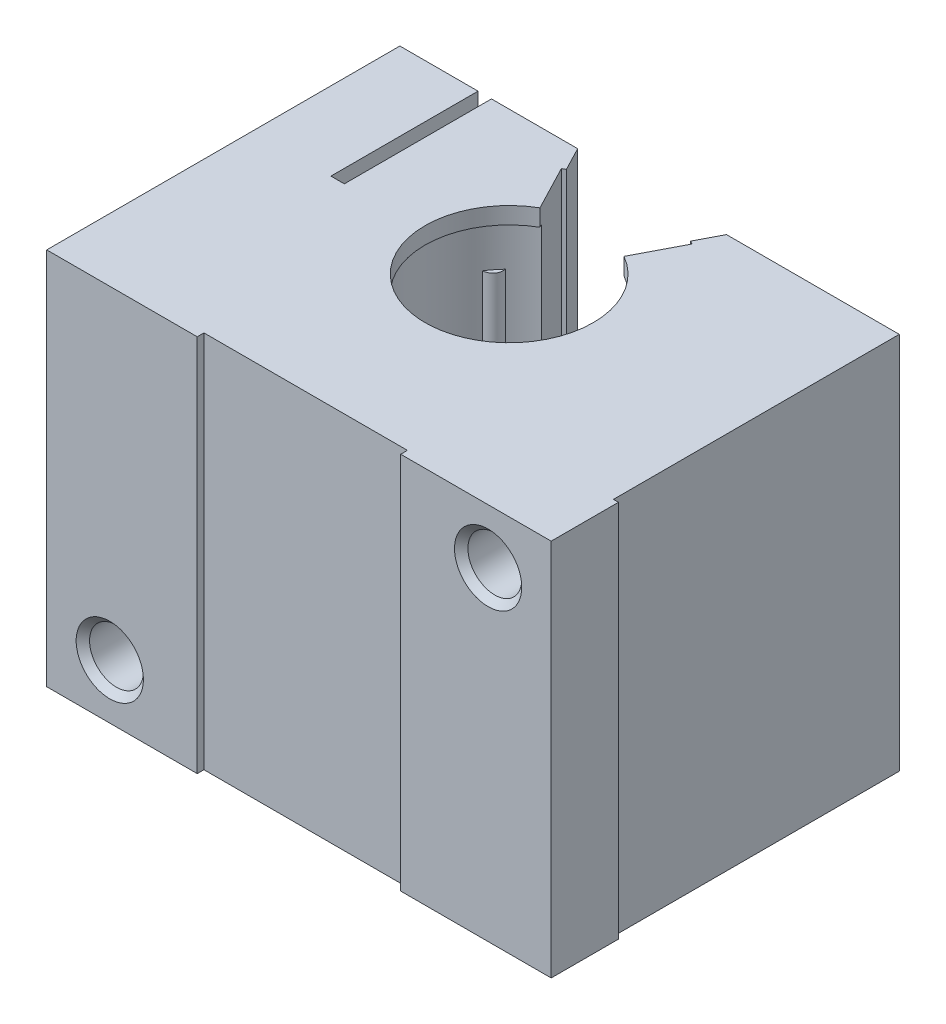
ISO-10303-21;
HEADER;
FILE_DESCRIPTION(('STEP AP214'),'2;1');
FILE_NAME('part.step','',(''),(''),'','','');
FILE_SCHEMA(('AUTOMOTIVE_DESIGN { 1 0 10303 214 1 1 1 1 }'));
ENDSEC;
DATA;
#1=APPLICATION_CONTEXT('core data for automotive mechanical design processes');
#2=APPLICATION_PROTOCOL_DEFINITION('international standard','automotive_design',2000,#1);
#3=PRODUCT_CONTEXT('',#1,'mechanical');
#4=PRODUCT('Part','Part','',(#3));
#5=PRODUCT_RELATED_PRODUCT_CATEGORY('part','',(#4));
#6=PRODUCT_DEFINITION_FORMATION('','',#4);
#7=PRODUCT_DEFINITION_CONTEXT('part definition',#1,'design');
#8=PRODUCT_DEFINITION('design','',#6,#7);
#9=PRODUCT_DEFINITION_SHAPE('','',#8);
#10=(LENGTH_UNIT() NAMED_UNIT(*) SI_UNIT(.MILLI.,.METRE.));
#11=(NAMED_UNIT(*) PLANE_ANGLE_UNIT() SI_UNIT($,.RADIAN.));
#12=(NAMED_UNIT(*) SI_UNIT($,.STERADIAN.) SOLID_ANGLE_UNIT());
#13=UNCERTAINTY_MEASURE_WITH_UNIT(LENGTH_MEASURE(1.E-05),#10,'distance_accuracy_value','');
#14=(GEOMETRIC_REPRESENTATION_CONTEXT(3) GLOBAL_UNCERTAINTY_ASSIGNED_CONTEXT((#13)) GLOBAL_UNIT_ASSIGNED_CONTEXT((#10,
#11,#12)) REPRESENTATION_CONTEXT('',''));
#15=CARTESIAN_POINT('',(0.,0.,0.));
#16=DIRECTION('',(0.,0.,1.));
#17=DIRECTION('',(1.,0.,0.));
#18=AXIS2_PLACEMENT_3D('',#15,#16,#17);
#19=CARTESIAN_POINT('',(-20.7741016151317,0.,-1.70530256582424E-10));
#20=DIRECTION('',(-1.,0.,0.));
#21=DIRECTION('',(0.,0.,1.));
#22=AXIS2_PLACEMENT_3D('',#19,#20,#21);
#23=CONICAL_SURFACE('',#22,0.,1.30899693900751);
#24=CARTESIAN_POINT('',(-21.3099999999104,0.,-1.70530256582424E-10));
#25=DIRECTION('',(-1.,0.,0.));
#26=DIRECTION('',(0.,0.,1.));
#27=AXIS2_PLACEMENT_3D('',#24,#25,#26);
#28=CIRCLE('',#27,1.99999999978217);
#29=CARTESIAN_POINT('',(-21.3099999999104,0.,1.99999999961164));
#30=VERTEX_POINT('',#29);
#31=EDGE_CURVE('E536',#30,#30,#28,.F.);
#32=ORIENTED_EDGE('',*,*,#31,.F.);
#33=EDGE_LOOP('',(#32));
#34=FACE_BOUND('',#33,.T.);
#35=CARTESIAN_POINT('',(-20.7741016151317,0.,-7.105427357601E-10));
#36=VERTEX_POINT('',#35);
#37=VERTEX_LOOP('',#36);
#38=FACE_BOUND('',#37,.T.);
#39=ADVANCED_FACE('F19',(#34,#38),#23,.F.);
#40=CARTESIAN_POINT('',(-27.4333333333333,0.,-11.));
#41=DIRECTION('',(-1.,0.,0.));
#42=DIRECTION('',(0.,-1.,0.));
#43=AXIS2_PLACEMENT_3D('',#40,#41,#42);
#44=PLANE('',#43);
#45=DIRECTION('',(0.,0.5,0.866025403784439));
#46=VECTOR('',#45,1.);
#47=CARTESIAN_POINT('',(-27.4333333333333,1.44337567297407,-11.));
#48=LINE('',#47,#46);
#49=CARTESIAN_POINT('',(-27.4333333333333,1.44337567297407,-11.));
#50=VERTEX_POINT('',#49);
#51=CARTESIAN_POINT('',(-27.4333333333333,0.721687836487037,-12.25));
#52=VERTEX_POINT('',#51);
#53=EDGE_CURVE('E524',#50,#52,#48,.F.);
#54=ORIENTED_EDGE('',*,*,#53,.T.);
#55=DIRECTION('',(0.,1.,0.));
#56=VECTOR('',#55,1.);
#57=CARTESIAN_POINT('',(-27.4333333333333,0.721687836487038,-12.25));
#58=LINE('',#57,#56);
#59=CARTESIAN_POINT('',(-27.4333333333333,-0.721687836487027,-12.25));
#60=VERTEX_POINT('',#59);
#61=EDGE_CURVE('E529',#52,#60,#58,.F.);
#62=ORIENTED_EDGE('',*,*,#61,.T.);
#63=DIRECTION('',(0.,0.5,-0.866025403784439));
#64=VECTOR('',#63,1.);
#65=CARTESIAN_POINT('',(-27.4333333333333,-0.721687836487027,-12.25));
#66=LINE('',#65,#64);
#67=CARTESIAN_POINT('',(-27.4333333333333,-1.44337567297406,-11.));
#68=VERTEX_POINT('',#67);
#69=EDGE_CURVE('E534',#60,#68,#66,.F.);
#70=ORIENTED_EDGE('',*,*,#69,.T.);
#71=DIRECTION('',(0.,-0.5,-0.866025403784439));
#72=VECTOR('',#71,1.);
#73=CARTESIAN_POINT('',(-27.4333333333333,-1.44337567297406,-11.));
#74=LINE('',#73,#72);
#75=CARTESIAN_POINT('',(-27.4333333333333,-0.721687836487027,-9.75));
#76=VERTEX_POINT('',#75);
#77=EDGE_CURVE('E506',#68,#76,#74,.F.);
#78=ORIENTED_EDGE('',*,*,#77,.T.);
#79=DIRECTION('',(0.,-1.,0.));
#80=VECTOR('',#79,1.);
#81=CARTESIAN_POINT('',(-27.4333333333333,-0.721687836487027,-9.75));
#82=LINE('',#81,#80);
#83=CARTESIAN_POINT('',(-27.4333333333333,0.721687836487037,-9.75));
#84=VERTEX_POINT('',#83);
#85=EDGE_CURVE('E514',#76,#84,#82,.F.);
#86=ORIENTED_EDGE('',*,*,#85,.T.);
#87=DIRECTION('',(0.,-0.5,0.866025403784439));
#88=VECTOR('',#87,1.);
#89=CARTESIAN_POINT('',(-27.4333333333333,0.721687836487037,-9.75));
#90=LINE('',#89,#88);
#91=EDGE_CURVE('E519',#84,#50,#90,.F.);
#92=ORIENTED_EDGE('',*,*,#91,.T.);
#93=EDGE_LOOP('',(#54,#62,#70,#78,#86,#92));
#94=FACE_BOUND('',#93,.T.);
#95=ADVANCED_FACE('F1283',(#94),#44,.T.);
#96=CARTESIAN_POINT('',(-21.31,0.,2.44375));
#97=DIRECTION('',(-1.,0.,0.));
#98=DIRECTION('',(0.,-1.,0.));
#99=AXIS2_PLACEMENT_3D('',#96,#97,#98);
#100=PLANE('',#99);
#101=ORIENTED_EDGE('',*,*,#31,.T.);
#102=EDGE_LOOP('',(#101));
#103=FACE_BOUND('',#102,.T.);
#104=DIRECTION('',(0.,0.5,0.866025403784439));
#105=VECTOR('',#104,1.);
#106=CARTESIAN_POINT('',(-21.31,-1.44337567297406,2.5));
#107=LINE('',#106,#105);
#108=CARTESIAN_POINT('',(-21.31,-2.88675134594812,0.));
#109=VERTEX_POINT('',#108);
#110=CARTESIAN_POINT('',(-21.31,-1.44337567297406,2.5));
#111=VERTEX_POINT('',#110);
#112=EDGE_CURVE('E498',#109,#111,#107,.T.);
#113=ORIENTED_EDGE('',*,*,#112,.T.);
#114=DIRECTION('',(0.,1.,0.));
#115=VECTOR('',#114,1.);
#116=CARTESIAN_POINT('',(-21.31,1.44337567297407,2.5));
#117=LINE('',#116,#115);
#118=CARTESIAN_POINT('',(-21.31,1.44337567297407,2.5));
#119=VERTEX_POINT('',#118);
#120=EDGE_CURVE('E502',#111,#119,#117,.T.);
#121=ORIENTED_EDGE('',*,*,#120,.T.);
#122=DIRECTION('',(0.,0.5,-0.866025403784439));
#123=VECTOR('',#122,1.);
#124=CARTESIAN_POINT('',(-21.31,2.88675134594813,0.));
#125=LINE('',#124,#123);
#126=CARTESIAN_POINT('',(-21.31,2.88675134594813,0.));
#127=VERTEX_POINT('',#126);
#128=EDGE_CURVE('E504',#119,#127,#125,.T.);
#129=ORIENTED_EDGE('',*,*,#128,.T.);
#130=DIRECTION('',(0.,-0.5,-0.866025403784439));
#131=VECTOR('',#130,1.);
#132=CARTESIAN_POINT('',(-21.31,1.44337567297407,-2.5));
#133=LINE('',#132,#131);
#134=CARTESIAN_POINT('',(-21.31,1.44337567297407,-2.5));
#135=VERTEX_POINT('',#134);
#136=EDGE_CURVE('E483',#127,#135,#133,.T.);
#137=ORIENTED_EDGE('',*,*,#136,.T.);
#138=DIRECTION('',(0.,-1.,0.));
#139=VECTOR('',#138,1.);
#140=CARTESIAN_POINT('',(-21.31,-1.44337567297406,-2.5));
#141=LINE('',#140,#139);
#142=CARTESIAN_POINT('',(-21.31,-1.44337567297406,-2.5));
#143=VERTEX_POINT('',#142);
#144=EDGE_CURVE('E490',#135,#143,#141,.T.);
#145=ORIENTED_EDGE('',*,*,#144,.T.);
#146=DIRECTION('',(0.,-0.5,0.866025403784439));
#147=VECTOR('',#146,1.);
#148=CARTESIAN_POINT('',(-21.31,-2.88675134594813,0.));
#149=LINE('',#148,#147);
#150=EDGE_CURVE('E494',#143,#109,#149,.T.);
#151=ORIENTED_EDGE('',*,*,#150,.T.);
#152=EDGE_LOOP('',(#113,#121,#129,#137,#145,#151));
#153=FACE_BOUND('',#152,.T.);
#154=ADVANCED_FACE('F1285',(#103,#153),#100,.T.);
#155=CARTESIAN_POINT('',(-29.1,-0.721687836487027,-12.25));
#156=DIRECTION('',(0.,-0.866025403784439,-0.5));
#157=DIRECTION('',(0.,0.5,-0.866025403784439));
#158=AXIS2_PLACEMENT_3D('',#155,#156,#157);
#159=PLANE('',#158);
#160=DIRECTION('',(-1.,0.,0.));
#161=VECTOR('',#160,1.);
#162=CARTESIAN_POINT('',(-29.1,-0.721687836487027,-12.25));
#163=LINE('',#162,#161);
#164=CARTESIAN_POINT('',(-29.1,-0.721687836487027,-12.25));
#165=VERTEX_POINT('',#164);
#166=EDGE_CURVE('E532',#60,#165,#163,.T.);
#167=ORIENTED_EDGE('',*,*,#166,.T.);
#168=DIRECTION('',(0.,0.5,-0.866025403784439));
#169=VECTOR('',#168,1.);
#170=CARTESIAN_POINT('',(-29.1,-1.44337567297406,-11.));
#171=LINE('',#170,#169);
#172=CARTESIAN_POINT('',(-29.1,-1.44337567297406,-11.));
#173=VERTEX_POINT('',#172);
#174=EDGE_CURVE('E478',#173,#165,#171,.T.);
#175=ORIENTED_EDGE('',*,*,#174,.F.);
#176=DIRECTION('',(1.,0.,0.));
#177=VECTOR('',#176,1.);
#178=CARTESIAN_POINT('',(-29.1,-1.44337567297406,-11.));
#179=LINE('',#178,#177);
#180=EDGE_CURVE('E509',#173,#68,#179,.T.);
#181=ORIENTED_EDGE('',*,*,#180,.T.);
#182=ORIENTED_EDGE('',*,*,#69,.F.);
#183=EDGE_LOOP('',(#167,#175,#181,#182));
#184=FACE_BOUND('',#183,.T.);
#185=ADVANCED_FACE('F1270',(#184),#159,.F.);
#186=CARTESIAN_POINT('',(-29.1,0.721687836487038,-12.25));
#187=DIRECTION('',(0.,0.,-1.));
#188=DIRECTION('',(-1.,0.,0.));
#189=AXIS2_PLACEMENT_3D('',#186,#187,#188);
#190=PLANE('',#189);
#191=DIRECTION('',(1.,0.,0.));
#192=VECTOR('',#191,1.);
#193=CARTESIAN_POINT('',(-29.1,0.721687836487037,-12.25));
#194=LINE('',#193,#192);
#195=CARTESIAN_POINT('',(-29.1,0.721687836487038,-12.25));
#196=VERTEX_POINT('',#195);
#197=EDGE_CURVE('E527',#52,#196,#194,.F.);
#198=ORIENTED_EDGE('',*,*,#197,.T.);
#199=DIRECTION('',(0.,-1.,0.));
#200=VECTOR('',#199,1.);
#201=CARTESIAN_POINT('',(-29.1,0.,-12.25));
#202=LINE('',#201,#200);
#203=EDGE_CURVE('E475',#165,#196,#202,.F.);
#204=ORIENTED_EDGE('',*,*,#203,.F.);
#205=ORIENTED_EDGE('',*,*,#166,.F.);
#206=ORIENTED_EDGE('',*,*,#61,.F.);
#207=EDGE_LOOP('',(#198,#204,#205,#206));
#208=FACE_BOUND('',#207,.T.);
#209=ADVANCED_FACE('F1275',(#208),#190,.F.);
#210=CARTESIAN_POINT('',(-29.1,1.44337567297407,-11.));
#211=DIRECTION('',(0.,0.866025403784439,-0.5));
#212=DIRECTION('',(0.,0.5,0.866025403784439));
#213=AXIS2_PLACEMENT_3D('',#210,#211,#212);
#214=PLANE('',#213);
#215=DIRECTION('',(1.,0.,0.));
#216=VECTOR('',#215,1.);
#217=CARTESIAN_POINT('',(-29.1,1.44337567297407,-11.));
#218=LINE('',#217,#216);
#219=CARTESIAN_POINT('',(-29.1,1.44337567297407,-11.));
#220=VERTEX_POINT('',#219);
#221=EDGE_CURVE('E522',#50,#220,#218,.F.);
#222=ORIENTED_EDGE('',*,*,#221,.T.);
#223=DIRECTION('',(0.,0.5,0.866025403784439));
#224=VECTOR('',#223,1.);
#225=CARTESIAN_POINT('',(-29.1,0.721687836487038,-12.25));
#226=LINE('',#225,#224);
#227=EDGE_CURVE('E472',#196,#220,#226,.T.);
#228=ORIENTED_EDGE('',*,*,#227,.F.);
#229=ORIENTED_EDGE('',*,*,#197,.F.);
#230=ORIENTED_EDGE('',*,*,#53,.F.);
#231=EDGE_LOOP('',(#222,#228,#229,#230));
#232=FACE_BOUND('',#231,.T.);
#233=ADVANCED_FACE('F1278',(#232),#214,.F.);
#234=CARTESIAN_POINT('',(-29.1,0.721687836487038,-9.75));
#235=DIRECTION('',(0.,0.866025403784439,0.5));
#236=DIRECTION('',(0.,-0.5,0.866025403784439));
#237=AXIS2_PLACEMENT_3D('',#234,#235,#236);
#238=PLANE('',#237);
#239=DIRECTION('',(1.,0.,0.));
#240=VECTOR('',#239,1.);
#241=CARTESIAN_POINT('',(-29.1,0.721687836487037,-9.75));
#242=LINE('',#241,#240);
#243=CARTESIAN_POINT('',(-29.1,0.721687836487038,-9.75));
#244=VERTEX_POINT('',#243);
#245=EDGE_CURVE('E517',#84,#244,#242,.F.);
#246=ORIENTED_EDGE('',*,*,#245,.T.);
#247=DIRECTION('',(0.,-0.5,0.866025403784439));
#248=VECTOR('',#247,1.);
#249=CARTESIAN_POINT('',(-29.1,1.44337567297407,-11.));
#250=LINE('',#249,#248);
#251=EDGE_CURVE('E469',#220,#244,#250,.T.);
#252=ORIENTED_EDGE('',*,*,#251,.F.);
#253=ORIENTED_EDGE('',*,*,#221,.F.);
#254=ORIENTED_EDGE('',*,*,#91,.F.);
#255=EDGE_LOOP('',(#246,#252,#253,#254));
#256=FACE_BOUND('',#255,.T.);
#257=ADVANCED_FACE('F1281',(#256),#238,.F.);
#258=CARTESIAN_POINT('',(-29.1,-0.721687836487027,-9.75));
#259=DIRECTION('',(0.,0.,1.));
#260=DIRECTION('',(0.,-1.,0.));
#261=AXIS2_PLACEMENT_3D('',#258,#259,#260);
#262=PLANE('',#261);
#263=DIRECTION('',(1.,0.,0.));
#264=VECTOR('',#263,1.);
#265=CARTESIAN_POINT('',(-29.1,-0.721687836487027,-9.75));
#266=LINE('',#265,#264);
#267=CARTESIAN_POINT('',(-29.1,-0.721687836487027,-9.75));
#268=VERTEX_POINT('',#267);
#269=EDGE_CURVE('E512',#76,#268,#266,.F.);
#270=ORIENTED_EDGE('',*,*,#269,.T.);
#271=DIRECTION('',(0.,-1.,0.));
#272=VECTOR('',#271,1.);
#273=CARTESIAN_POINT('',(-29.1,0.,-9.75));
#274=LINE('',#273,#272);
#275=EDGE_CURVE('E466',#244,#268,#274,.T.);
#276=ORIENTED_EDGE('',*,*,#275,.F.);
#277=ORIENTED_EDGE('',*,*,#245,.F.);
#278=ORIENTED_EDGE('',*,*,#85,.F.);
#279=EDGE_LOOP('',(#270,#276,#277,#278));
#280=FACE_BOUND('',#279,.T.);
#281=ADVANCED_FACE('F1263',(#280),#262,.F.);
#282=CARTESIAN_POINT('',(-29.1,-1.44337567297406,-11.));
#283=DIRECTION('',(0.,-0.866025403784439,0.5));
#284=DIRECTION('',(0.,-0.5,-0.866025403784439));
#285=AXIS2_PLACEMENT_3D('',#282,#283,#284);
#286=PLANE('',#285);
#287=ORIENTED_EDGE('',*,*,#180,.F.);
#288=DIRECTION('',(0.,-0.5,-0.866025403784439));
#289=VECTOR('',#288,1.);
#290=CARTESIAN_POINT('',(-29.1,-0.721687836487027,-9.75));
#291=LINE('',#290,#289);
#292=EDGE_CURVE('E460',#268,#173,#291,.T.);
#293=ORIENTED_EDGE('',*,*,#292,.F.);
#294=ORIENTED_EDGE('',*,*,#269,.F.);
#295=ORIENTED_EDGE('',*,*,#77,.F.);
#296=EDGE_LOOP('',(#287,#293,#294,#295));
#297=FACE_BOUND('',#296,.T.);
#298=ADVANCED_FACE('F1268',(#297),#286,.F.);
#299=CARTESIAN_POINT('',(-22.82,2.88675134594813,0.));
#300=DIRECTION('',(0.,-0.866025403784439,-0.5));
#301=DIRECTION('',(0.,0.5,-0.866025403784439));
#302=AXIS2_PLACEMENT_3D('',#299,#300,#301);
#303=PLANE('',#302);
#304=DIRECTION('',(1.,0.,0.));
#305=VECTOR('',#304,1.);
#306=CARTESIAN_POINT('',(-22.82,2.88675134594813,0.));
#307=LINE('',#306,#305);
#308=CARTESIAN_POINT('',(-19.81,2.88675134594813,0.));
#309=VERTEX_POINT('',#308);
#310=EDGE_CURVE('E485',#309,#127,#307,.F.);
#311=ORIENTED_EDGE('',*,*,#310,.T.);
#312=ORIENTED_EDGE('',*,*,#128,.F.);
#313=DIRECTION('',(-1.,0.,0.));
#314=VECTOR('',#313,1.);
#315=CARTESIAN_POINT('',(-22.82,1.44337567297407,2.5));
#316=LINE('',#315,#314);
#317=CARTESIAN_POINT('',(-19.81,1.44337567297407,2.5));
#318=VERTEX_POINT('',#317);
#319=EDGE_CURVE('E500',#119,#318,#316,.F.);
#320=ORIENTED_EDGE('',*,*,#319,.T.);
#321=DIRECTION('',(0.,-0.5,0.866025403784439));
#322=VECTOR('',#321,1.);
#323=CARTESIAN_POINT('',(-19.81,2.88675134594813,0.));
#324=LINE('',#323,#322);
#325=EDGE_CURVE('E457',#309,#318,#324,.T.);
#326=ORIENTED_EDGE('',*,*,#325,.F.);
#327=EDGE_LOOP('',(#311,#312,#320,#326));
#328=FACE_BOUND('',#327,.T.);
#329=ADVANCED_FACE('F1306',(#328),#303,.F.);
#330=CARTESIAN_POINT('',(-22.82,1.44337567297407,2.5));
#331=DIRECTION('',(0.,0.,-1.));
#332=DIRECTION('',(-1.,0.,0.));
#333=AXIS2_PLACEMENT_3D('',#330,#331,#332);
#334=PLANE('',#333);
#335=ORIENTED_EDGE('',*,*,#319,.F.);
#336=ORIENTED_EDGE('',*,*,#120,.F.);
#337=DIRECTION('',(1.,0.,0.));
#338=VECTOR('',#337,1.);
#339=CARTESIAN_POINT('',(-22.82,-1.44337567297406,2.5));
#340=LINE('',#339,#338);
#341=CARTESIAN_POINT('',(-19.81,-1.44337567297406,2.5));
#342=VERTEX_POINT('',#341);
#343=EDGE_CURVE('E496',#111,#342,#340,.T.);
#344=ORIENTED_EDGE('',*,*,#343,.T.);
#345=DIRECTION('',(0.,1.,0.));
#346=VECTOR('',#345,1.);
#347=CARTESIAN_POINT('',(-19.81,0.,2.5));
#348=LINE('',#347,#346);
#349=EDGE_CURVE('E454',#318,#342,#348,.F.);
#350=ORIENTED_EDGE('',*,*,#349,.F.);
#351=EDGE_LOOP('',(#335,#336,#344,#350));
#352=FACE_BOUND('',#351,.T.);
#353=ADVANCED_FACE('F1309',(#352),#334,.F.);
#354=CARTESIAN_POINT('',(-22.82,-1.44337567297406,2.5));
#355=DIRECTION('',(0.,0.866025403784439,-0.5));
#356=DIRECTION('',(0.,0.5,0.866025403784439));
#357=AXIS2_PLACEMENT_3D('',#354,#355,#356);
#358=PLANE('',#357);
#359=ORIENTED_EDGE('',*,*,#343,.F.);
#360=ORIENTED_EDGE('',*,*,#112,.F.);
#361=DIRECTION('',(1.,0.,0.));
#362=VECTOR('',#361,1.);
#363=CARTESIAN_POINT('',(-22.82,-2.88675134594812,0.));
#364=LINE('',#363,#362);
#365=CARTESIAN_POINT('',(-19.81,-2.88675134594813,0.));
#366=VERTEX_POINT('',#365);
#367=EDGE_CURVE('E492',#109,#366,#364,.T.);
#368=ORIENTED_EDGE('',*,*,#367,.T.);
#369=DIRECTION('',(0.,-0.5,-0.866025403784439));
#370=VECTOR('',#369,1.);
#371=CARTESIAN_POINT('',(-19.81,-1.44337567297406,2.5));
#372=LINE('',#371,#370);
#373=EDGE_CURVE('E451',#342,#366,#372,.T.);
#374=ORIENTED_EDGE('',*,*,#373,.F.);
#375=EDGE_LOOP('',(#359,#360,#368,#374));
#376=FACE_BOUND('',#375,.T.);
#377=ADVANCED_FACE('F1313',(#376),#358,.F.);
#378=CARTESIAN_POINT('',(-22.82,-2.88675134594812,0.));
#379=DIRECTION('',(0.,0.866025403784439,0.5));
#380=DIRECTION('',(0.,-0.5,0.866025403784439));
#381=AXIS2_PLACEMENT_3D('',#378,#379,#380);
#382=PLANE('',#381);
#383=ORIENTED_EDGE('',*,*,#367,.F.);
#384=ORIENTED_EDGE('',*,*,#150,.F.);
#385=DIRECTION('',(1.,0.,0.));
#386=VECTOR('',#385,1.);
#387=CARTESIAN_POINT('',(-22.82,-1.44337567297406,-2.5));
#388=LINE('',#387,#386);
#389=CARTESIAN_POINT('',(-19.81,-1.44337567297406,-2.5));
#390=VERTEX_POINT('',#389);
#391=EDGE_CURVE('E488',#143,#390,#388,.T.);
#392=ORIENTED_EDGE('',*,*,#391,.T.);
#393=DIRECTION('',(0.,0.5,-0.866025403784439));
#394=VECTOR('',#393,1.);
#395=CARTESIAN_POINT('',(-19.81,-2.88675134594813,0.));
#396=LINE('',#395,#394);
#397=EDGE_CURVE('E448',#366,#390,#396,.T.);
#398=ORIENTED_EDGE('',*,*,#397,.F.);
#399=EDGE_LOOP('',(#383,#384,#392,#398));
#400=FACE_BOUND('',#399,.T.);
#401=ADVANCED_FACE('F1317',(#400),#382,.F.);
#402=CARTESIAN_POINT('',(-22.82,-1.44337567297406,-2.5));
#403=DIRECTION('',(0.,0.,1.));
#404=DIRECTION('',(0.,-1.,0.));
#405=AXIS2_PLACEMENT_3D('',#402,#403,#404);
#406=PLANE('',#405);
#407=ORIENTED_EDGE('',*,*,#391,.F.);
#408=ORIENTED_EDGE('',*,*,#144,.F.);
#409=DIRECTION('',(1.,0.,0.));
#410=VECTOR('',#409,1.);
#411=CARTESIAN_POINT('',(-22.82,1.44337567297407,-2.5));
#412=LINE('',#411,#410);
#413=CARTESIAN_POINT('',(-19.81,1.44337567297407,-2.5));
#414=VERTEX_POINT('',#413);
#415=EDGE_CURVE('E481',#135,#414,#412,.T.);
#416=ORIENTED_EDGE('',*,*,#415,.T.);
#417=DIRECTION('',(0.,1.,0.));
#418=VECTOR('',#417,1.);
#419=CARTESIAN_POINT('',(-19.81,0.,-2.5));
#420=LINE('',#419,#418);
#421=EDGE_CURVE('E445',#390,#414,#420,.T.);
#422=ORIENTED_EDGE('',*,*,#421,.F.);
#423=EDGE_LOOP('',(#407,#408,#416,#422));
#424=FACE_BOUND('',#423,.T.);
#425=ADVANCED_FACE('F1321',(#424),#406,.F.);
#426=CARTESIAN_POINT('',(-22.82,1.44337567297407,-2.5));
#427=DIRECTION('',(0.,-0.866025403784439,0.5));
#428=DIRECTION('',(0.,-0.5,-0.866025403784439));
#429=AXIS2_PLACEMENT_3D('',#426,#427,#428);
#430=PLANE('',#429);
#431=ORIENTED_EDGE('',*,*,#415,.F.);
#432=ORIENTED_EDGE('',*,*,#136,.F.);
#433=ORIENTED_EDGE('',*,*,#310,.F.);
#434=DIRECTION('',(0.,0.5,0.866025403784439));
#435=VECTOR('',#434,1.);
#436=CARTESIAN_POINT('',(-19.81,1.44337567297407,-2.5));
#437=LINE('',#436,#435);
#438=EDGE_CURVE('E441',#414,#309,#437,.T.);
#439=ORIENTED_EDGE('',*,*,#438,.F.);
#440=EDGE_LOOP('',(#431,#432,#433,#439));
#441=FACE_BOUND('',#440,.T.);
#442=ADVANCED_FACE('F1256',(#441),#430,.F.);
#443=CARTESIAN_POINT('',(-29.1,0.,-9.75));
#444=DIRECTION('',(-1.,0.,0.));
#445=DIRECTION('',(0.,-1.,0.));
#446=AXIS2_PLACEMENT_3D('',#443,#444,#445);
#447=PLANE('',#446);
#448=CARTESIAN_POINT('',(-29.1,0.,-11.));
#449=DIRECTION('',(-1.,0.,0.));
#450=DIRECTION('',(0.,-1.,0.));
#451=AXIS2_PLACEMENT_3D('',#448,#449,#450);
#452=CIRCLE('',#451,2.);
#453=CARTESIAN_POINT('',(-29.1,-1.99999999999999,-11.));
#454=VERTEX_POINT('',#453);
#455=EDGE_CURVE('E708',#454,#454,#452,.T.);
#456=ORIENTED_EDGE('',*,*,#455,.T.);
#457=EDGE_LOOP('',(#456));
#458=FACE_BOUND('',#457,.T.);
#459=ORIENTED_EDGE('',*,*,#275,.T.);
#460=ORIENTED_EDGE('',*,*,#292,.T.);
#461=ORIENTED_EDGE('',*,*,#174,.T.);
#462=ORIENTED_EDGE('',*,*,#203,.T.);
#463=ORIENTED_EDGE('',*,*,#227,.T.);
#464=ORIENTED_EDGE('',*,*,#251,.T.);
#465=EDGE_LOOP('',(#459,#460,#461,#462,#463,#464));
#466=FACE_BOUND('',#465,.T.);
#467=ADVANCED_FACE('F1252',(#458,#466),#447,.T.);
#468=CARTESIAN_POINT('',(-22.5,-16.,4.));
#469=DIRECTION('',(0.,0.,1.));
#470=DIRECTION('',(1.,0.,0.));
#471=AXIS2_PLACEMENT_3D('',#468,#469,#470);
#472=CYLINDRICAL_SURFACE('',#471,3.3);
#473=CARTESIAN_POINT('',(-22.5,-16.,7.));
#474=DIRECTION('',(0.,0.,1.));
#475=DIRECTION('',(1.,0.,0.));
#476=AXIS2_PLACEMENT_3D('',#473,#474,#475);
#477=CIRCLE('',#476,3.3);
#478=CARTESIAN_POINT('',(-19.2,-16.,7.));
#479=VERTEX_POINT('',#478);
#480=EDGE_CURVE('E711',#479,#479,#477,.T.);
#481=ORIENTED_EDGE('',*,*,#480,.T.);
#482=EDGE_LOOP('',(#481));
#483=FACE_BOUND('',#482,.T.);
#484=CARTESIAN_POINT('',(-22.5,-16.,1.));
#485=DIRECTION('',(0.,0.,1.));
#486=DIRECTION('',(1.,0.,0.));
#487=AXIS2_PLACEMENT_3D('',#484,#485,#486);
#488=CIRCLE('',#487,3.3);
#489=CARTESIAN_POINT('',(-19.2,-16.,1.));
#490=VERTEX_POINT('',#489);
#491=EDGE_CURVE('E463',#490,#490,#488,.F.);
#492=ORIENTED_EDGE('',*,*,#491,.T.);
#493=EDGE_LOOP('',(#492));
#494=FACE_BOUND('',#493,.T.);
#495=ADVANCED_FACE('F1255',(#483,#494),#472,.F.);
#496=CARTESIAN_POINT('',(-19.81,0.,2.44375));
#497=DIRECTION('',(1.,0.,0.));
#498=DIRECTION('',(0.,1.,0.));
#499=AXIS2_PLACEMENT_3D('',#496,#497,#498);
#500=PLANE('',#499);
#501=CARTESIAN_POINT('',(-19.81,0.,0.));
#502=DIRECTION('',(-1.,0.,0.));
#503=DIRECTION('',(0.,-1.,0.));
#504=AXIS2_PLACEMENT_3D('',#501,#502,#503);
#505=CIRCLE('',#504,2.);
#506=CARTESIAN_POINT('',(-19.81,-2.,0.));
#507=VERTEX_POINT('',#506);
#508=EDGE_CURVE('E409',#507,#507,#505,.F.);
#509=ORIENTED_EDGE('',*,*,#508,.F.);
#510=EDGE_LOOP('',(#509));
#511=FACE_BOUND('',#510,.T.);
#512=ORIENTED_EDGE('',*,*,#421,.T.);
#513=ORIENTED_EDGE('',*,*,#438,.T.);
#514=ORIENTED_EDGE('',*,*,#325,.T.);
#515=ORIENTED_EDGE('',*,*,#349,.T.);
#516=ORIENTED_EDGE('',*,*,#373,.T.);
#517=ORIENTED_EDGE('',*,*,#397,.T.);
#518=EDGE_LOOP('',(#512,#513,#514,#515,#516,#517));
#519=FACE_BOUND('',#518,.T.);
#520=ADVANCED_FACE('F1331',(#511,#519),#500,.T.);
#521=CARTESIAN_POINT('',(-13.61,0.,0.750000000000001));
#522=DIRECTION('',(1.,0.,0.));
#523=DIRECTION('',(0.,1.,0.));
#524=AXIS2_PLACEMENT_3D('',#521,#522,#523);
#525=PLANE('',#524);
#526=CARTESIAN_POINT('',(-13.61,0.,0.));
#527=DIRECTION('',(-1.,0.,0.));
#528=DIRECTION('',(0.,-1.,0.));
#529=AXIS2_PLACEMENT_3D('',#526,#527,#528);
#530=CIRCLE('',#529,1.5);
#531=CARTESIAN_POINT('',(-13.61,-1.5,0.));
#532=VERTEX_POINT('',#531);
#533=EDGE_CURVE('E676',#532,#532,#530,.F.);
#534=ORIENTED_EDGE('',*,*,#533,.T.);
#535=EDGE_LOOP('',(#534));
#536=FACE_BOUND('',#535,.T.);
#537=ADVANCED_FACE('F1335',(#536),#525,.T.);
#538=CARTESIAN_POINT('',(22.5,16.,4.));
#539=DIRECTION('',(0.,0.,1.));
#540=DIRECTION('',(1.,0.,0.));
#541=AXIS2_PLACEMENT_3D('',#538,#539,#540);
#542=CYLINDRICAL_SURFACE('',#541,3.3);
#543=CARTESIAN_POINT('',(22.5,16.,7.));
#544=DIRECTION('',(0.,0.,1.));
#545=DIRECTION('',(1.,0.,0.));
#546=AXIS2_PLACEMENT_3D('',#543,#544,#545);
#547=CIRCLE('',#546,3.3);
#548=CARTESIAN_POINT('',(25.8,16.,7.));
#549=VERTEX_POINT('',#548);
#550=EDGE_CURVE('E444',#549,#549,#547,.T.);
#551=ORIENTED_EDGE('',*,*,#550,.T.);
#552=EDGE_LOOP('',(#551));
#553=FACE_BOUND('',#552,.T.);
#554=CARTESIAN_POINT('',(22.5,16.,0.999999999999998));
#555=DIRECTION('',(0.,0.,1.));
#556=DIRECTION('',(1.,0.,0.));
#557=AXIS2_PLACEMENT_3D('',#554,#555,#556);
#558=CIRCLE('',#557,3.3);
#559=CARTESIAN_POINT('',(25.8,16.,0.999999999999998));
#560=VERTEX_POINT('',#559);
#561=EDGE_CURVE('E672',#560,#560,#558,.F.);
#562=ORIENTED_EDGE('',*,*,#561,.T.);
#563=EDGE_LOOP('',(#562));
#564=FACE_BOUND('',#563,.T.);
#565=ADVANCED_FACE('F1339',(#553,#564),#542,.F.);
#566=CARTESIAN_POINT('',(25.751,16.,7.));
#567=DIRECTION('',(0.,0.,1.));
#568=DIRECTION('',(0.,-1.,0.));
#569=AXIS2_PLACEMENT_3D('',#566,#567,#568);
#570=PLANE('',#569);
#571=ORIENTED_EDGE('',*,*,#550,.F.);
#572=EDGE_LOOP('',(#571));
#573=FACE_BOUND('',#572,.T.);
#574=CARTESIAN_POINT('',(22.5,16.,7.));
#575=DIRECTION('',(0.,0.,1.));
#576=DIRECTION('',(1.,0.,0.));
#577=AXIS2_PLACEMENT_3D('',#574,#575,#576);
#578=CIRCLE('',#577,3.202);
#579=CARTESIAN_POINT('',(25.702,16.,7.));
#580=VERTEX_POINT('',#579);
#581=EDGE_CURVE('E669',#580,#580,#578,.T.);
#582=ORIENTED_EDGE('',*,*,#581,.T.);
#583=EDGE_LOOP('',(#582));
#584=FACE_BOUND('',#583,.T.);
#585=ADVANCED_FACE('F1343',(#573,#584),#570,.F.);
#586=CARTESIAN_POINT('',(-19.249,-16.,7.));
#587=DIRECTION('',(0.,0.,1.));
#588=DIRECTION('',(0.,-1.,0.));
#589=AXIS2_PLACEMENT_3D('',#586,#587,#588);
#590=PLANE('',#589);
#591=ORIENTED_EDGE('',*,*,#480,.F.);
#592=EDGE_LOOP('',(#591));
#593=FACE_BOUND('',#592,.T.);
#594=CARTESIAN_POINT('',(-22.5,-16.,7.));
#595=DIRECTION('',(0.,0.,1.));
#596=DIRECTION('',(1.,0.,0.));
#597=AXIS2_PLACEMENT_3D('',#594,#595,#596);
#598=CIRCLE('',#597,3.202);
#599=CARTESIAN_POINT('',(-19.298,-16.,7.));
#600=VERTEX_POINT('',#599);
#601=EDGE_CURVE('E440',#600,#600,#598,.T.);
#602=ORIENTED_EDGE('',*,*,#601,.T.);
#603=EDGE_LOOP('',(#602));
#604=FACE_BOUND('',#603,.T.);
#605=ADVANCED_FACE('F1248',(#593,#604),#590,.F.);
#606=CARTESIAN_POINT('',(-25.3495,0.,-11.));
#607=DIRECTION('',(-1.,0.,0.));
#608=DIRECTION('',(0.,-1.,0.));
#609=AXIS2_PLACEMENT_3D('',#606,#607,#608);
#610=CYLINDRICAL_SURFACE('',#609,2.);
#611=CARTESIAN_POINT('',(-29.5000000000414,0.,-11.));
#612=DIRECTION('',(-1.,0.,0.));
#613=DIRECTION('',(0.,0.,1.));
#614=AXIS2_PLACEMENT_3D('',#611,#612,#613);
#615=CIRCLE('',#614,2.00000000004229);
#616=CARTESIAN_POINT('',(-29.5000000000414,0.,-8.99999999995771));
#617=VERTEX_POINT('',#616);
#618=EDGE_CURVE('E437',#617,#617,#615,.T.);
#619=ORIENTED_EDGE('',*,*,#618,.T.);
#620=EDGE_LOOP('',(#619));
#621=FACE_BOUND('',#620,.T.);
#622=ORIENTED_EDGE('',*,*,#455,.F.);
#623=EDGE_LOOP('',(#622));
#624=FACE_BOUND('',#623,.T.);
#625=ADVANCED_FACE('F1245',(#621,#624),#610,.F.);
#626=CARTESIAN_POINT('',(-19.8,0.,3.125));
#627=DIRECTION('',(1.,0.,0.));
#628=DIRECTION('',(0.,1.,0.));
#629=AXIS2_PLACEMENT_3D('',#626,#627,#628);
#630=PLANE('',#629);
#631=CARTESIAN_POINT('',(-19.8,0.,0.));
#632=DIRECTION('',(-1.,0.,0.));
#633=DIRECTION('',(0.,-1.,0.));
#634=AXIS2_PLACEMENT_3D('',#631,#632,#633);
#635=CIRCLE('',#634,2.);
#636=CARTESIAN_POINT('',(-19.8,-1.93649167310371,0.500000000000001));
#637=VERTEX_POINT('',#636);
#638=CARTESIAN_POINT('',(-19.8,1.93649167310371,0.500000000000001));
#639=VERTEX_POINT('',#638);
#640=EDGE_CURVE('E399',#637,#639,#635,.T.);
#641=ORIENTED_EDGE('',*,*,#640,.F.);
#642=DIRECTION('',(0.,1.,0.));
#643=VECTOR('',#642,1.);
#644=CARTESIAN_POINT('',(-19.8,-22.5,0.500000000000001));
#645=LINE('',#644,#643);
#646=CARTESIAN_POINT('',(-19.8,-4.22048575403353,0.500000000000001));
#647=VERTEX_POINT('',#646);
#648=EDGE_CURVE('E404',#647,#637,#645,.T.);
#649=ORIENTED_EDGE('',*,*,#648,.F.);
#650=CARTESIAN_POINT('',(-19.8,0.,0.));
#651=DIRECTION('',(-1.,0.,0.));
#652=DIRECTION('',(0.,-1.,0.));
#653=AXIS2_PLACEMENT_3D('',#650,#651,#652);
#654=CIRCLE('',#653,4.25);
#655=CARTESIAN_POINT('',(-19.8,4.22048575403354,0.500000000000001));
#656=VERTEX_POINT('',#655);
#657=EDGE_CURVE('E665',#647,#656,#654,.T.);
#658=ORIENTED_EDGE('',*,*,#657,.T.);
#659=DIRECTION('',(0.,1.,0.));
#660=VECTOR('',#659,1.);
#661=CARTESIAN_POINT('',(-19.8,-22.5,0.500000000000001));
#662=LINE('',#661,#660);
#663=EDGE_CURVE('E407',#639,#656,#662,.T.);
#664=ORIENTED_EDGE('',*,*,#663,.F.);
#665=EDGE_LOOP('',(#641,#649,#658,#664));
#666=FACE_BOUND('',#665,.T.);
#667=ADVANCED_FACE('F402',(#666),#630,.F.);
#668=CARTESIAN_POINT('',(-24.35,0.,-11.));
#669=DIRECTION('',(-1.,0.,0.));
#670=DIRECTION('',(0.,-1.,0.));
#671=AXIS2_PLACEMENT_3D('',#668,#669,#670);
#672=CYLINDRICAL_SURFACE('',#671,2.5);
#673=CARTESIAN_POINT('',(-19.5999999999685,0.,-11.));
#674=DIRECTION('',(-1.,0.,0.));
#675=DIRECTION('',(0.,0.,1.));
#676=AXIS2_PLACEMENT_3D('',#673,#674,#675);
#677=CIRCLE('',#676,2.49999999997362);
#678=CARTESIAN_POINT('',(-19.5999999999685,0.,-8.50000000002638));
#679=VERTEX_POINT('',#678);
#680=EDGE_CURVE('E410',#679,#679,#677,.F.);
#681=ORIENTED_EDGE('',*,*,#680,.F.);
#682=EDGE_LOOP('',(#681));
#683=FACE_BOUND('',#682,.T.);
#684=CARTESIAN_POINT('',(-20.7,0.,-11.));
#685=DIRECTION('',(-1.,0.,0.));
#686=DIRECTION('',(0.,-1.,0.));
#687=AXIS2_PLACEMENT_3D('',#684,#685,#686);
#688=CIRCLE('',#687,2.5);
#689=CARTESIAN_POINT('',(-20.7,-2.5,-11.));
#690=VERTEX_POINT('',#689);
#691=EDGE_CURVE('E660',#690,#690,#688,.T.);
#692=ORIENTED_EDGE('',*,*,#691,.F.);
#693=EDGE_LOOP('',(#692));
#694=FACE_BOUND('',#693,.T.);
#695=ADVANCED_FACE('F1353',(#683,#694),#672,.T.);
#696=CARTESIAN_POINT('',(-18.1,-16.,1.));
#697=DIRECTION('',(0.,0.,1.));
#698=DIRECTION('',(0.,-1.,0.));
#699=AXIS2_PLACEMENT_3D('',#696,#697,#698);
#700=PLANE('',#699);
#701=CARTESIAN_POINT('',(-22.5,-16.,1.));
#702=DIRECTION('',(0.,0.,1.));
#703=DIRECTION('',(1.,0.,0.));
#704=AXIS2_PLACEMENT_3D('',#701,#702,#703);
#705=CIRCLE('',#704,5.5);
#706=CARTESIAN_POINT('',(-17.,-16.,1.));
#707=VERTEX_POINT('',#706);
#708=EDGE_CURVE('E1093',#707,#707,#705,.F.);
#709=ORIENTED_EDGE('',*,*,#708,.T.);
#710=EDGE_LOOP('',(#709));
#711=FACE_BOUND('',#710,.T.);
#712=ORIENTED_EDGE('',*,*,#491,.F.);
#713=EDGE_LOOP('',(#712));
#714=FACE_BOUND('',#713,.T.);
#715=ADVANCED_FACE('F1356',(#711,#714),#700,.F.);
#716=CARTESIAN_POINT('',(-19.6000000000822,0.,-11.));
#717=DIRECTION('',(-1.,0.,0.));
#718=DIRECTION('',(0.,0.,1.));
#719=AXIS2_PLACEMENT_3D('',#716,#717,#718);
#720=CONICAL_SURFACE('',#719,2.50000000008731,0.785398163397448);
#721=CARTESIAN_POINT('',(-19.0999999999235,0.,-11.));
#722=DIRECTION('',(-1.,0.,0.));
#723=DIRECTION('',(0.,0.,1.));
#724=AXIS2_PLACEMENT_3D('',#721,#722,#723);
#725=CIRCLE('',#724,1.9999999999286);
#726=CARTESIAN_POINT('',(-19.0999999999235,0.,-9.0000000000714));
#727=VERTEX_POINT('',#726);
#728=EDGE_CURVE('E1176',#727,#727,#725,.F.);
#729=ORIENTED_EDGE('',*,*,#728,.F.);
#730=EDGE_LOOP('',(#729));
#731=FACE_BOUND('',#730,.T.);
#732=ORIENTED_EDGE('',*,*,#680,.T.);
#733=EDGE_LOOP('',(#732));
#734=FACE_BOUND('',#733,.T.);
#735=ADVANCED_FACE('F1360',(#731,#734),#720,.T.);
#736=CARTESIAN_POINT('',(-18.06,0.,0.));
#737=DIRECTION('',(-1.,0.,0.));
#738=DIRECTION('',(0.,-1.,0.));
#739=AXIS2_PLACEMENT_3D('',#736,#737,#738);
#740=CYLINDRICAL_SURFACE('',#739,2.);
#741=DIRECTION('',(-1.,0.,0.));
#742=VECTOR('',#741,1.);
#743=CARTESIAN_POINT('',(-20.7,-1.93649167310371,0.500000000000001));
#744=LINE('',#743,#742);
#745=CARTESIAN_POINT('',(-19.1,-1.93649167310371,0.500000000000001));
#746=VERTEX_POINT('',#745);
#747=EDGE_CURVE('E413',#637,#746,#744,.F.);
#748=ORIENTED_EDGE('',*,*,#747,.F.);
#749=ORIENTED_EDGE('',*,*,#640,.T.);
#750=DIRECTION('',(-1.,0.,0.));
#751=VECTOR('',#750,1.);
#752=CARTESIAN_POINT('',(-20.7,1.93649167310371,0.500000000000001));
#753=LINE('',#752,#751);
#754=CARTESIAN_POINT('',(-19.1,1.93649167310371,0.500000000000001));
#755=VERTEX_POINT('',#754);
#756=EDGE_CURVE('E436',#755,#639,#753,.T.);
#757=ORIENTED_EDGE('',*,*,#756,.F.);
#758=CARTESIAN_POINT('',(-19.1,0.,0.));
#759=DIRECTION('',(-1.,0.,0.));
#760=DIRECTION('',(0.,-1.,0.));
#761=AXIS2_PLACEMENT_3D('',#758,#759,#760);
#762=CIRCLE('',#761,2.);
#763=EDGE_CURVE('E417',#746,#755,#762,.F.);
#764=ORIENTED_EDGE('',*,*,#763,.F.);
#765=EDGE_LOOP('',(#748,#749,#757,#764));
#766=FACE_BOUND('',#765,.T.);
#767=ORIENTED_EDGE('',*,*,#508,.T.);
#768=EDGE_LOOP('',(#767));
#769=FACE_BOUND('',#768,.T.);
#770=ADVANCED_FACE('F414',(#766,#769),#740,.T.);
#771=CARTESIAN_POINT('',(-20.7,-22.5,0.500000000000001));
#772=DIRECTION('',(0.,0.,-1.));
#773=DIRECTION('',(-1.,0.,0.));
#774=AXIS2_PLACEMENT_3D('',#771,#772,#773);
#775=PLANE('',#774);
#776=DIRECTION('',(-1.,0.,0.));
#777=VECTOR('',#776,1.);
#778=CARTESIAN_POINT('',(-20.7,22.5,0.500000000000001));
#779=LINE('',#778,#777);
#780=CARTESIAN_POINT('',(-20.7,22.5,0.500000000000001));
#781=VERTEX_POINT('',#780);
#782=CARTESIAN_POINT('',(-19.1,22.5,0.500000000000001));
#783=VERTEX_POINT('',#782);
#784=EDGE_CURVE('E421',#781,#783,#779,.F.);
#785=ORIENTED_EDGE('',*,*,#784,.T.);
#786=DIRECTION('',(0.,-1.,0.));
#787=VECTOR('',#786,1.);
#788=CARTESIAN_POINT('',(-19.1,-22.5,0.500000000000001));
#789=LINE('',#788,#787);
#790=EDGE_CURVE('E1032',#755,#783,#789,.F.);
#791=ORIENTED_EDGE('',*,*,#790,.F.);
#792=ORIENTED_EDGE('',*,*,#756,.T.);
#793=ORIENTED_EDGE('',*,*,#663,.T.);
#794=DIRECTION('',(-1.,0.,0.));
#795=VECTOR('',#794,1.);
#796=CARTESIAN_POINT('',(-24.905,4.22048575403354,0.500000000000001));
#797=LINE('',#796,#795);
#798=CARTESIAN_POINT('',(-20.7,4.22048575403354,0.500000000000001));
#799=VERTEX_POINT('',#798);
#800=EDGE_CURVE('E433',#656,#799,#797,.T.);
#801=ORIENTED_EDGE('',*,*,#800,.T.);
#802=DIRECTION('',(0.,1.,0.));
#803=VECTOR('',#802,1.);
#804=CARTESIAN_POINT('',(-20.7,-22.5,0.5));
#805=LINE('',#804,#803);
#806=EDGE_CURVE('E659',#781,#799,#805,.F.);
#807=ORIENTED_EDGE('',*,*,#806,.F.);
#808=EDGE_LOOP('',(#785,#791,#792,#793,#801,#807));
#809=FACE_BOUND('',#808,.T.);
#810=ADVANCED_FACE('F1165',(#809),#775,.T.);
#811=CARTESIAN_POINT('',(-20.7,-22.5,0.500000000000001));
#812=DIRECTION('',(0.,0.,-1.));
#813=DIRECTION('',(-1.,0.,0.));
#814=AXIS2_PLACEMENT_3D('',#811,#812,#813);
#815=PLANE('',#814);
#816=DIRECTION('',(-1.,0.,0.));
#817=VECTOR('',#816,1.);
#818=CARTESIAN_POINT('',(-24.905,-4.22048575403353,0.500000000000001));
#819=LINE('',#818,#817);
#820=CARTESIAN_POINT('',(-20.7,-4.22048575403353,0.500000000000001));
#821=VERTEX_POINT('',#820);
#822=EDGE_CURVE('E425',#821,#647,#819,.F.);
#823=ORIENTED_EDGE('',*,*,#822,.T.);
#824=ORIENTED_EDGE('',*,*,#648,.T.);
#825=ORIENTED_EDGE('',*,*,#747,.T.);
#826=DIRECTION('',(0.,-1.,0.));
#827=VECTOR('',#826,1.);
#828=CARTESIAN_POINT('',(-19.1,-22.5,0.500000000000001));
#829=LINE('',#828,#827);
#830=CARTESIAN_POINT('',(-19.1,-11.6768067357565,0.500000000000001));
#831=VERTEX_POINT('',#830);
#832=EDGE_CURVE('E1029',#831,#746,#829,.F.);
#833=ORIENTED_EDGE('',*,*,#832,.F.);
#834=CARTESIAN_POINT('',(-22.5,-16.,0.5));
#835=DIRECTION('',(0.,0.,1.));
#836=DIRECTION('',(1.,0.,0.));
#837=AXIS2_PLACEMENT_3D('',#834,#835,#836);
#838=CIRCLE('',#837,5.5);
#839=CARTESIAN_POINT('',(-20.7,-10.8028854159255,0.5));
#840=VERTEX_POINT('',#839);
#841=EDGE_CURVE('E1094',#831,#840,#838,.T.);
#842=ORIENTED_EDGE('',*,*,#841,.T.);
#843=DIRECTION('',(0.,1.,0.));
#844=VECTOR('',#843,1.);
#845=CARTESIAN_POINT('',(-20.7,-22.5,0.5));
#846=LINE('',#845,#844);
#847=EDGE_CURVE('E1042',#821,#840,#846,.F.);
#848=ORIENTED_EDGE('',*,*,#847,.F.);
#849=EDGE_LOOP('',(#823,#824,#825,#833,#842,#848));
#850=FACE_BOUND('',#849,.T.);
#851=ADVANCED_FACE('F423',(#850),#815,.T.);
#852=CARTESIAN_POINT('',(0.,15.59,0.));
#853=DIRECTION('',(0.,-1.,0.));
#854=DIRECTION('',(1.,0.,0.));
#855=AXIS2_PLACEMENT_3D('',#852,#853,#854);
#856=PLANE('',#855);
#857=CARTESIAN_POINT('',(-8.86512097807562,15.59,-6.92619159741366));
#858=DIRECTION('',(0.,1.,0.));
#859=DIRECTION('',(-1.,0.,0.));
#860=AXIS2_PLACEMENT_3D('',#857,#858,#859);
#861=CIRCLE('',#860,1.25);
#862=CARTESIAN_POINT('',(-7.64493445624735,15.59,-7.19756744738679));
#863=VERTEX_POINT('',#862);
#864=CARTESIAN_POINT('',(-8.8332459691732,15.59,-5.67659806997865));
#865=VERTEX_POINT('',#864);
#866=EDGE_CURVE('E427',#863,#865,#861,.F.);
#867=ORIENTED_EDGE('',*,*,#866,.F.);
#868=CARTESIAN_POINT('',(0.,15.59,0.));
#869=DIRECTION('',(0.,1.,0.));
#870=DIRECTION('',(-1.,0.,0.));
#871=AXIS2_PLACEMENT_3D('',#868,#869,#870);
#872=CIRCLE('',#871,10.5);
#873=EDGE_CURVE('E1155',#865,#863,#872,.F.);
#874=ORIENTED_EDGE('',*,*,#873,.F.);
#875=EDGE_LOOP('',(#867,#874));
#876=FACE_BOUND('',#875,.T.);
#877=ADVANCED_FACE('F1371',(#876),#856,.F.);
#878=CARTESIAN_POINT('',(-8.86512097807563,-15.59,-6.92619159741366));
#879=DIRECTION('',(0.,1.,0.));
#880=DIRECTION('',(-1.,0.,0.));
#881=AXIS2_PLACEMENT_3D('',#878,#879,#880);
#882=CYLINDRICAL_SURFACE('',#881,1.25);
#883=DIRECTION('',(0.,1.,0.));
#884=VECTOR('',#883,1.);
#885=CARTESIAN_POINT('',(-8.83324596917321,0.,-5.67659806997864));
#886=LINE('',#885,#884);
#887=CARTESIAN_POINT('',(-8.83324596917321,-15.59,-5.67659806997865));
#888=VERTEX_POINT('',#887);
#889=EDGE_CURVE('E1004',#888,#865,#886,.T.);
#890=ORIENTED_EDGE('',*,*,#889,.F.);
#891=CARTESIAN_POINT('',(-8.86512097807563,-15.59,-6.92619159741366));
#892=DIRECTION('',(0.,1.,0.));
#893=DIRECTION('',(-1.,0.,0.));
#894=AXIS2_PLACEMENT_3D('',#891,#892,#893);
#895=CIRCLE('',#894,1.25);
#896=CARTESIAN_POINT('',(-7.64493445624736,-15.59,-7.19756744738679));
#897=VERTEX_POINT('',#896);
#898=EDGE_CURVE('E429',#897,#888,#895,.F.);
#899=ORIENTED_EDGE('',*,*,#898,.F.);
#900=DIRECTION('',(0.,1.,0.));
#901=VECTOR('',#900,1.);
#902=CARTESIAN_POINT('',(-7.64493445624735,0.,-7.19756744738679));
#903=LINE('',#902,#901);
#904=EDGE_CURVE('E1152',#863,#897,#903,.F.);
#905=ORIENTED_EDGE('',*,*,#904,.F.);
#906=ORIENTED_EDGE('',*,*,#866,.T.);
#907=EDGE_LOOP('',(#890,#899,#905,#906));
#908=FACE_BOUND('',#907,.T.);
#909=ADVANCED_FACE('F1374',(#908),#882,.T.);
#910=CARTESIAN_POINT('',(0.,-15.59,0.));
#911=DIRECTION('',(0.,-1.,0.));
#912=DIRECTION('',(1.,0.,0.));
#913=AXIS2_PLACEMENT_3D('',#910,#911,#912);
#914=PLANE('',#913);
#915=CARTESIAN_POINT('',(0.,-15.59,0.));
#916=DIRECTION('',(0.,1.,0.));
#917=DIRECTION('',(-1.,0.,0.));
#918=AXIS2_PLACEMENT_3D('',#915,#916,#917);
#919=CIRCLE('',#918,10.5);
#920=EDGE_CURVE('E1151',#897,#888,#919,.T.);
#921=ORIENTED_EDGE('',*,*,#920,.F.);
#922=ORIENTED_EDGE('',*,*,#898,.T.);
#923=EDGE_LOOP('',(#921,#922));
#924=FACE_BOUND('',#923,.T.);
#925=ADVANCED_FACE('F1378',(#924),#914,.T.);
#926=CARTESIAN_POINT('',(0.,15.59,0.));
#927=DIRECTION('',(0.,-1.,0.));
#928=DIRECTION('',(1.,0.,0.));
#929=AXIS2_PLACEMENT_3D('',#926,#927,#928);
#930=PLANE('',#929);
#931=CARTESIAN_POINT('',(-9.64313213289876,15.59,5.79417834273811));
#932=DIRECTION('',(0.,1.,0.));
#933=DIRECTION('',(-1.,0.,0.));
#934=AXIS2_PLACEMENT_3D('',#931,#932,#933);
#935=CIRCLE('',#934,1.25);
#936=CARTESIAN_POINT('',(-9.45920757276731,15.59,4.55778368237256));
#937=VERTEX_POINT('',#936);
#938=CARTESIAN_POINT('',(-8.46511309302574,15.59,6.21223472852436));
#939=VERTEX_POINT('',#938);
#940=EDGE_CURVE('E700',#937,#939,#935,.F.);
#941=ORIENTED_EDGE('',*,*,#940,.F.);
#942=CARTESIAN_POINT('',(0.,15.59,0.));
#943=DIRECTION('',(0.,1.,0.));
#944=DIRECTION('',(-1.,0.,0.));
#945=AXIS2_PLACEMENT_3D('',#942,#943,#944);
#946=CIRCLE('',#945,10.5);
#947=EDGE_CURVE('E1147',#939,#937,#946,.F.);
#948=ORIENTED_EDGE('',*,*,#947,.F.);
#949=EDGE_LOOP('',(#941,#948));
#950=FACE_BOUND('',#949,.T.);
#951=ADVANCED_FACE('F1382',(#950),#930,.F.);
#952=CARTESIAN_POINT('',(-9.64313213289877,-15.59,5.79417834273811));
#953=DIRECTION('',(0.,1.,0.));
#954=DIRECTION('',(-1.,0.,0.));
#955=AXIS2_PLACEMENT_3D('',#952,#953,#954);
#956=CYLINDRICAL_SURFACE('',#955,1.25);
#957=DIRECTION('',(0.,1.,0.));
#958=VECTOR('',#957,1.);
#959=CARTESIAN_POINT('',(-8.46511309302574,0.,6.21223472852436));
#960=LINE('',#959,#958);
#961=CARTESIAN_POINT('',(-8.46511309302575,-15.59,6.21223472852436));
#962=VERTEX_POINT('',#961);
#963=EDGE_CURVE('E1148',#962,#939,#960,.T.);
#964=ORIENTED_EDGE('',*,*,#963,.F.);
#965=CARTESIAN_POINT('',(-9.64313213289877,-15.59,5.79417834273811));
#966=DIRECTION('',(0.,1.,0.));
#967=DIRECTION('',(-1.,0.,0.));
#968=AXIS2_PLACEMENT_3D('',#965,#966,#967);
#969=CIRCLE('',#968,1.25);
#970=CARTESIAN_POINT('',(-9.45920757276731,-15.59,4.55778368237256));
#971=VERTEX_POINT('',#970);
#972=EDGE_CURVE('E697',#971,#962,#969,.F.);
#973=ORIENTED_EDGE('',*,*,#972,.F.);
#974=DIRECTION('',(0.,1.,0.));
#975=VECTOR('',#974,1.);
#976=CARTESIAN_POINT('',(-9.45920757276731,0.,4.55778368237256));
#977=LINE('',#976,#975);
#978=EDGE_CURVE('E1144',#937,#971,#977,.F.);
#979=ORIENTED_EDGE('',*,*,#978,.F.);
#980=ORIENTED_EDGE('',*,*,#940,.T.);
#981=EDGE_LOOP('',(#964,#973,#979,#980));
#982=FACE_BOUND('',#981,.T.);
#983=ADVANCED_FACE('F1386',(#982),#956,.T.);
#984=CARTESIAN_POINT('',(0.,-15.59,0.));
#985=DIRECTION('',(0.,-1.,0.));
#986=DIRECTION('',(1.,0.,0.));
#987=AXIS2_PLACEMENT_3D('',#984,#985,#986);
#988=PLANE('',#987);
#989=CARTESIAN_POINT('',(0.,-15.59,0.));
#990=DIRECTION('',(0.,1.,0.));
#991=DIRECTION('',(-1.,0.,0.));
#992=AXIS2_PLACEMENT_3D('',#989,#990,#991);
#993=CIRCLE('',#992,10.5);
#994=EDGE_CURVE('E1143',#971,#962,#993,.T.);
#995=ORIENTED_EDGE('',*,*,#994,.F.);
#996=ORIENTED_EDGE('',*,*,#972,.T.);
#997=EDGE_LOOP('',(#995,#996));
#998=FACE_BOUND('',#997,.T.);
#999=ADVANCED_FACE('F1390',(#998),#988,.T.);
#1000=CARTESIAN_POINT('',(0.,15.59,0.));
#1001=DIRECTION('',(0.,-1.,0.));
#1002=DIRECTION('',(1.,0.,0.));
#1003=AXIS2_PLACEMENT_3D('',#1000,#1001,#1002);
#1004=PLANE('',#1003);
#1005=CARTESIAN_POINT('',(-7.3806640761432,15.59,8.49048277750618));
#1006=DIRECTION('',(0.,1.,0.));
#1007=DIRECTION('',(-1.,0.,0.));
#1008=AXIS2_PLACEMENT_3D('',#1005,#1006,#1007);
#1009=CIRCLE('',#1008,1.25);
#1010=CARTESIAN_POINT('',(-7.58780838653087,15.59,7.25776576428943));
#1011=VERTEX_POINT('',#1010);
#1012=CARTESIAN_POINT('',(-6.13111486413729,15.59,8.52405012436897));
#1013=VERTEX_POINT('',#1012);
#1014=EDGE_CURVE('E695',#1011,#1013,#1009,.F.);
#1015=ORIENTED_EDGE('',*,*,#1014,.F.);
#1016=CARTESIAN_POINT('',(0.,15.59,0.));
#1017=DIRECTION('',(0.,1.,0.));
#1018=DIRECTION('',(-1.,0.,0.));
#1019=AXIS2_PLACEMENT_3D('',#1016,#1017,#1018);
#1020=CIRCLE('',#1019,10.5);
#1021=EDGE_CURVE('E1139',#1013,#1011,#1020,.F.);
#1022=ORIENTED_EDGE('',*,*,#1021,.F.);
#1023=EDGE_LOOP('',(#1015,#1022));
#1024=FACE_BOUND('',#1023,.T.);
#1025=ADVANCED_FACE('F1394',(#1024),#1004,.F.);
#1026=CARTESIAN_POINT('',(-7.38066407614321,-15.59,8.49048277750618));
#1027=DIRECTION('',(0.,1.,0.));
#1028=DIRECTION('',(-1.,0.,0.));
#1029=AXIS2_PLACEMENT_3D('',#1026,#1027,#1028);
#1030=CYLINDRICAL_SURFACE('',#1029,1.25);
#1031=DIRECTION('',(0.,1.,0.));
#1032=VECTOR('',#1031,1.);
#1033=CARTESIAN_POINT('',(-6.1311148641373,0.,8.52405012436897));
#1034=LINE('',#1033,#1032);
#1035=CARTESIAN_POINT('',(-6.1311148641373,-15.59,8.52405012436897));
#1036=VERTEX_POINT('',#1035);
#1037=EDGE_CURVE('E1140',#1036,#1013,#1034,.T.);
#1038=ORIENTED_EDGE('',*,*,#1037,.F.);
#1039=CARTESIAN_POINT('',(-7.38066407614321,-15.59,8.49048277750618));
#1040=DIRECTION('',(0.,1.,0.));
#1041=DIRECTION('',(-1.,0.,0.));
#1042=AXIS2_PLACEMENT_3D('',#1039,#1040,#1041);
#1043=CIRCLE('',#1042,1.25);
#1044=CARTESIAN_POINT('',(-7.58780838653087,-15.59,7.25776576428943));
#1045=VERTEX_POINT('',#1044);
#1046=EDGE_CURVE('E692',#1045,#1036,#1043,.F.);
#1047=ORIENTED_EDGE('',*,*,#1046,.F.);
#1048=DIRECTION('',(0.,1.,0.));
#1049=VECTOR('',#1048,1.);
#1050=CARTESIAN_POINT('',(-7.58780838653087,0.,7.25776576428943));
#1051=LINE('',#1050,#1049);
#1052=EDGE_CURVE('E1136',#1011,#1045,#1051,.F.);
#1053=ORIENTED_EDGE('',*,*,#1052,.F.);
#1054=ORIENTED_EDGE('',*,*,#1014,.T.);
#1055=EDGE_LOOP('',(#1038,#1047,#1053,#1054));
#1056=FACE_BOUND('',#1055,.T.);
#1057=ADVANCED_FACE('F1398',(#1056),#1030,.T.);
#1058=CARTESIAN_POINT('',(0.,-15.59,0.));
#1059=DIRECTION('',(0.,-1.,0.));
#1060=DIRECTION('',(1.,0.,0.));
#1061=AXIS2_PLACEMENT_3D('',#1058,#1059,#1060);
#1062=PLANE('',#1061);
#1063=CARTESIAN_POINT('',(0.,-15.59,0.));
#1064=DIRECTION('',(0.,1.,0.));
#1065=DIRECTION('',(-1.,0.,0.));
#1066=AXIS2_PLACEMENT_3D('',#1063,#1064,#1065);
#1067=CIRCLE('',#1066,10.5);
#1068=EDGE_CURVE('E1135',#1045,#1036,#1067,.T.);
#1069=ORIENTED_EDGE('',*,*,#1068,.F.);
#1070=ORIENTED_EDGE('',*,*,#1046,.T.);
#1071=EDGE_LOOP('',(#1069,#1070));
#1072=FACE_BOUND('',#1071,.T.);
#1073=ADVANCED_FACE('F1402',(#1072),#1062,.T.);
#1074=CARTESIAN_POINT('',(0.,-15.59,0.));
#1075=DIRECTION('',(0.,-1.,0.));
#1076=DIRECTION('',(1.,0.,0.));
#1077=AXIS2_PLACEMENT_3D('',#1074,#1075,#1076);
#1078=PLANE('',#1077);
#1079=CARTESIAN_POINT('',(0.,-15.59,0.));
#1080=DIRECTION('',(0.,1.,0.));
#1081=DIRECTION('',(-1.,0.,0.));
#1082=AXIS2_PLACEMENT_3D('',#1079,#1080,#1081);
#1083=CIRCLE('',#1082,10.5);
#1084=CARTESIAN_POINT('',(6.13111486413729,-15.59,8.52405012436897));
#1085=VERTEX_POINT('',#1084);
#1086=CARTESIAN_POINT('',(7.58780838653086,-15.59,7.25776576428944));
#1087=VERTEX_POINT('',#1086);
#1088=EDGE_CURVE('E1131',#1085,#1087,#1083,.T.);
#1089=ORIENTED_EDGE('',*,*,#1088,.F.);
#1090=CARTESIAN_POINT('',(7.3806640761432,-15.59,8.49048277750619));
#1091=DIRECTION('',(0.,1.,0.));
#1092=DIRECTION('',(-1.,0.,0.));
#1093=AXIS2_PLACEMENT_3D('',#1090,#1091,#1092);
#1094=CIRCLE('',#1093,1.25);
#1095=EDGE_CURVE('E690',#1087,#1085,#1094,.T.);
#1096=ORIENTED_EDGE('',*,*,#1095,.F.);
#1097=EDGE_LOOP('',(#1089,#1096));
#1098=FACE_BOUND('',#1097,.T.);
#1099=ADVANCED_FACE('F1406',(#1098),#1078,.T.);
#1100=CARTESIAN_POINT('',(7.3806640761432,-15.59,8.49048277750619));
#1101=DIRECTION('',(0.,1.,0.));
#1102=DIRECTION('',(-1.,0.,0.));
#1103=AXIS2_PLACEMENT_3D('',#1100,#1101,#1102);
#1104=CYLINDRICAL_SURFACE('',#1103,1.25);
#1105=DIRECTION('',(0.,1.,0.));
#1106=VECTOR('',#1105,1.);
#1107=CARTESIAN_POINT('',(6.13111486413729,0.,8.52405012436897));
#1108=LINE('',#1107,#1106);
#1109=CARTESIAN_POINT('',(6.1311148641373,15.59,8.52405012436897));
#1110=VERTEX_POINT('',#1109);
#1111=EDGE_CURVE('E1132',#1110,#1085,#1108,.F.);
#1112=ORIENTED_EDGE('',*,*,#1111,.F.);
#1113=CARTESIAN_POINT('',(7.38066407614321,15.59,8.49048277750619));
#1114=DIRECTION('',(0.,1.,0.));
#1115=DIRECTION('',(-1.,0.,0.));
#1116=AXIS2_PLACEMENT_3D('',#1113,#1114,#1115);
#1117=CIRCLE('',#1116,1.25);
#1118=CARTESIAN_POINT('',(7.58780838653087,15.59,7.25776576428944));
#1119=VERTEX_POINT('',#1118);
#1120=EDGE_CURVE('E688',#1110,#1119,#1117,.F.);
#1121=ORIENTED_EDGE('',*,*,#1120,.T.);
#1122=DIRECTION('',(0.,1.,0.));
#1123=VECTOR('',#1122,1.);
#1124=CARTESIAN_POINT('',(7.58780838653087,0.,7.25776576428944));
#1125=LINE('',#1124,#1123);
#1126=EDGE_CURVE('E1128',#1087,#1119,#1125,.T.);
#1127=ORIENTED_EDGE('',*,*,#1126,.F.);
#1128=ORIENTED_EDGE('',*,*,#1095,.T.);
#1129=EDGE_LOOP('',(#1112,#1121,#1127,#1128));
#1130=FACE_BOUND('',#1129,.T.);
#1131=ADVANCED_FACE('F1410',(#1130),#1104,.T.);
#1132=CARTESIAN_POINT('',(0.,15.59,0.));
#1133=DIRECTION('',(0.,-1.,0.));
#1134=DIRECTION('',(1.,0.,0.));
#1135=AXIS2_PLACEMENT_3D('',#1132,#1133,#1134);
#1136=PLANE('',#1135);
#1137=ORIENTED_EDGE('',*,*,#1120,.F.);
#1138=CARTESIAN_POINT('',(0.,15.59,0.));
#1139=DIRECTION('',(0.,1.,0.));
#1140=DIRECTION('',(-1.,0.,0.));
#1141=AXIS2_PLACEMENT_3D('',#1138,#1139,#1140);
#1142=CIRCLE('',#1141,10.5);
#1143=EDGE_CURVE('E1127',#1119,#1110,#1142,.F.);
#1144=ORIENTED_EDGE('',*,*,#1143,.F.);
#1145=EDGE_LOOP('',(#1137,#1144));
#1146=FACE_BOUND('',#1145,.T.);
#1147=ADVANCED_FACE('F1414',(#1146),#1136,.F.);
#1148=CARTESIAN_POINT('',(0.,-15.59,0.));
#1149=DIRECTION('',(0.,-1.,0.));
#1150=DIRECTION('',(1.,0.,0.));
#1151=AXIS2_PLACEMENT_3D('',#1148,#1149,#1150);
#1152=PLANE('',#1151);
#1153=CARTESIAN_POINT('',(0.,-15.59,0.));
#1154=DIRECTION('',(0.,1.,0.));
#1155=DIRECTION('',(-1.,0.,0.));
#1156=AXIS2_PLACEMENT_3D('',#1153,#1154,#1155);
#1157=CIRCLE('',#1156,10.5);
#1158=CARTESIAN_POINT('',(8.46511309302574,-15.59,6.21223472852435));
#1159=VERTEX_POINT('',#1158);
#1160=CARTESIAN_POINT('',(9.45920757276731,-15.59,4.55778368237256));
#1161=VERTEX_POINT('',#1160);
#1162=EDGE_CURVE('E1123',#1159,#1161,#1157,.T.);
#1163=ORIENTED_EDGE('',*,*,#1162,.F.);
#1164=CARTESIAN_POINT('',(9.64313213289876,-15.59,5.79417834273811));
#1165=DIRECTION('',(0.,1.,0.));
#1166=DIRECTION('',(-1.,0.,0.));
#1167=AXIS2_PLACEMENT_3D('',#1164,#1165,#1166);
#1168=CIRCLE('',#1167,1.25);
#1169=EDGE_CURVE('E686',#1161,#1159,#1168,.T.);
#1170=ORIENTED_EDGE('',*,*,#1169,.F.);
#1171=EDGE_LOOP('',(#1163,#1170));
#1172=FACE_BOUND('',#1171,.T.);
#1173=ADVANCED_FACE('F1418',(#1172),#1152,.T.);
#1174=CARTESIAN_POINT('',(9.64313213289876,-15.59,5.79417834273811));
#1175=DIRECTION('',(0.,1.,0.));
#1176=DIRECTION('',(-1.,0.,0.));
#1177=AXIS2_PLACEMENT_3D('',#1174,#1175,#1176);
#1178=CYLINDRICAL_SURFACE('',#1177,1.25);
#1179=DIRECTION('',(0.,1.,0.));
#1180=VECTOR('',#1179,1.);
#1181=CARTESIAN_POINT('',(8.46511309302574,0.,6.21223472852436));
#1182=LINE('',#1181,#1180);
#1183=CARTESIAN_POINT('',(8.46511309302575,15.59,6.21223472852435));
#1184=VERTEX_POINT('',#1183);
#1185=EDGE_CURVE('E1124',#1184,#1159,#1182,.F.);
#1186=ORIENTED_EDGE('',*,*,#1185,.F.);
#1187=CARTESIAN_POINT('',(9.64313213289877,15.59,5.79417834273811));
#1188=DIRECTION('',(0.,1.,0.));
#1189=DIRECTION('',(-1.,0.,0.));
#1190=AXIS2_PLACEMENT_3D('',#1187,#1188,#1189);
#1191=CIRCLE('',#1190,1.25);
#1192=CARTESIAN_POINT('',(9.45920757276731,15.59,4.55778368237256));
#1193=VERTEX_POINT('',#1192);
#1194=EDGE_CURVE('E684',#1184,#1193,#1191,.F.);
#1195=ORIENTED_EDGE('',*,*,#1194,.T.);
#1196=DIRECTION('',(0.,1.,0.));
#1197=VECTOR('',#1196,1.);
#1198=CARTESIAN_POINT('',(9.45920757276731,0.,4.55778368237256));
#1199=LINE('',#1198,#1197);
#1200=EDGE_CURVE('E1120',#1161,#1193,#1199,.T.);
#1201=ORIENTED_EDGE('',*,*,#1200,.F.);
#1202=ORIENTED_EDGE('',*,*,#1169,.T.);
#1203=EDGE_LOOP('',(#1186,#1195,#1201,#1202));
#1204=FACE_BOUND('',#1203,.T.);
#1205=ADVANCED_FACE('F1422',(#1204),#1178,.T.);
#1206=CARTESIAN_POINT('',(0.,15.59,0.));
#1207=DIRECTION('',(0.,-1.,0.));
#1208=DIRECTION('',(1.,0.,0.));
#1209=AXIS2_PLACEMENT_3D('',#1206,#1207,#1208);
#1210=PLANE('',#1209);
#1211=ORIENTED_EDGE('',*,*,#1194,.F.);
#1212=CARTESIAN_POINT('',(0.,15.59,0.));
#1213=DIRECTION('',(0.,1.,0.));
#1214=DIRECTION('',(-1.,0.,0.));
#1215=AXIS2_PLACEMENT_3D('',#1212,#1213,#1214);
#1216=CIRCLE('',#1215,10.5);
#1217=EDGE_CURVE('E1119',#1193,#1184,#1216,.F.);
#1218=ORIENTED_EDGE('',*,*,#1217,.F.);
#1219=EDGE_LOOP('',(#1211,#1218));
#1220=FACE_BOUND('',#1219,.T.);
#1221=ADVANCED_FACE('F1426',(#1220),#1210,.F.);
#1222=CARTESIAN_POINT('',(0.,-15.59,0.));
#1223=DIRECTION('',(0.,-1.,0.));
#1224=DIRECTION('',(1.,0.,0.));
#1225=AXIS2_PLACEMENT_3D('',#1222,#1223,#1224);
#1226=PLANE('',#1225);
#1227=CARTESIAN_POINT('',(0.,-15.59,0.));
#1228=DIRECTION('',(0.,1.,0.));
#1229=DIRECTION('',(-1.,0.,0.));
#1230=AXIS2_PLACEMENT_3D('',#1227,#1228,#1229);
#1231=CIRCLE('',#1230,10.5);
#1232=CARTESIAN_POINT('',(8.8332459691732,-15.59,-5.67659806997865));
#1233=VERTEX_POINT('',#1232);
#1234=CARTESIAN_POINT('',(7.64493445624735,-15.59,-7.19756744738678));
#1235=VERTEX_POINT('',#1234);
#1236=EDGE_CURVE('E1115',#1233,#1235,#1231,.T.);
#1237=ORIENTED_EDGE('',*,*,#1236,.F.);
#1238=CARTESIAN_POINT('',(8.86512097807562,-15.59,-6.92619159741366));
#1239=DIRECTION('',(0.,1.,0.));
#1240=DIRECTION('',(-1.,0.,0.));
#1241=AXIS2_PLACEMENT_3D('',#1238,#1239,#1240);
#1242=CIRCLE('',#1241,1.25);
#1243=EDGE_CURVE('E682',#1235,#1233,#1242,.T.);
#1244=ORIENTED_EDGE('',*,*,#1243,.F.);
#1245=EDGE_LOOP('',(#1237,#1244));
#1246=FACE_BOUND('',#1245,.T.);
#1247=ADVANCED_FACE('F1430',(#1246),#1226,.T.);
#1248=CARTESIAN_POINT('',(8.86512097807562,-15.59,-6.92619159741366));
#1249=DIRECTION('',(0.,1.,0.));
#1250=DIRECTION('',(-1.,0.,0.));
#1251=AXIS2_PLACEMENT_3D('',#1248,#1249,#1250);
#1252=CYLINDRICAL_SURFACE('',#1251,1.25);
#1253=DIRECTION('',(0.,1.,0.));
#1254=VECTOR('',#1253,1.);
#1255=CARTESIAN_POINT('',(8.83324596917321,0.,-5.67659806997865));
#1256=LINE('',#1255,#1254);
#1257=CARTESIAN_POINT('',(8.83324596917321,15.59,-5.67659806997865));
#1258=VERTEX_POINT('',#1257);
#1259=EDGE_CURVE('E1116',#1258,#1233,#1256,.F.);
#1260=ORIENTED_EDGE('',*,*,#1259,.F.);
#1261=CARTESIAN_POINT('',(8.86512097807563,15.59,-6.92619159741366));
#1262=DIRECTION('',(0.,1.,0.));
#1263=DIRECTION('',(-1.,0.,0.));
#1264=AXIS2_PLACEMENT_3D('',#1261,#1262,#1263);
#1265=CIRCLE('',#1264,1.25);
#1266=CARTESIAN_POINT('',(7.64493445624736,15.59,-7.19756744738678));
#1267=VERTEX_POINT('',#1266);
#1268=EDGE_CURVE('E680',#1258,#1267,#1265,.F.);
#1269=ORIENTED_EDGE('',*,*,#1268,.T.);
#1270=DIRECTION('',(0.,1.,0.));
#1271=VECTOR('',#1270,1.);
#1272=CARTESIAN_POINT('',(7.64493445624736,0.,-7.19756744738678));
#1273=LINE('',#1272,#1271);
#1274=EDGE_CURVE('E1111',#1235,#1267,#1273,.T.);
#1275=ORIENTED_EDGE('',*,*,#1274,.F.);
#1276=ORIENTED_EDGE('',*,*,#1243,.T.);
#1277=EDGE_LOOP('',(#1260,#1269,#1275,#1276));
#1278=FACE_BOUND('',#1277,.T.);
#1279=ADVANCED_FACE('F1434',(#1278),#1252,.T.);
#1280=CARTESIAN_POINT('',(0.,15.59,0.));
#1281=DIRECTION('',(0.,-1.,0.));
#1282=DIRECTION('',(1.,0.,0.));
#1283=AXIS2_PLACEMENT_3D('',#1280,#1281,#1282);
#1284=PLANE('',#1283);
#1285=ORIENTED_EDGE('',*,*,#1268,.F.);
#1286=CARTESIAN_POINT('',(0.,15.59,0.));
#1287=DIRECTION('',(0.,1.,0.));
#1288=DIRECTION('',(-1.,0.,0.));
#1289=AXIS2_PLACEMENT_3D('',#1286,#1287,#1288);
#1290=CIRCLE('',#1289,10.5);
#1291=EDGE_CURVE('E1114',#1267,#1258,#1290,.F.);
#1292=ORIENTED_EDGE('',*,*,#1291,.F.);
#1293=EDGE_LOOP('',(#1285,#1292));
#1294=FACE_BOUND('',#1293,.T.);
#1295=ADVANCED_FACE('F1437',(#1294),#1284,.F.);
#1296=CARTESIAN_POINT('',(0.,0.,0.));
#1297=DIRECTION('',(-1.,0.,0.));
#1298=DIRECTION('',(0.,-1.,0.));
#1299=AXIS2_PLACEMENT_3D('',#1296,#1297,#1298);
#1300=CYLINDRICAL_SURFACE('',#1299,1.5);
#1301=ORIENTED_EDGE('',*,*,#533,.F.);
#1302=EDGE_LOOP('',(#1301));
#1303=FACE_BOUND('',#1302,.T.);
#1304=CARTESIAN_POINT('',(-10.5,1.5,0.));
#1305=CARTESIAN_POINT('',(-10.499998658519,1.49999638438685,-0.0837933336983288));
#1306=CARTESIAN_POINT('',(-10.4989863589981,1.49295462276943,-0.167639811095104));
#1307=CARTESIAN_POINT('',(-10.4950452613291,1.46497770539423,-0.332996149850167));
#1308=CARTESIAN_POINT('',(-10.4921144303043,1.44402781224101,-0.414503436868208));
#1309=CARTESIAN_POINT('',(-10.4846659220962,1.38887069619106,-0.57275845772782));
#1310=CARTESIAN_POINT('',(-10.4801494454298,1.35467350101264,-0.649509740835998));
#1311=CARTESIAN_POINT('',(-10.470029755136,1.27401600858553,-0.796170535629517));
#1312=CARTESIAN_POINT('',(-10.4644267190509,1.22755771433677,-0.866081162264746));
#1313=CARTESIAN_POINT('',(-10.4527130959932,1.12334382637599,-0.997587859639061));
#1314=CARTESIAN_POINT('',(-10.4465995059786,1.06551822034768,-1.05912818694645));
#1315=CARTESIAN_POINT('',(-10.4345775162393,0.940361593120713,-1.17166677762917));
#1316=CARTESIAN_POINT('',(-10.4286691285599,0.873030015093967,-1.22266442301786));
#1317=CARTESIAN_POINT('',(-10.4176973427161,0.730402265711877,-1.31288385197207));
#1318=CARTESIAN_POINT('',(-10.4126378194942,0.655072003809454,-1.35205225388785));
#1319=CARTESIAN_POINT('',(-10.4039772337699,0.498818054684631,-1.41716022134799));
#1320=CARTESIAN_POINT('',(-10.4003760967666,0.417894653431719,-1.4431004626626));
#1321=CARTESIAN_POINT('',(-10.3950692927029,0.253335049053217,-1.48084396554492));
#1322=CARTESIAN_POINT('',(-10.3933508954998,0.169721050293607,-1.49274221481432));
#1323=CARTESIAN_POINT('',(-10.3919654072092,0.00166677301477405,-1.50235815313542));
#1324=CARTESIAN_POINT('',(-10.3922982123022,-0.0827734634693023,-1.5000765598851));
#1325=CARTESIAN_POINT('',(-10.3949658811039,-0.249414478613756,-1.4814753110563));
#1326=CARTESIAN_POINT('',(-10.3972856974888,-0.331627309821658,-1.46526116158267));
#1327=CARTESIAN_POINT('',(-10.4036425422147,-0.492153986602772,-1.41941982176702));
#1328=CARTESIAN_POINT('',(-10.40767962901,-0.570467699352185,-1.3897921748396));
#1329=CARTESIAN_POINT('',(-10.4170330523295,-0.721297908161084,-1.31785287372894));
#1330=CARTESIAN_POINT('',(-10.4223539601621,-0.79379242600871,-1.27549575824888));
#1331=CARTESIAN_POINT('',(-10.4336715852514,-0.930678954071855,-1.17933589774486));
#1332=CARTESIAN_POINT('',(-10.439668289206,-0.995071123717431,-1.12553337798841));
#1333=CARTESIAN_POINT('',(-10.4517276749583,-1.11453209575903,-1.00743985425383));
#1334=CARTESIAN_POINT('',(-10.4577904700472,-1.16951310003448,-0.943060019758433));
#1335=CARTESIAN_POINT('',(-10.4692523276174,-1.2679282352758,-0.805905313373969));
#1336=CARTESIAN_POINT('',(-10.4746510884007,-1.31135712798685,-0.733126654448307));
#1337=CARTESIAN_POINT('',(-10.4841819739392,-1.38543417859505,-0.581147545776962));
#1338=CARTESIAN_POINT('',(-10.4883124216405,-1.41606543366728,-0.501938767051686));
#1339=CARTESIAN_POINT('',(-10.4948217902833,-1.4635042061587,-0.339535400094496));
#1340=CARTESIAN_POINT('',(-10.4972044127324,-1.48034094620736,-0.256349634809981));
#1341=CARTESIAN_POINT('',(-10.4990544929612,-1.49336881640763,-0.14381748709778));
#1342=CARTESIAN_POINT('',(-10.4994083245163,-1.49585358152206,-0.115114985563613));
#1343=CARTESIAN_POINT('',(-10.4998813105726,-1.49916982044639,-0.057612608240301));
#1344=CARTESIAN_POINT('',(-10.5000004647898,-1.50000129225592,-0.0288127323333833));
#1345=CARTESIAN_POINT('',(-10.499998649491,-1.49999624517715,0.0837192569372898));
#1346=CARTESIAN_POINT('',(-10.498987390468,-1.49296170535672,0.167547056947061));
#1347=CARTESIAN_POINT('',(-10.4950481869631,-1.46499870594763,0.332923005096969));
#1348=CARTESIAN_POINT('',(-10.4921162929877,-1.44404161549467,0.414466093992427));
#1349=CARTESIAN_POINT('',(-10.4846654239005,-1.38886699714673,0.572766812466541));
#1350=CARTESIAN_POINT('',(-10.4801482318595,-1.35466436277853,0.649529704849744));
#1351=CARTESIAN_POINT('',(-10.4700282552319,-1.27400352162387,0.796189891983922));
#1352=CARTESIAN_POINT('',(-10.4644259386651,-1.22755059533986,0.866090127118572));
#1353=CARTESIAN_POINT('',(-10.4527138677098,-1.12335086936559,0.997578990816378));
#1354=CARTESIAN_POINT('',(-10.4466011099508,-1.06553405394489,1.05911187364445));
#1355=CARTESIAN_POINT('',(-10.4345790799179,-0.940378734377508,1.1716534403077));
#1356=CARTESIAN_POINT('',(-10.4286698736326,-0.873037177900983,1.22265873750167));
#1357=CARTESIAN_POINT('',(-10.4176943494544,-0.730365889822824,1.31290802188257));
#1358=CARTESIAN_POINT('',(-10.4126322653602,-0.654998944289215,1.3520936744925));
#1359=CARTESIAN_POINT('',(-10.4039734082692,-0.498721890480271,1.4171893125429));
#1360=CARTESIAN_POINT('',(-10.4003749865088,-0.417818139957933,1.44311424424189));
#1361=CARTESIAN_POINT('',(-10.3959411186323,-0.28039767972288,1.47463937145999));
#1362=CARTESIAN_POINT('',(-10.3945842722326,-0.22476033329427,1.48413587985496));
#1363=CARTESIAN_POINT('',(-10.3927656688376,-0.11275642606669,1.49681739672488));
#1364=CARTESIAN_POINT('',(-10.392303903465,-0.0563898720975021,1.50000246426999));
#1365=CARTESIAN_POINT('',(-10.3923062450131,0.0837891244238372,1.49999633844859));
#1366=CARTESIAN_POINT('',(-10.3933291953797,0.167630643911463,1.49295534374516));
#1367=CARTESIAN_POINT('',(-10.3973083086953,0.332976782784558,1.4649818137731));
#1368=CARTESIAN_POINT('',(-10.4002665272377,0.414478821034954,1.44403450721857));
#1369=CARTESIAN_POINT('',(-10.4077744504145,0.572723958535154,1.38888460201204));
#1370=CARTESIAN_POINT('',(-10.4123229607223,0.649470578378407,1.35469194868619));
#1371=CARTESIAN_POINT('',(-10.4224973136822,0.796121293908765,1.27404617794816));
#1372=CARTESIAN_POINT('',(-10.428122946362,0.86602671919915,1.22759544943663));
#1373=CARTESIAN_POINT('',(-10.4398631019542,0.997529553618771,1.12339547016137));
#1374=CARTESIAN_POINT('',(-10.445980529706,1.05907078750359,1.06557564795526));
#1375=CARTESIAN_POINT('',(-10.4579905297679,1.17162552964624,0.940413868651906));
#1376=CARTESIAN_POINT('',(-10.4638830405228,1.22263617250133,0.873069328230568));
#1377=CARTESIAN_POINT('',(-10.4748107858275,1.31289123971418,0.73039595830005));
#1378=CARTESIAN_POINT('',(-10.4798417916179,1.35207830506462,0.655030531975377));
#1379=CARTESIAN_POINT('',(-10.4884384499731,1.41717723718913,0.498756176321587));
#1380=CARTESIAN_POINT('',(-10.4920057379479,1.44310392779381,0.41785355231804));
#1381=CARTESIAN_POINT('',(-10.4963992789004,1.47463376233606,0.280428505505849));
#1382=CARTESIAN_POINT('',(-10.4977430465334,1.48413236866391,0.224785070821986));
#1383=CARTESIAN_POINT('',(-10.4995438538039,1.4968166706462,0.112769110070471));
#1384=CARTESIAN_POINT('',(-10.5000009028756,1.50000243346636,0.0563965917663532));
#1385=CARTESIAN_POINT('',(-10.5,1.5,0.));
#1386=B_SPLINE_CURVE_WITH_KNOTS('',3,(#1304,#1305,#1306,#1307,#1308,#1309,#1310,#1311,#1312,
#1313,#1314,#1315,#1316,#1317,#1318,#1319,#1320,#1321,#1322,#1323,#1324,#1325,#1326,#1327,#1328,
#1329,#1330,#1331,#1332,#1333,#1334,#1335,#1336,#1337,#1338,#1339,#1340,#1341,#1342,#1343,#1344,
#1345,#1346,#1347,#1348,#1349,#1350,#1351,#1352,#1353,#1354,#1355,#1356,#1357,#1358,#1359,#1360,
#1361,#1362,#1363,#1364,#1365,#1366,#1367,#1368,#1369,#1370,#1371,#1372,#1373,#1374,#1375,#1376,
#1377,#1378,#1379,#1380,#1381,#1382,#1383,#1384,#1385),.UNSPECIFIED.,.T.,.F.,(4,2,2,2,2,2,2,2,2,
2,2,2,2,2,2,2,2,2,2,2,2,2,2,2,2,2,2,2,2,2,2,2,2,2,2,2,2,2,2,2,4),(0.,0.251173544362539,
0.502613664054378,0.753863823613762,1.00507296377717,1.25788074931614,1.51070334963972,
1.7646503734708,2.01858442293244,2.27079069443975,2.522984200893,2.77328460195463,
3.02359352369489,3.27480722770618,3.52601598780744,3.77945377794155,4.03300629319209,
4.28689264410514,4.54023975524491,4.62664003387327,4.71304041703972,4.96408831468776,
5.21565408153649,5.46693780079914,5.71811338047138,5.9708879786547,6.2237437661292,
6.47782781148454,6.7316248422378,6.90065934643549,7.0696922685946,7.3208508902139,
7.572276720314,7.82351413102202,8.07470261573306,8.32750254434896,8.5803711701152,
8.83444749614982,9.08823916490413,9.25729178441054,9.42634260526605),.UNSPECIFIED.);
#1387=CARTESIAN_POINT('',(-10.5,1.5,0.));
#1388=VERTEX_POINT('',#1387);
#1389=EDGE_CURVE('E602',#1388,#1388,#1386,.T.);
#1390=ORIENTED_EDGE('',*,*,#1389,.F.);
#1391=EDGE_LOOP('',(#1390));
#1392=FACE_BOUND('',#1391,.T.);
#1393=ADVANCED_FACE('F611',(#1303,#1392),#1300,.F.);
#1394=CARTESIAN_POINT('',(0.,20.5,10.25));
#1395=DIRECTION('',(0.,-1.,0.));
#1396=DIRECTION('',(1.,0.,0.));
#1397=AXIS2_PLACEMENT_3D('',#1394,#1395,#1396);
#1398=PLANE('',#1397);
#1399=DIRECTION('',(0.461748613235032,0.,0.887010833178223));
#1400=VECTOR('',#1399,1.);
#1401=CARTESIAN_POINT('',(-5.23108376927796,20.5,-9.10416182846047));
#1402=LINE('',#1401,#1400);
#1403=CARTESIAN_POINT('',(-5.23108376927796,20.5,-9.10416182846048));
#1404=VERTEX_POINT('',#1403);
#1405=CARTESIAN_POINT('',(-5.,20.5,-8.66025403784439));
#1406=VERTEX_POINT('',#1405);
#1407=EDGE_CURVE('E675',#1404,#1406,#1402,.T.);
#1408=ORIENTED_EDGE('',*,*,#1407,.T.);
#1409=CARTESIAN_POINT('',(0.,20.5,0.));
#1410=DIRECTION('',(0.,1.,0.));
#1411=DIRECTION('',(-1.,0.,0.));
#1412=AXIS2_PLACEMENT_3D('',#1409,#1410,#1411);
#1413=CIRCLE('',#1412,10.);
#1414=CARTESIAN_POINT('',(5.,20.5,-8.66025403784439));
#1415=VERTEX_POINT('',#1414);
#1416=EDGE_CURVE('E599',#1415,#1406,#1413,.F.);
#1417=ORIENTED_EDGE('',*,*,#1416,.F.);
#1418=DIRECTION('',(0.46174861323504,0.,-0.887010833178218));
#1419=VECTOR('',#1418,1.);
#1420=CARTESIAN_POINT('',(5.,20.5,-8.66025403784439));
#1421=LINE('',#1420,#1419);
#1422=CARTESIAN_POINT('',(5.23108376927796,20.5,-9.10416182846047));
#1423=VERTEX_POINT('',#1422);
#1424=EDGE_CURVE('E679',#1415,#1423,#1421,.T.);
#1425=ORIENTED_EDGE('',*,*,#1424,.T.);
#1426=CARTESIAN_POINT('',(0.,20.5,0.));
#1427=DIRECTION('',(0.,1.,0.));
#1428=DIRECTION('',(-1.,0.,0.));
#1429=AXIS2_PLACEMENT_3D('',#1426,#1427,#1428);
#1430=CIRCLE('',#1429,10.5);
#1431=EDGE_CURVE('E609',#1404,#1423,#1430,.T.);
#1432=ORIENTED_EDGE('',*,*,#1431,.F.);
#1433=EDGE_LOOP('',(#1408,#1417,#1425,#1432));
#1434=FACE_BOUND('',#1433,.T.);
#1435=ADVANCED_FACE('F1445',(#1434),#1398,.T.);
#1436=CARTESIAN_POINT('',(26.9,16.,0.999999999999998));
#1437=DIRECTION('',(0.,0.,1.));
#1438=DIRECTION('',(0.,-1.,0.));
#1439=AXIS2_PLACEMENT_3D('',#1436,#1437,#1438);
#1440=PLANE('',#1439);
#1441=CARTESIAN_POINT('',(22.5,16.,0.999999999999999));
#1442=DIRECTION('',(0.,0.,1.));
#1443=DIRECTION('',(1.,0.,0.));
#1444=AXIS2_PLACEMENT_3D('',#1441,#1442,#1443);
#1445=CIRCLE('',#1444,5.5);
#1446=CARTESIAN_POINT('',(28.,16.,0.999999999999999));
#1447=VERTEX_POINT('',#1446);
#1448=EDGE_CURVE('E593',#1447,#1447,#1445,.F.);
#1449=ORIENTED_EDGE('',*,*,#1448,.T.);
#1450=EDGE_LOOP('',(#1449));
#1451=FACE_BOUND('',#1450,.T.);
#1452=ORIENTED_EDGE('',*,*,#561,.F.);
#1453=EDGE_LOOP('',(#1452));
#1454=FACE_BOUND('',#1453,.T.);
#1455=ADVANCED_FACE('F1508',(#1451,#1454),#1440,.F.);
#1456=CARTESIAN_POINT('',(22.5,16.,15.6015));
#1457=DIRECTION('',(0.,0.,1.));
#1458=DIRECTION('',(1.,0.,0.));
#1459=AXIS2_PLACEMENT_3D('',#1456,#1457,#1458);
#1460=CYLINDRICAL_SURFACE('',#1459,3.202);
#1461=ORIENTED_EDGE('',*,*,#581,.F.);
#1462=EDGE_LOOP('',(#1461));
#1463=FACE_BOUND('',#1462,.T.);
#1464=CARTESIAN_POINT('',(22.5,16.,24.203));
#1465=DIRECTION('',(0.,0.,1.));
#1466=DIRECTION('',(1.,0.,0.));
#1467=AXIS2_PLACEMENT_3D('',#1464,#1465,#1466);
#1468=CIRCLE('',#1467,3.20199999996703);
#1469=CARTESIAN_POINT('',(25.701999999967,16.,24.203));
#1470=VERTEX_POINT('',#1469);
#1471=EDGE_CURVE('E980',#1470,#1470,#1468,.T.);
#1472=ORIENTED_EDGE('',*,*,#1471,.T.);
#1473=EDGE_LOOP('',(#1472));
#1474=FACE_BOUND('',#1473,.T.);
#1475=ADVANCED_FACE('F1512',(#1463,#1474),#1460,.F.);
#1476=CARTESIAN_POINT('',(-22.5,-16.,15.6015));
#1477=DIRECTION('',(0.,0.,1.));
#1478=DIRECTION('',(1.,0.,0.));
#1479=AXIS2_PLACEMENT_3D('',#1476,#1477,#1478);
#1480=CYLINDRICAL_SURFACE('',#1479,3.202);
#1481=ORIENTED_EDGE('',*,*,#601,.F.);
#1482=EDGE_LOOP('',(#1481));
#1483=FACE_BOUND('',#1482,.T.);
#1484=CARTESIAN_POINT('',(-22.5,-16.,24.203));
#1485=DIRECTION('',(0.,0.,1.));
#1486=DIRECTION('',(1.,0.,0.));
#1487=AXIS2_PLACEMENT_3D('',#1484,#1485,#1486);
#1488=CIRCLE('',#1487,3.20200000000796);
#1489=CARTESIAN_POINT('',(-19.297999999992,-16.,24.203));
#1490=VERTEX_POINT('',#1489);
#1491=EDGE_CURVE('E979',#1490,#1490,#1488,.T.);
#1492=ORIENTED_EDGE('',*,*,#1491,.T.);
#1493=EDGE_LOOP('',(#1492));
#1494=FACE_BOUND('',#1493,.T.);
#1495=ADVANCED_FACE('F1241',(#1483,#1494),#1480,.F.);
#1496=CARTESIAN_POINT('',(-30.0000000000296,0.,-11.));
#1497=DIRECTION('',(-1.,0.,0.));
#1498=DIRECTION('',(0.,-1.,0.));
#1499=AXIS2_PLACEMENT_3D('',#1496,#1497,#1498);
#1500=CONICAL_SURFACE('',#1499,2.50000000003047,0.785398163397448);
#1501=CARTESIAN_POINT('',(-30.0000000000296,0.,-11.));
#1502=DIRECTION('',(-1.,0.,0.));
#1503=DIRECTION('',(0.,-1.,0.));
#1504=AXIS2_PLACEMENT_3D('',#1501,#1502,#1503);
#1505=CIRCLE('',#1504,2.50000000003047);
#1506=CARTESIAN_POINT('',(-30.0000000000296,-2.50000000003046,-11.));
#1507=VERTEX_POINT('',#1506);
#1508=EDGE_CURVE('E582',#1507,#1507,#1505,.F.);
#1509=ORIENTED_EDGE('',*,*,#1508,.F.);
#1510=EDGE_LOOP('',(#1509));
#1511=FACE_BOUND('',#1510,.T.);
#1512=ORIENTED_EDGE('',*,*,#618,.F.);
#1513=EDGE_LOOP('',(#1512));
#1514=FACE_BOUND('',#1513,.T.);
#1515=ADVANCED_FACE('F1237',(#1511,#1514),#1500,.F.);
#1516=CARTESIAN_POINT('',(-24.905,0.,0.));
#1517=DIRECTION('',(-1.,0.,0.));
#1518=DIRECTION('',(0.,-1.,0.));
#1519=AXIS2_PLACEMENT_3D('',#1516,#1517,#1518);
#1520=CYLINDRICAL_SURFACE('',#1519,4.25);
#1521=CARTESIAN_POINT('',(-20.7,0.,0.));
#1522=DIRECTION('',(-1.,0.,0.));
#1523=DIRECTION('',(0.,-1.,0.));
#1524=AXIS2_PLACEMENT_3D('',#1521,#1522,#1523);
#1525=CIRCLE('',#1524,4.25);
#1526=EDGE_CURVE('E661',#799,#821,#1525,.T.);
#1527=ORIENTED_EDGE('',*,*,#1526,.F.);
#1528=ORIENTED_EDGE('',*,*,#800,.F.);
#1529=ORIENTED_EDGE('',*,*,#657,.F.);
#1530=ORIENTED_EDGE('',*,*,#822,.F.);
#1531=EDGE_LOOP('',(#1527,#1528,#1529,#1530));
#1532=FACE_BOUND('',#1531,.T.);
#1533=CARTESIAN_POINT('',(-30.,0.,0.));
#1534=DIRECTION('',(-1.,0.,0.));
#1535=DIRECTION('',(0.,-1.,0.));
#1536=AXIS2_PLACEMENT_3D('',#1533,#1534,#1535);
#1537=CIRCLE('',#1536,4.25);
#1538=CARTESIAN_POINT('',(-30.,-4.24999999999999,0.));
#1539=VERTEX_POINT('',#1538);
#1540=EDGE_CURVE('E579',#1539,#1539,#1537,.F.);
#1541=ORIENTED_EDGE('',*,*,#1540,.F.);
#1542=EDGE_LOOP('',(#1541));
#1543=FACE_BOUND('',#1542,.T.);
#1544=ADVANCED_FACE('F1240',(#1532,#1543),#1520,.F.);
#1545=CARTESIAN_POINT('',(-22.5,16.,-16.9999999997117));
#1546=DIRECTION('',(0.,0.,-1.));
#1547=DIRECTION('',(-1.,0.,0.));
#1548=AXIS2_PLACEMENT_3D('',#1545,#1546,#1547);
#1549=CONICAL_SURFACE('',#1548,2.11922649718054,0.523598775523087);
#1550=CARTESIAN_POINT('',(-22.5,16.,-16.9999999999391));
#1551=DIRECTION('',(0.,0.,-1.));
#1552=DIRECTION('',(-1.,0.,0.));
#1553=AXIS2_PLACEMENT_3D('',#1550,#1551,#1552);
#1554=CIRCLE('',#1553,2.11922649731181);
#1555=CARTESIAN_POINT('',(-20.7,17.1185351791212,-16.9999999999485));
#1556=VERTEX_POINT('',#1555);
#1557=CARTESIAN_POINT('',(-20.7,14.8814648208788,-16.9999999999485));
#1558=VERTEX_POINT('',#1557);
#1559=EDGE_CURVE('E575',#1556,#1558,#1554,.F.);
#1560=ORIENTED_EDGE('',*,*,#1559,.F.);
#1561=CARTESIAN_POINT('',(-20.7000000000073,14.8814648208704,-16.9999999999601));
#1562=CARTESIAN_POINT('',(-20.7000000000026,14.9246640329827,-16.9605510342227));
#1563=CARTESIAN_POINT('',(-20.7000000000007,14.9686714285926,-16.9219305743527));
#1564=CARTESIAN_POINT('',(-20.6999999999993,15.0588212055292,-16.8468714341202));
#1565=CARTESIAN_POINT('',(-20.6999999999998,15.1049719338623,-16.8104428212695));
#1566=CARTESIAN_POINT('',(-20.7000000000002,15.2008055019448,-16.7397248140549));
#1567=CARTESIAN_POINT('',(-20.7000000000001,15.2505493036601,-16.7055168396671));
#1568=CARTESIAN_POINT('',(-20.6999999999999,15.352710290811,-16.6415144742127));
#1569=CARTESIAN_POINT('',(-20.7,15.4051225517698,-16.6117123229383));
#1570=CARTESIAN_POINT('',(-20.7,15.5185456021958,-16.5551734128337));
#1571=CARTESIAN_POINT('',(-20.7,15.5798843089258,-16.5290755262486));
#1572=CARTESIAN_POINT('',(-20.7,15.705490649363,-16.4867570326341));
#1573=CARTESIAN_POINT('',(-20.7,15.7697332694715,-16.470464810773));
#1574=CARTESIAN_POINT('',(-20.7,15.9010500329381,-16.4497209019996));
#1575=CARTESIAN_POINT('',(-20.7,15.9681500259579,-16.4454248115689));
#1576=CARTESIAN_POINT('',(-20.7,16.101944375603,-16.4499239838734));
#1577=CARTESIAN_POINT('',(-20.7,16.1686382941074,-16.4587314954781));
#1578=CARTESIAN_POINT('',(-20.7,16.308938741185,-16.4900409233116));
#1579=CARTESIAN_POINT('',(-20.7,16.3821232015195,-16.5143629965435));
#1580=CARTESIAN_POINT('',(-20.7,16.5240894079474,-16.5743247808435));
#1581=CARTESIAN_POINT('',(-20.7,16.5928361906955,-16.6100436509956));
#1582=CARTESIAN_POINT('',(-20.7,16.7010982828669,-16.6745374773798));
#1583=CARTESIAN_POINT('',(-20.7,16.7420363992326,-16.7010085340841));
#1584=CARTESIAN_POINT('',(-20.7,16.822263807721,-16.7563860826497));
#1585=CARTESIAN_POINT('',(-20.7,16.8615521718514,-16.7852939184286));
#1586=CARTESIAN_POINT('',(-20.7,16.937842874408,-16.8443915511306));
#1587=CARTESIAN_POINT('',(-20.7,16.9748757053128,-16.8745424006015));
#1588=CARTESIAN_POINT('',(-20.7,17.0476287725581,-16.9362744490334));
#1589=CARTESIAN_POINT('',(-20.7,17.0833510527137,-16.9678532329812));
#1590=CARTESIAN_POINT('',(-20.7,17.1185351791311,-16.9999999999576));
#1591=B_SPLINE_CURVE_WITH_KNOTS('',3,(#1561,#1562,#1563,#1564,#1565,#1566,#1567,#1568,#1569,
#1570,#1571,#1572,#1573,#1574,#1575,#1576,#1577,#1578,#1579,#1580,#1581,#1582,#1583,#1584,#1585,
#1586,#1587,#1588,#1589,#1590),.UNSPECIFIED.,.F.,.F.,(4,2,2,2,2,2,2,2,2,2,2,2,2,2,4),(0.,
0.175549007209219,0.351850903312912,0.532787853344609,0.713402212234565,0.912756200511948,
1.1106359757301,1.31107069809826,1.5116928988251,1.74175961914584,1.97346044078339,
2.11963160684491,2.26588392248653,2.40910739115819,2.55209708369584),.UNSPECIFIED.);
#1592=EDGE_CURVE('E652',#1558,#1556,#1591,.T.);
#1593=ORIENTED_EDGE('',*,*,#1592,.F.);
#1594=EDGE_LOOP('',(#1560,#1593));
#1595=FACE_BOUND('',#1594,.T.);
#1596=CARTESIAN_POINT('',(-22.5,16.0000000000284,-13.3293920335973));
#1597=VERTEX_POINT('',#1596);
#1598=VERTEX_LOOP('',#1597);
#1599=FACE_BOUND('',#1598,.T.);
#1600=ADVANCED_FACE('F647',(#1595,#1599),#1549,.F.);
#1601=CARTESIAN_POINT('',(-20.7,-22.5,-17.));
#1602=DIRECTION('',(1.,0.,0.));
#1603=DIRECTION('',(0.,1.,0.));
#1604=AXIS2_PLACEMENT_3D('',#1601,#1602,#1603);
#1605=PLANE('',#1604);
#1606=DIRECTION('',(0.,0.,1.));
#1607=VECTOR('',#1606,1.);
#1608=CARTESIAN_POINT('',(-20.7,-10.8028854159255,-8.0005));
#1609=LINE('',#1608,#1607);
#1610=CARTESIAN_POINT('',(-20.7,-10.8028854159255,-17.));
#1611=VERTEX_POINT('',#1610);
#1612=EDGE_CURVE('E1090',#840,#1611,#1609,.F.);
#1613=ORIENTED_EDGE('',*,*,#1612,.T.);
#1614=DIRECTION('',(0.,1.,0.));
#1615=VECTOR('',#1614,1.);
#1616=CARTESIAN_POINT('',(-20.7,-22.5,-17.));
#1617=LINE('',#1616,#1615);
#1618=EDGE_CURVE('E574',#1558,#1611,#1617,.F.);
#1619=ORIENTED_EDGE('',*,*,#1618,.F.);
#1620=ORIENTED_EDGE('',*,*,#1592,.T.);
#1621=DIRECTION('',(0.,1.,0.));
#1622=VECTOR('',#1621,1.);
#1623=CARTESIAN_POINT('',(-20.7,-22.5,-17.));
#1624=LINE('',#1623,#1622);
#1625=CARTESIAN_POINT('',(-20.7,22.5,-17.));
#1626=VERTEX_POINT('',#1625);
#1627=EDGE_CURVE('E961',#1626,#1556,#1624,.F.);
#1628=ORIENTED_EDGE('',*,*,#1627,.F.);
#1629=DIRECTION('',(0.,0.,1.));
#1630=VECTOR('',#1629,1.);
#1631=CARTESIAN_POINT('',(-20.7,22.5,0.));
#1632=LINE('',#1631,#1630);
#1633=EDGE_CURVE('E1026',#1626,#781,#1632,.T.);
#1634=ORIENTED_EDGE('',*,*,#1633,.T.);
#1635=ORIENTED_EDGE('',*,*,#806,.T.);
#1636=ORIENTED_EDGE('',*,*,#1526,.T.);
#1637=ORIENTED_EDGE('',*,*,#847,.T.);
#1638=EDGE_LOOP('',(#1613,#1619,#1620,#1628,#1634,#1635,#1636,#1637));
#1639=FACE_BOUND('',#1638,.T.);
#1640=ORIENTED_EDGE('',*,*,#691,.T.);
#1641=EDGE_LOOP('',(#1640));
#1642=FACE_BOUND('',#1641,.T.);
#1643=ADVANCED_FACE('F642',(#1639,#1642),#1605,.T.);
#1644=CARTESIAN_POINT('',(-20.7,-22.5,0.500000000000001));
#1645=DIRECTION('',(0.,0.,-1.));
#1646=DIRECTION('',(-1.,0.,0.));
#1647=AXIS2_PLACEMENT_3D('',#1644,#1645,#1646);
#1648=PLANE('',#1647);
#1649=DIRECTION('',(-1.,0.,0.));
#1650=VECTOR('',#1649,1.);
#1651=CARTESIAN_POINT('',(-20.7,-22.5,0.500000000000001));
#1652=LINE('',#1651,#1650);
#1653=CARTESIAN_POINT('',(-19.1,-22.5,0.500000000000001));
#1654=VERTEX_POINT('',#1653);
#1655=CARTESIAN_POINT('',(-20.7,-22.5,0.500000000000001));
#1656=VERTEX_POINT('',#1655);
#1657=EDGE_CURVE('E1039',#1654,#1656,#1652,.T.);
#1658=ORIENTED_EDGE('',*,*,#1657,.T.);
#1659=DIRECTION('',(0.,1.,0.));
#1660=VECTOR('',#1659,1.);
#1661=CARTESIAN_POINT('',(-20.7,-22.5,0.5));
#1662=LINE('',#1661,#1660);
#1663=CARTESIAN_POINT('',(-20.7,-21.1971145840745,0.5));
#1664=VERTEX_POINT('',#1663);
#1665=EDGE_CURVE('E1047',#1664,#1656,#1662,.F.);
#1666=ORIENTED_EDGE('',*,*,#1665,.F.);
#1667=CARTESIAN_POINT('',(-22.5,-16.,0.5));
#1668=DIRECTION('',(0.,0.,1.));
#1669=DIRECTION('',(1.,0.,0.));
#1670=AXIS2_PLACEMENT_3D('',#1667,#1668,#1669);
#1671=CIRCLE('',#1670,5.5);
#1672=CARTESIAN_POINT('',(-19.1,-20.3231932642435,0.500000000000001));
#1673=VERTEX_POINT('',#1672);
#1674=EDGE_CURVE('E1041',#1664,#1673,#1671,.T.);
#1675=ORIENTED_EDGE('',*,*,#1674,.T.);
#1676=DIRECTION('',(0.,-1.,0.));
#1677=VECTOR('',#1676,1.);
#1678=CARTESIAN_POINT('',(-19.1,-22.5,0.500000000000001));
#1679=LINE('',#1678,#1677);
#1680=EDGE_CURVE('E569',#1654,#1673,#1679,.F.);
#1681=ORIENTED_EDGE('',*,*,#1680,.F.);
#1682=EDGE_LOOP('',(#1658,#1666,#1675,#1681));
#1683=FACE_BOUND('',#1682,.T.);
#1684=ADVANCED_FACE('F638',(#1683),#1648,.T.);
#1685=CARTESIAN_POINT('',(-22.5,-16.,-8.0005));
#1686=DIRECTION('',(0.,0.,1.));
#1687=DIRECTION('',(1.,0.,0.));
#1688=AXIS2_PLACEMENT_3D('',#1685,#1686,#1687);
#1689=CYLINDRICAL_SURFACE('',#1688,5.5);
#1690=ORIENTED_EDGE('',*,*,#708,.F.);
#1691=EDGE_LOOP('',(#1690));
#1692=FACE_BOUND('',#1691,.T.);
#1693=CARTESIAN_POINT('',(-22.5,-16.,-17.));
#1694=DIRECTION('',(0.,0.,1.));
#1695=DIRECTION('',(1.,0.,0.));
#1696=AXIS2_PLACEMENT_3D('',#1693,#1694,#1695);
#1697=CIRCLE('',#1696,5.5);
#1698=CARTESIAN_POINT('',(-20.7,-21.1971145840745,-17.));
#1699=VERTEX_POINT('',#1698);
#1700=EDGE_CURVE('E570',#1611,#1699,#1697,.T.);
#1701=ORIENTED_EDGE('',*,*,#1700,.F.);
#1702=ORIENTED_EDGE('',*,*,#1612,.F.);
#1703=ORIENTED_EDGE('',*,*,#841,.F.);
#1704=DIRECTION('',(0.,0.,1.));
#1705=VECTOR('',#1704,1.);
#1706=CARTESIAN_POINT('',(-19.1,-11.6768067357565,0.500000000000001));
#1707=LINE('',#1706,#1705);
#1708=CARTESIAN_POINT('',(-19.1,-11.6768067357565,-17.));
#1709=VERTEX_POINT('',#1708);
#1710=EDGE_CURVE('E1031',#1709,#831,#1707,.T.);
#1711=ORIENTED_EDGE('',*,*,#1710,.F.);
#1712=CARTESIAN_POINT('',(-22.5,-16.,-17.));
#1713=DIRECTION('',(0.,0.,1.));
#1714=DIRECTION('',(1.,0.,0.));
#1715=AXIS2_PLACEMENT_3D('',#1712,#1713,#1714);
#1716=CIRCLE('',#1715,5.5);
#1717=CARTESIAN_POINT('',(-19.1,-20.3231932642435,-17.));
#1718=VERTEX_POINT('',#1717);
#1719=EDGE_CURVE('E565',#1718,#1709,#1716,.T.);
#1720=ORIENTED_EDGE('',*,*,#1719,.F.);
#1721=DIRECTION('',(0.,0.,1.));
#1722=VECTOR('',#1721,1.);
#1723=CARTESIAN_POINT('',(-19.1,-20.3231932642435,0.500000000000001));
#1724=LINE('',#1723,#1722);
#1725=EDGE_CURVE('E958',#1673,#1718,#1724,.F.);
#1726=ORIENTED_EDGE('',*,*,#1725,.F.);
#1727=ORIENTED_EDGE('',*,*,#1674,.F.);
#1728=DIRECTION('',(0.,0.,1.));
#1729=VECTOR('',#1728,1.);
#1730=CARTESIAN_POINT('',(-20.7,-21.1971145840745,-17.));
#1731=LINE('',#1730,#1729);
#1732=EDGE_CURVE('E964',#1699,#1664,#1731,.T.);
#1733=ORIENTED_EDGE('',*,*,#1732,.F.);
#1734=EDGE_LOOP('',(#1701,#1702,#1703,#1711,#1720,#1726,#1727,#1733));
#1735=FACE_BOUND('',#1734,.T.);
#1736=ADVANCED_FACE('F634',(#1692,#1735),#1689,.F.);
#1737=CARTESIAN_POINT('',(-19.1,-22.5,0.500000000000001));
#1738=DIRECTION('',(-1.,0.,0.));
#1739=DIRECTION('',(0.,-1.,0.));
#1740=AXIS2_PLACEMENT_3D('',#1737,#1738,#1739);
#1741=PLANE('',#1740);
#1742=ORIENTED_EDGE('',*,*,#1710,.T.);
#1743=ORIENTED_EDGE('',*,*,#832,.T.);
#1744=ORIENTED_EDGE('',*,*,#763,.T.);
#1745=ORIENTED_EDGE('',*,*,#790,.T.);
#1746=DIRECTION('',(0.,0.,1.));
#1747=VECTOR('',#1746,1.);
#1748=CARTESIAN_POINT('',(-19.1,22.5,0.));
#1749=LINE('',#1748,#1747);
#1750=CARTESIAN_POINT('',(-19.1,22.5,-17.));
#1751=VERTEX_POINT('',#1750);
#1752=EDGE_CURVE('E592',#783,#1751,#1749,.F.);
#1753=ORIENTED_EDGE('',*,*,#1752,.T.);
#1754=DIRECTION('',(0.,1.,0.));
#1755=VECTOR('',#1754,1.);
#1756=CARTESIAN_POINT('',(-19.1,-22.5,-17.));
#1757=LINE('',#1756,#1755);
#1758=EDGE_CURVE('E568',#1709,#1751,#1757,.T.);
#1759=ORIENTED_EDGE('',*,*,#1758,.F.);
#1760=EDGE_LOOP('',(#1742,#1743,#1744,#1745,#1753,#1759));
#1761=FACE_BOUND('',#1760,.T.);
#1762=ORIENTED_EDGE('',*,*,#728,.T.);
#1763=EDGE_LOOP('',(#1762));
#1764=FACE_BOUND('',#1763,.T.);
#1765=ADVANCED_FACE('F630',(#1761,#1764),#1741,.T.);
#1766=CARTESIAN_POINT('',(0.,-22.5,0.));
#1767=DIRECTION('',(0.,1.,0.));
#1768=DIRECTION('',(-1.,0.,0.));
#1769=AXIS2_PLACEMENT_3D('',#1766,#1767,#1768);
#1770=CYLINDRICAL_SURFACE('',#1769,16.);
#1771=DIRECTION('',(0.,1.,0.));
#1772=VECTOR('',#1771,1.);
#1773=CARTESIAN_POINT('',(-7.38797781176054,-22.5,-14.1921733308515));
#1774=LINE('',#1773,#1772);
#1775=CARTESIAN_POINT('',(-7.38797781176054,22.5,-14.1921733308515));
#1776=VERTEX_POINT('',#1775);
#1777=CARTESIAN_POINT('',(-7.38797781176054,-22.5,-14.1921733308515));
#1778=VERTEX_POINT('',#1777);
#1779=EDGE_CURVE('E927',#1776,#1778,#1774,.F.);
#1780=ORIENTED_EDGE('',*,*,#1779,.F.);
#1781=CARTESIAN_POINT('',(0.,22.5,0.));
#1782=DIRECTION('',(0.,1.,0.));
#1783=DIRECTION('',(-1.,0.,0.));
#1784=AXIS2_PLACEMENT_3D('',#1781,#1782,#1783);
#1785=CIRCLE('',#1784,16.);
#1786=CARTESIAN_POINT('',(-7.772140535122,22.5,-13.985486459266));
#1787=VERTEX_POINT('',#1786);
#1788=EDGE_CURVE('E590',#1776,#1787,#1785,.T.);
#1789=ORIENTED_EDGE('',*,*,#1788,.T.);
#1790=DIRECTION('',(0.,1.,0.));
#1791=VECTOR('',#1790,1.);
#1792=CARTESIAN_POINT('',(-7.772140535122,-22.6,-13.985486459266));
#1793=LINE('',#1792,#1791);
#1794=CARTESIAN_POINT('',(-7.772140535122,-22.5,-13.985486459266));
#1795=VERTEX_POINT('',#1794);
#1796=EDGE_CURVE('E922',#1787,#1795,#1793,.F.);
#1797=ORIENTED_EDGE('',*,*,#1796,.T.);
#1798=CARTESIAN_POINT('',(0.,-22.5,0.));
#1799=DIRECTION('',(0.,1.,0.));
#1800=DIRECTION('',(-1.,0.,0.));
#1801=AXIS2_PLACEMENT_3D('',#1798,#1799,#1800);
#1802=CIRCLE('',#1801,16.);
#1803=EDGE_CURVE('E1005',#1795,#1778,#1802,.F.);
#1804=ORIENTED_EDGE('',*,*,#1803,.T.);
#1805=EDGE_LOOP('',(#1780,#1789,#1797,#1804));
#1806=FACE_BOUND('',#1805,.T.);
#1807=ADVANCED_FACE('F626',(#1806),#1770,.F.);
#1808=CARTESIAN_POINT('',(0.,-20.5,10.25));
#1809=DIRECTION('',(0.,1.,0.));
#1810=DIRECTION('',(0.,0.,1.));
#1811=AXIS2_PLACEMENT_3D('',#1808,#1809,#1810);
#1812=PLANE('',#1811);
#1813=DIRECTION('',(0.461748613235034,0.,0.887010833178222));
#1814=VECTOR('',#1813,1.);
#1815=CARTESIAN_POINT('',(0.,-20.5,0.944656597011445));
#1816=LINE('',#1815,#1814);
#1817=CARTESIAN_POINT('',(-5.,-20.5,-8.66025403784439));
#1818=VERTEX_POINT('',#1817);
#1819=CARTESIAN_POINT('',(-5.23108376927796,-20.5,-9.10416182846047));
#1820=VERTEX_POINT('',#1819);
#1821=EDGE_CURVE('E925',#1818,#1820,#1816,.F.);
#1822=ORIENTED_EDGE('',*,*,#1821,.T.);
#1823=CARTESIAN_POINT('',(0.,-20.5,0.));
#1824=DIRECTION('',(0.,1.,0.));
#1825=DIRECTION('',(-1.,0.,0.));
#1826=AXIS2_PLACEMENT_3D('',#1823,#1824,#1825);
#1827=CIRCLE('',#1826,10.5);
#1828=CARTESIAN_POINT('',(5.23108376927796,-20.5,-9.10416182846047));
#1829=VERTEX_POINT('',#1828);
#1830=EDGE_CURVE('E1454',#1829,#1820,#1827,.F.);
#1831=ORIENTED_EDGE('',*,*,#1830,.F.);
#1832=DIRECTION('',(-0.461748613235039,0.,0.887010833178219));
#1833=VECTOR('',#1832,1.);
#1834=CARTESIAN_POINT('',(5.23108376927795,-20.5,-9.10416182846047));
#1835=LINE('',#1834,#1833);
#1836=CARTESIAN_POINT('',(5.,-20.5,-8.66025403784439));
#1837=VERTEX_POINT('',#1836);
#1838=EDGE_CURVE('E1002',#1829,#1837,#1835,.T.);
#1839=ORIENTED_EDGE('',*,*,#1838,.T.);
#1840=CARTESIAN_POINT('',(0.,-20.5,0.));
#1841=DIRECTION('',(0.,1.,0.));
#1842=DIRECTION('',(-1.,0.,0.));
#1843=AXIS2_PLACEMENT_3D('',#1840,#1841,#1842);
#1844=CIRCLE('',#1843,10.);
#1845=EDGE_CURVE('E560',#1818,#1837,#1844,.T.);
#1846=ORIENTED_EDGE('',*,*,#1845,.F.);
#1847=EDGE_LOOP('',(#1822,#1831,#1839,#1846));
#1848=FACE_BOUND('',#1847,.T.);
#1849=ADVANCED_FACE('F621',(#1848),#1812,.T.);
#1850=CARTESIAN_POINT('',(0.,-20.5,0.));
#1851=DIRECTION('',(0.,1.,0.));
#1852=DIRECTION('',(-1.,0.,0.));
#1853=AXIS2_PLACEMENT_3D('',#1850,#1851,#1852);
#1854=CYLINDRICAL_SURFACE('',#1853,10.5);
#1855=ORIENTED_EDGE('',*,*,#1389,.T.);
#1856=EDGE_LOOP('',(#1855));
#1857=FACE_BOUND('',#1856,.T.);
#1858=DIRECTION('',(0.,1.,0.));
#1859=VECTOR('',#1858,1.);
#1860=CARTESIAN_POINT('',(-5.23108376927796,-22.6,-9.10416182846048));
#1861=LINE('',#1860,#1859);
#1862=EDGE_CURVE('E1007',#1820,#1404,#1861,.T.);
#1863=ORIENTED_EDGE('',*,*,#1862,.T.);
#1864=ORIENTED_EDGE('',*,*,#1431,.T.);
#1865=DIRECTION('',(0.,1.,0.));
#1866=VECTOR('',#1865,1.);
#1867=CARTESIAN_POINT('',(5.23108376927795,-22.6,-9.10416182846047));
#1868=LINE('',#1867,#1866);
#1869=EDGE_CURVE('E563',#1423,#1829,#1868,.F.);
#1870=ORIENTED_EDGE('',*,*,#1869,.T.);
#1871=ORIENTED_EDGE('',*,*,#1830,.T.);
#1872=EDGE_LOOP('',(#1863,#1864,#1870,#1871));
#1873=FACE_BOUND('',#1872,.T.);
#1874=ORIENTED_EDGE('',*,*,#1274,.T.);
#1875=ORIENTED_EDGE('',*,*,#1291,.T.);
#1876=ORIENTED_EDGE('',*,*,#1259,.T.);
#1877=ORIENTED_EDGE('',*,*,#1236,.T.);
#1878=EDGE_LOOP('',(#1874,#1875,#1876,#1877));
#1879=FACE_BOUND('',#1878,.T.);
#1880=ORIENTED_EDGE('',*,*,#1200,.T.);
#1881=ORIENTED_EDGE('',*,*,#1217,.T.);
#1882=ORIENTED_EDGE('',*,*,#1185,.T.);
#1883=ORIENTED_EDGE('',*,*,#1162,.T.);
#1884=EDGE_LOOP('',(#1880,#1881,#1882,#1883));
#1885=FACE_BOUND('',#1884,.T.);
#1886=ORIENTED_EDGE('',*,*,#1126,.T.);
#1887=ORIENTED_EDGE('',*,*,#1143,.T.);
#1888=ORIENTED_EDGE('',*,*,#1111,.T.);
#1889=ORIENTED_EDGE('',*,*,#1088,.T.);
#1890=EDGE_LOOP('',(#1886,#1887,#1888,#1889));
#1891=FACE_BOUND('',#1890,.T.);
#1892=ORIENTED_EDGE('',*,*,#1052,.T.);
#1893=ORIENTED_EDGE('',*,*,#1068,.T.);
#1894=ORIENTED_EDGE('',*,*,#1037,.T.);
#1895=ORIENTED_EDGE('',*,*,#1021,.T.);
#1896=EDGE_LOOP('',(#1892,#1893,#1894,#1895));
#1897=FACE_BOUND('',#1896,.T.);
#1898=ORIENTED_EDGE('',*,*,#978,.T.);
#1899=ORIENTED_EDGE('',*,*,#994,.T.);
#1900=ORIENTED_EDGE('',*,*,#963,.T.);
#1901=ORIENTED_EDGE('',*,*,#947,.T.);
#1902=EDGE_LOOP('',(#1898,#1899,#1900,#1901));
#1903=FACE_BOUND('',#1902,.T.);
#1904=ORIENTED_EDGE('',*,*,#904,.T.);
#1905=ORIENTED_EDGE('',*,*,#920,.T.);
#1906=ORIENTED_EDGE('',*,*,#889,.T.);
#1907=ORIENTED_EDGE('',*,*,#873,.T.);
#1908=EDGE_LOOP('',(#1904,#1905,#1906,#1907));
#1909=FACE_BOUND('',#1908,.T.);
#1910=ADVANCED_FACE('F615',(#1857,#1873,#1879,#1885,#1891,#1897,#1903,#1909),#1854,.F.);
#1911=CARTESIAN_POINT('',(0.,20.5,0.));
#1912=DIRECTION('',(0.,1.,0.));
#1913=DIRECTION('',(-1.,0.,0.));
#1914=AXIS2_PLACEMENT_3D('',#1911,#1912,#1913);
#1915=CYLINDRICAL_SURFACE('',#1914,10.);
#1916=DIRECTION('',(0.,1.,0.));
#1917=VECTOR('',#1916,1.);
#1918=CARTESIAN_POINT('',(-5.,-22.6,-8.66025403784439));
#1919=LINE('',#1918,#1917);
#1920=CARTESIAN_POINT('',(-5.,22.5,-8.66025403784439));
#1921=VERTEX_POINT('',#1920);
#1922=EDGE_CURVE('E921',#1406,#1921,#1919,.T.);
#1923=ORIENTED_EDGE('',*,*,#1922,.T.);
#1924=CARTESIAN_POINT('',(0.,22.5,0.));
#1925=DIRECTION('',(0.,1.,0.));
#1926=DIRECTION('',(-1.,0.,0.));
#1927=AXIS2_PLACEMENT_3D('',#1924,#1925,#1926);
#1928=CIRCLE('',#1927,10.);
#1929=CARTESIAN_POINT('',(5.,22.5,-8.66025403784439));
#1930=VERTEX_POINT('',#1929);
#1931=EDGE_CURVE('E588',#1921,#1930,#1928,.T.);
#1932=ORIENTED_EDGE('',*,*,#1931,.T.);
#1933=DIRECTION('',(0.,1.,0.));
#1934=VECTOR('',#1933,1.);
#1935=CARTESIAN_POINT('',(5.,-22.6,-8.66025403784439));
#1936=LINE('',#1935,#1934);
#1937=EDGE_CURVE('E983',#1930,#1415,#1936,.F.);
#1938=ORIENTED_EDGE('',*,*,#1937,.T.);
#1939=ORIENTED_EDGE('',*,*,#1416,.T.);
#1940=EDGE_LOOP('',(#1923,#1932,#1938,#1939));
#1941=FACE_BOUND('',#1940,.T.);
#1942=ADVANCED_FACE('F620',(#1941),#1915,.F.);
#1943=CARTESIAN_POINT('',(0.,-22.5,0.));
#1944=DIRECTION('',(0.,1.,0.));
#1945=DIRECTION('',(-1.,0.,0.));
#1946=AXIS2_PLACEMENT_3D('',#1943,#1944,#1945);
#1947=CYLINDRICAL_SURFACE('',#1946,16.);
#1948=DIRECTION('',(0.,1.,0.));
#1949=VECTOR('',#1948,1.);
#1950=CARTESIAN_POINT('',(7.38797781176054,-22.5,-14.1921733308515));
#1951=LINE('',#1950,#1949);
#1952=CARTESIAN_POINT('',(7.38797781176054,-22.5,-14.1921733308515));
#1953=VERTEX_POINT('',#1952);
#1954=CARTESIAN_POINT('',(7.38797781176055,22.5,-14.1921733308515));
#1955=VERTEX_POINT('',#1954);
#1956=EDGE_CURVE('E559',#1953,#1955,#1951,.T.);
#1957=ORIENTED_EDGE('',*,*,#1956,.F.);
#1958=CARTESIAN_POINT('',(0.,-22.5,0.));
#1959=DIRECTION('',(0.,1.,0.));
#1960=DIRECTION('',(-1.,0.,0.));
#1961=AXIS2_PLACEMENT_3D('',#1958,#1959,#1960);
#1962=CIRCLE('',#1961,16.);
#1963=CARTESIAN_POINT('',(7.77214053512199,-22.5,-13.985486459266));
#1964=VERTEX_POINT('',#1963);
#1965=EDGE_CURVE('E597',#1953,#1964,#1962,.F.);
#1966=ORIENTED_EDGE('',*,*,#1965,.T.);
#1967=DIRECTION('',(0.,1.,0.));
#1968=VECTOR('',#1967,1.);
#1969=CARTESIAN_POINT('',(7.77214053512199,-22.6,-13.985486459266));
#1970=LINE('',#1969,#1968);
#1971=CARTESIAN_POINT('',(7.772140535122,22.5,-13.985486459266));
#1972=VERTEX_POINT('',#1971);
#1973=EDGE_CURVE('E916',#1964,#1972,#1970,.T.);
#1974=ORIENTED_EDGE('',*,*,#1973,.T.);
#1975=CARTESIAN_POINT('',(0.,22.5,0.));
#1976=DIRECTION('',(0.,1.,0.));
#1977=DIRECTION('',(-1.,0.,0.));
#1978=AXIS2_PLACEMENT_3D('',#1975,#1976,#1977);
#1979=CIRCLE('',#1978,16.);
#1980=EDGE_CURVE('E585',#1972,#1955,#1979,.T.);
#1981=ORIENTED_EDGE('',*,*,#1980,.T.);
#1982=EDGE_LOOP('',(#1957,#1966,#1974,#1981));
#1983=FACE_BOUND('',#1982,.T.);
#1984=ADVANCED_FACE('F835',(#1983),#1947,.F.);
#1985=CARTESIAN_POINT('',(22.5,-16.,-16.9999999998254));
#1986=DIRECTION('',(0.,0.,-1.));
#1987=DIRECTION('',(-1.,0.,0.));
#1988=AXIS2_PLACEMENT_3D('',#1985,#1986,#1987);
#1989=CONICAL_SURFACE('',#1988,2.11922649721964,0.52359877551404);
#1990=CARTESIAN_POINT('',(22.5,-16.,-16.9999999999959));
#1991=DIRECTION('',(0.,0.,-1.));
#1992=DIRECTION('',(-1.,0.,0.));
#1993=AXIS2_PLACEMENT_3D('',#1990,#1991,#1992);
#1994=CIRCLE('',#1993,2.11922649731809);
#1995=CARTESIAN_POINT('',(20.3807735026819,-16.,-16.9999999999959));
#1996=VERTEX_POINT('',#1995);
#1997=EDGE_CURVE('E556',#1996,#1996,#1994,.F.);
#1998=ORIENTED_EDGE('',*,*,#1997,.F.);
#1999=EDGE_LOOP('',(#1998));
#2000=FACE_BOUND('',#1999,.T.);
#2001=CARTESIAN_POINT('',(22.5,-15.9999999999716,-13.3293920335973));
#2002=VERTEX_POINT('',#2001);
#2003=VERTEX_LOOP('',#2002);
#2004=FACE_BOUND('',#2003,.T.);
#2005=ADVANCED_FACE('F832',(#2000,#2004),#1989,.F.);
#2006=CARTESIAN_POINT('',(22.5,16.,-8.0005));
#2007=DIRECTION('',(0.,0.,1.));
#2008=DIRECTION('',(1.,0.,0.));
#2009=AXIS2_PLACEMENT_3D('',#2006,#2007,#2008);
#2010=CYLINDRICAL_SURFACE('',#2009,5.5);
#2011=ORIENTED_EDGE('',*,*,#1448,.F.);
#2012=EDGE_LOOP('',(#2011));
#2013=FACE_BOUND('',#2012,.T.);
#2014=CARTESIAN_POINT('',(22.5,16.,-17.));
#2015=DIRECTION('',(0.,0.,1.));
#2016=DIRECTION('',(1.,0.,0.));
#2017=AXIS2_PLACEMENT_3D('',#2014,#2015,#2016);
#2018=CIRCLE('',#2017,5.5);
#2019=CARTESIAN_POINT('',(28.,16.,-17.));
#2020=VERTEX_POINT('',#2019);
#2021=EDGE_CURVE('E552',#2020,#2020,#2018,.T.);
#2022=ORIENTED_EDGE('',*,*,#2021,.F.);
#2023=EDGE_LOOP('',(#2022));
#2024=FACE_BOUND('',#2023,.T.);
#2025=ADVANCED_FACE('F828',(#2013,#2024),#2010,.F.);
#2026=CARTESIAN_POINT('',(29.4,-22.5,17.));
#2027=DIRECTION('',(0.,0.,-1.));
#2028=DIRECTION('',(-1.,0.,0.));
#2029=AXIS2_PLACEMENT_3D('',#2026,#2027,#2028);
#2030=PLANE('',#2029);
#2031=DIRECTION('',(-1.,0.,0.));
#2032=VECTOR('',#2031,1.);
#2033=CARTESIAN_POINT('',(29.4,-22.5,17.));
#2034=LINE('',#2033,#2032);
#2035=CARTESIAN_POINT('',(30.,-22.5,17.));
#2036=VERTEX_POINT('',#2035);
#2037=CARTESIAN_POINT('',(29.4,-22.5,17.));
#2038=VERTEX_POINT('',#2037);
#2039=EDGE_CURVE('E596',#2036,#2038,#2034,.T.);
#2040=ORIENTED_EDGE('',*,*,#2039,.T.);
#2041=DIRECTION('',(0.,1.,0.));
#2042=VECTOR('',#2041,1.);
#2043=CARTESIAN_POINT('',(29.4,-22.5,17.));
#2044=LINE('',#2043,#2042);
#2045=CARTESIAN_POINT('',(29.4,22.5,17.));
#2046=VERTEX_POINT('',#2045);
#2047=EDGE_CURVE('E905',#2046,#2038,#2044,.F.);
#2048=ORIENTED_EDGE('',*,*,#2047,.F.);
#2049=DIRECTION('',(1.,0.,0.));
#2050=VECTOR('',#2049,1.);
#2051=CARTESIAN_POINT('',(0.,22.5,17.));
#2052=LINE('',#2051,#2050);
#2053=CARTESIAN_POINT('',(30.,22.5,17.));
#2054=VERTEX_POINT('',#2053);
#2055=EDGE_CURVE('E587',#2046,#2054,#2052,.T.);
#2056=ORIENTED_EDGE('',*,*,#2055,.T.);
#2057=DIRECTION('',(0.,1.,0.));
#2058=VECTOR('',#2057,1.);
#2059=CARTESIAN_POINT('',(30.,-22.5,17.));
#2060=LINE('',#2059,#2058);
#2061=EDGE_CURVE('E551',#2036,#2054,#2060,.T.);
#2062=ORIENTED_EDGE('',*,*,#2061,.F.);
#2063=EDGE_LOOP('',(#2040,#2048,#2056,#2062));
#2064=FACE_BOUND('',#2063,.T.);
#2065=ADVANCED_FACE('F824',(#2064),#2030,.T.);
#2066=CARTESIAN_POINT('',(22.5,16.,25.0000000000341));
#2067=DIRECTION('',(0.,0.,1.));
#2068=DIRECTION('',(0.,-1.,0.));
#2069=AXIS2_PLACEMENT_3D('',#2066,#2067,#2068);
#2070=CONICAL_SURFACE('',#2069,3.99900000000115,0.785398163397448);
#2071=ORIENTED_EDGE('',*,*,#1471,.F.);
#2072=EDGE_LOOP('',(#2071));
#2073=FACE_BOUND('',#2072,.T.);
#2074=CARTESIAN_POINT('',(22.5,16.,24.9999999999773));
#2075=DIRECTION('',(0.,0.,1.));
#2076=DIRECTION('',(0.,-1.,0.));
#2077=AXIS2_PLACEMENT_3D('',#2074,#2075,#2076);
#2078=CIRCLE('',#2077,3.99899999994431);
#2079=CARTESIAN_POINT('',(22.5,12.0010000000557,24.9999999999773));
#2080=VERTEX_POINT('',#2079);
#2081=EDGE_CURVE('E547',#2080,#2080,#2078,.F.);
#2082=ORIENTED_EDGE('',*,*,#2081,.F.);
#2083=EDGE_LOOP('',(#2082));
#2084=FACE_BOUND('',#2083,.T.);
#2085=ADVANCED_FACE('F820',(#2073,#2084),#2070,.F.);
#2086=CARTESIAN_POINT('',(12.1,-22.5,25.));
#2087=DIRECTION('',(-1.,0.,0.));
#2088=DIRECTION('',(0.,0.,1.));
#2089=AXIS2_PLACEMENT_3D('',#2086,#2087,#2088);
#2090=PLANE('',#2089);
#2091=DIRECTION('',(0.,0.,1.));
#2092=VECTOR('',#2091,1.);
#2093=CARTESIAN_POINT('',(12.1,-22.5,25.));
#2094=LINE('',#2093,#2092);
#2095=CARTESIAN_POINT('',(12.1,-22.5,24.2));
#2096=VERTEX_POINT('',#2095);
#2097=CARTESIAN_POINT('',(12.1,-22.5,25.));
#2098=VERTEX_POINT('',#2097);
#2099=EDGE_CURVE('E977',#2096,#2098,#2094,.T.);
#2100=ORIENTED_EDGE('',*,*,#2099,.T.);
#2101=DIRECTION('',(0.,-1.,0.));
#2102=VECTOR('',#2101,1.);
#2103=CARTESIAN_POINT('',(12.1,-22.5,25.));
#2104=LINE('',#2103,#2102);
#2105=CARTESIAN_POINT('',(12.1,22.5,25.));
#2106=VERTEX_POINT('',#2105);
#2107=EDGE_CURVE('E894',#2106,#2098,#2104,.T.);
#2108=ORIENTED_EDGE('',*,*,#2107,.F.);
#2109=DIRECTION('',(0.,0.,1.));
#2110=VECTOR('',#2109,1.);
#2111=CARTESIAN_POINT('',(12.1,22.5,0.));
#2112=LINE('',#2111,#2110);
#2113=CARTESIAN_POINT('',(12.1,22.5,24.2));
#2114=VERTEX_POINT('',#2113);
#2115=EDGE_CURVE('E974',#2106,#2114,#2112,.F.);
#2116=ORIENTED_EDGE('',*,*,#2115,.T.);
#2117=DIRECTION('',(0.,-1.,0.));
#2118=VECTOR('',#2117,1.);
#2119=CARTESIAN_POINT('',(12.1,-22.5,24.2));
#2120=LINE('',#2119,#2118);
#2121=EDGE_CURVE('E546',#2096,#2114,#2120,.F.);
#2122=ORIENTED_EDGE('',*,*,#2121,.F.);
#2123=EDGE_LOOP('',(#2100,#2108,#2116,#2122));
#2124=FACE_BOUND('',#2123,.T.);
#2125=ADVANCED_FACE('F816',(#2124),#2090,.T.);
#2126=CARTESIAN_POINT('',(-22.5,-16.,24.9999999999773));
#2127=DIRECTION('',(0.,0.,1.));
#2128=DIRECTION('',(1.,0.,0.));
#2129=AXIS2_PLACEMENT_3D('',#2126,#2127,#2128);
#2130=CONICAL_SURFACE('',#2129,3.99899999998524,0.785398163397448);
#2131=ORIENTED_EDGE('',*,*,#1491,.F.);
#2132=EDGE_LOOP('',(#2131));
#2133=FACE_BOUND('',#2132,.T.);
#2134=CARTESIAN_POINT('',(-22.5,-16.,24.9999999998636));
#2135=DIRECTION('',(0.,0.,1.));
#2136=DIRECTION('',(1.,0.,0.));
#2137=AXIS2_PLACEMENT_3D('',#2134,#2135,#2136);
#2138=CIRCLE('',#2137,3.99899999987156);
#2139=CARTESIAN_POINT('',(-18.5010000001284,-16.,24.9999999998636));
#2140=VERTEX_POINT('',#2139);
#2141=EDGE_CURVE('E542',#2140,#2140,#2138,.F.);
#2142=ORIENTED_EDGE('',*,*,#2141,.F.);
#2143=EDGE_LOOP('',(#2142));
#2144=FACE_BOUND('',#2143,.T.);
#2145=ADVANCED_FACE('F812',(#2133,#2144),#2130,.F.);
#2146=CARTESIAN_POINT('',(0.,22.5,0.));
#2147=DIRECTION('',(0.,-1.,0.));
#2148=DIRECTION('',(1.,0.,0.));
#2149=AXIS2_PLACEMENT_3D('',#2146,#2147,#2148);
#2150=PLANE('',#2149);
#2151=DIRECTION('',(0.,0.,1.));
#2152=VECTOR('',#2151,1.);
#2153=CARTESIAN_POINT('',(-30.,22.5,25.));
#2154=LINE('',#2153,#2152);
#2155=CARTESIAN_POINT('',(-30.,22.5,25.));
#2156=VERTEX_POINT('',#2155);
#2157=CARTESIAN_POINT('',(-30.,22.5,-17.));
#2158=VERTEX_POINT('',#2157);
#2159=EDGE_CURVE('E578',#2156,#2158,#2154,.F.);
#2160=ORIENTED_EDGE('',*,*,#2159,.F.);
#2161=DIRECTION('',(1.,0.,0.));
#2162=VECTOR('',#2161,1.);
#2163=CARTESIAN_POINT('',(-12.1,22.5,25.));
#2164=LINE('',#2163,#2162);
#2165=CARTESIAN_POINT('',(-12.1,22.5,25.));
#2166=VERTEX_POINT('',#2165);
#2167=EDGE_CURVE('E545',#2166,#2156,#2164,.F.);
#2168=ORIENTED_EDGE('',*,*,#2167,.F.);
#2169=DIRECTION('',(0.,0.,1.));
#2170=VECTOR('',#2169,1.);
#2171=CARTESIAN_POINT('',(-12.1,22.5,24.2));
#2172=LINE('',#2171,#2170);
#2173=CARTESIAN_POINT('',(-12.1,22.5,24.2));
#2174=VERTEX_POINT('',#2173);
#2175=EDGE_CURVE('E971',#2174,#2166,#2172,.T.);
#2176=ORIENTED_EDGE('',*,*,#2175,.F.);
#2177=DIRECTION('',(1.,0.,0.));
#2178=VECTOR('',#2177,1.);
#2179=CARTESIAN_POINT('',(12.1,22.5,24.2));
#2180=LINE('',#2179,#2178);
#2181=EDGE_CURVE('E888',#2114,#2174,#2180,.F.);
#2182=ORIENTED_EDGE('',*,*,#2181,.F.);
#2183=ORIENTED_EDGE('',*,*,#2115,.F.);
#2184=DIRECTION('',(1.,0.,0.));
#2185=VECTOR('',#2184,1.);
#2186=CARTESIAN_POINT('',(30.,22.5,25.));
#2187=LINE('',#2186,#2185);
#2188=CARTESIAN_POINT('',(30.,22.5,25.));
#2189=VERTEX_POINT('',#2188);
#2190=EDGE_CURVE('E550',#2189,#2106,#2187,.F.);
#2191=ORIENTED_EDGE('',*,*,#2190,.F.);
#2192=DIRECTION('',(0.,0.,1.));
#2193=VECTOR('',#2192,1.);
#2194=CARTESIAN_POINT('',(30.,22.5,17.));
#2195=LINE('',#2194,#2193);
#2196=EDGE_CURVE('E901',#2054,#2189,#2195,.T.);
#2197=ORIENTED_EDGE('',*,*,#2196,.F.);
#2198=ORIENTED_EDGE('',*,*,#2055,.F.);
#2199=DIRECTION('',(0.,0.,1.));
#2200=VECTOR('',#2199,1.);
#2201=CARTESIAN_POINT('',(29.4,22.5,-17.));
#2202=LINE('',#2201,#2200);
#2203=CARTESIAN_POINT('',(29.4,22.5,-17.));
#2204=VERTEX_POINT('',#2203);
#2205=EDGE_CURVE('E907',#2204,#2046,#2202,.T.);
#2206=ORIENTED_EDGE('',*,*,#2205,.F.);
#2207=DIRECTION('',(-1.,0.,0.));
#2208=VECTOR('',#2207,1.);
#2209=CARTESIAN_POINT('',(8.84963985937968,22.5,-17.));
#2210=LINE('',#2209,#2208);
#2211=CARTESIAN_POINT('',(8.84963985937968,22.5,-17.));
#2212=VERTEX_POINT('',#2211);
#2213=EDGE_CURVE('E555',#2212,#2204,#2210,.F.);
#2214=ORIENTED_EDGE('',*,*,#2213,.F.);
#2215=DIRECTION('',(-0.461748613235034,0.,0.887010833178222));
#2216=VECTOR('',#2215,1.);
#2217=CARTESIAN_POINT('',(7.38797781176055,22.5,-14.1921733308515));
#2218=LINE('',#2217,#2216);
#2219=EDGE_CURVE('E851',#1955,#2212,#2218,.F.);
#2220=ORIENTED_EDGE('',*,*,#2219,.F.);
#2221=ORIENTED_EDGE('',*,*,#1980,.F.);
#2222=DIRECTION('',(0.461748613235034,0.,-0.887010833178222));
#2223=VECTOR('',#2222,1.);
#2224=CARTESIAN_POINT('',(8.23405073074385,22.5,-14.8728076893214));
#2225=LINE('',#2224,#2223);
#2226=EDGE_CURVE('E918',#1972,#1930,#2225,.F.);
#2227=ORIENTED_EDGE('',*,*,#2226,.T.);
#2228=ORIENTED_EDGE('',*,*,#1931,.F.);
#2229=DIRECTION('',(0.461748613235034,0.,0.887010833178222));
#2230=VECTOR('',#2229,1.);
#2231=CARTESIAN_POINT('',(0.,22.5,0.944656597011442));
#2232=LINE('',#2231,#2230);
#2233=EDGE_CURVE('E926',#1921,#1787,#2232,.F.);
#2234=ORIENTED_EDGE('',*,*,#2233,.T.);
#2235=ORIENTED_EDGE('',*,*,#1788,.F.);
#2236=DIRECTION('',(-0.461748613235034,0.,-0.887010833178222));
#2237=VECTOR('',#2236,1.);
#2238=CARTESIAN_POINT('',(-8.84963985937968,22.5,-17.));
#2239=LINE('',#2238,#2237);
#2240=CARTESIAN_POINT('',(-8.84963985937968,22.5,-17.));
#2241=VERTEX_POINT('',#2240);
#2242=EDGE_CURVE('E931',#2241,#1776,#2239,.F.);
#2243=ORIENTED_EDGE('',*,*,#2242,.F.);
#2244=DIRECTION('',(-1.,0.,0.));
#2245=VECTOR('',#2244,1.);
#2246=CARTESIAN_POINT('',(-19.1,22.5,-17.));
#2247=LINE('',#2246,#2245);
#2248=EDGE_CURVE('E944',#1751,#2241,#2247,.F.);
#2249=ORIENTED_EDGE('',*,*,#2248,.F.);
#2250=ORIENTED_EDGE('',*,*,#1752,.F.);
#2251=ORIENTED_EDGE('',*,*,#784,.F.);
#2252=ORIENTED_EDGE('',*,*,#1633,.F.);
#2253=DIRECTION('',(-1.,0.,0.));
#2254=VECTOR('',#2253,1.);
#2255=CARTESIAN_POINT('',(-30.,22.5,-17.));
#2256=LINE('',#2255,#2254);
#2257=EDGE_CURVE('E965',#2158,#1626,#2256,.F.);
#2258=ORIENTED_EDGE('',*,*,#2257,.F.);
#2259=EDGE_LOOP('',(#2160,#2168,#2176,#2182,#2183,#2191,#2197,#2198,#2206,#2214,#2220,#2221,
#2227,#2228,#2234,#2235,#2243,#2249,#2250,#2251,#2252,#2258));
#2260=FACE_BOUND('',#2259,.T.);
#2261=ADVANCED_FACE('F808',(#2260),#2150,.F.);
#2262=CARTESIAN_POINT('',(-12.1,-22.5,24.2));
#2263=DIRECTION('',(1.,0.,0.));
#2264=DIRECTION('',(0.,1.,0.));
#2265=AXIS2_PLACEMENT_3D('',#2262,#2263,#2264);
#2266=PLANE('',#2265);
#2267=DIRECTION('',(0.,0.,1.));
#2268=VECTOR('',#2267,1.);
#2269=CARTESIAN_POINT('',(-12.1,-22.5,24.2));
#2270=LINE('',#2269,#2268);
#2271=CARTESIAN_POINT('',(-12.1,-22.5,25.));
#2272=VERTEX_POINT('',#2271);
#2273=CARTESIAN_POINT('',(-12.1,-22.5,24.2));
#2274=VERTEX_POINT('',#2273);
#2275=EDGE_CURVE('E40',#2272,#2274,#2270,.F.);
#2276=ORIENTED_EDGE('',*,*,#2275,.T.);
#2277=DIRECTION('',(0.,-1.,0.));
#2278=VECTOR('',#2277,1.);
#2279=CARTESIAN_POINT('',(-12.1,-22.5,24.2));
#2280=LINE('',#2279,#2278);
#2281=EDGE_CURVE('E885',#2174,#2274,#2280,.T.);
#2282=ORIENTED_EDGE('',*,*,#2281,.F.);
#2283=ORIENTED_EDGE('',*,*,#2175,.T.);
#2284=DIRECTION('',(0.,-1.,0.));
#2285=VECTOR('',#2284,1.);
#2286=CARTESIAN_POINT('',(-12.1,-22.5,25.));
#2287=LINE('',#2286,#2285);
#2288=EDGE_CURVE('E878',#2272,#2166,#2287,.F.);
#2289=ORIENTED_EDGE('',*,*,#2288,.F.);
#2290=EDGE_LOOP('',(#2276,#2282,#2283,#2289));
#2291=FACE_BOUND('',#2290,.T.);
#2292=ADVANCED_FACE('F804',(#2291),#2266,.T.);
#2293=CARTESIAN_POINT('',(-30.,-22.5,25.));
#2294=DIRECTION('',(-1.,0.,0.));
#2295=DIRECTION('',(0.,-1.,0.));
#2296=AXIS2_PLACEMENT_3D('',#2293,#2294,#2295);
#2297=PLANE('',#2296);
#2298=DIRECTION('',(0.,0.,1.));
#2299=VECTOR('',#2298,1.);
#2300=CARTESIAN_POINT('',(-30.,-22.5,0.));
#2301=LINE('',#2300,#2299);
#2302=CARTESIAN_POINT('',(-30.,-22.5,25.));
#2303=VERTEX_POINT('',#2302);
#2304=CARTESIAN_POINT('',(-30.,-22.5,-17.));
#2305=VERTEX_POINT('',#2304);
#2306=EDGE_CURVE('E881',#2303,#2305,#2301,.F.);
#2307=ORIENTED_EDGE('',*,*,#2306,.F.);
#2308=DIRECTION('',(0.,-1.,0.));
#2309=VECTOR('',#2308,1.);
#2310=CARTESIAN_POINT('',(-30.,-22.5,25.));
#2311=LINE('',#2310,#2309);
#2312=EDGE_CURVE('E882',#2156,#2303,#2311,.T.);
#2313=ORIENTED_EDGE('',*,*,#2312,.F.);
#2314=ORIENTED_EDGE('',*,*,#2159,.T.);
#2315=DIRECTION('',(0.,1.,0.));
#2316=VECTOR('',#2315,1.);
#2317=CARTESIAN_POINT('',(-30.,-22.5,-17.));
#2318=LINE('',#2317,#2316);
#2319=EDGE_CURVE('E573',#2305,#2158,#2318,.T.);
#2320=ORIENTED_EDGE('',*,*,#2319,.F.);
#2321=EDGE_LOOP('',(#2307,#2313,#2314,#2320));
#2322=FACE_BOUND('',#2321,.T.);
#2323=ORIENTED_EDGE('',*,*,#1540,.T.);
#2324=EDGE_LOOP('',(#2323));
#2325=FACE_BOUND('',#2324,.T.);
#2326=ORIENTED_EDGE('',*,*,#1508,.T.);
#2327=EDGE_LOOP('',(#2326));
#2328=FACE_BOUND('',#2327,.T.);
#2329=ADVANCED_FACE('F800',(#2322,#2325,#2328),#2297,.T.);
#2330=CARTESIAN_POINT('',(-30.,-22.5,-17.));
#2331=DIRECTION('',(0.,0.,-1.));
#2332=DIRECTION('',(-1.,0.,0.));
#2333=AXIS2_PLACEMENT_3D('',#2330,#2331,#2332);
#2334=PLANE('',#2333);
#2335=ORIENTED_EDGE('',*,*,#2257,.T.);
#2336=ORIENTED_EDGE('',*,*,#1627,.T.);
#2337=ORIENTED_EDGE('',*,*,#1559,.T.);
#2338=ORIENTED_EDGE('',*,*,#1618,.T.);
#2339=ORIENTED_EDGE('',*,*,#1700,.T.);
#2340=DIRECTION('',(0.,1.,0.));
#2341=VECTOR('',#2340,1.);
#2342=CARTESIAN_POINT('',(-20.7,-22.5,-17.));
#2343=LINE('',#2342,#2341);
#2344=CARTESIAN_POINT('',(-20.7,-22.5,-17.));
#2345=VERTEX_POINT('',#2344);
#2346=EDGE_CURVE('E1024',#2345,#1699,#2343,.T.);
#2347=ORIENTED_EDGE('',*,*,#2346,.F.);
#2348=DIRECTION('',(1.,0.,0.));
#2349=VECTOR('',#2348,1.);
#2350=CARTESIAN_POINT('',(0.,-22.5,-17.));
#2351=LINE('',#2350,#2349);
#2352=EDGE_CURVE('E1054',#2305,#2345,#2351,.T.);
#2353=ORIENTED_EDGE('',*,*,#2352,.F.);
#2354=ORIENTED_EDGE('',*,*,#2319,.T.);
#2355=EDGE_LOOP('',(#2335,#2336,#2337,#2338,#2339,#2347,#2353,#2354));
#2356=FACE_BOUND('',#2355,.T.);
#2357=ADVANCED_FACE('F796',(#2356),#2334,.T.);
#2358=CARTESIAN_POINT('',(-20.7,-22.5,-17.));
#2359=DIRECTION('',(1.,0.,0.));
#2360=DIRECTION('',(0.,1.,0.));
#2361=AXIS2_PLACEMENT_3D('',#2358,#2359,#2360);
#2362=PLANE('',#2361);
#2363=DIRECTION('',(0.,0.,1.));
#2364=VECTOR('',#2363,1.);
#2365=CARTESIAN_POINT('',(-20.7,-22.5,0.));
#2366=LINE('',#2365,#2364);
#2367=EDGE_CURVE('E953',#2345,#1656,#2366,.T.);
#2368=ORIENTED_EDGE('',*,*,#2367,.F.);
#2369=ORIENTED_EDGE('',*,*,#2346,.T.);
#2370=ORIENTED_EDGE('',*,*,#1732,.T.);
#2371=ORIENTED_EDGE('',*,*,#1665,.T.);
#2372=EDGE_LOOP('',(#2368,#2369,#2370,#2371));
#2373=FACE_BOUND('',#2372,.T.);
#2374=ADVANCED_FACE('F792',(#2373),#2362,.T.);
#2375=CARTESIAN_POINT('',(-19.1,-22.5,0.500000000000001));
#2376=DIRECTION('',(-1.,0.,0.));
#2377=DIRECTION('',(0.,-1.,0.));
#2378=AXIS2_PLACEMENT_3D('',#2375,#2376,#2377);
#2379=PLANE('',#2378);
#2380=DIRECTION('',(0.,0.,1.));
#2381=VECTOR('',#2380,1.);
#2382=CARTESIAN_POINT('',(-19.1,-22.5,0.));
#2383=LINE('',#2382,#2381);
#2384=CARTESIAN_POINT('',(-19.1,-22.5,-17.));
#2385=VERTEX_POINT('',#2384);
#2386=EDGE_CURVE('E938',#1654,#2385,#2383,.F.);
#2387=ORIENTED_EDGE('',*,*,#2386,.F.);
#2388=ORIENTED_EDGE('',*,*,#1680,.T.);
#2389=ORIENTED_EDGE('',*,*,#1725,.T.);
#2390=DIRECTION('',(0.,1.,0.));
#2391=VECTOR('',#2390,1.);
#2392=CARTESIAN_POINT('',(-19.1,-22.5,-17.));
#2393=LINE('',#2392,#2391);
#2394=EDGE_CURVE('E941',#2385,#1718,#2393,.T.);
#2395=ORIENTED_EDGE('',*,*,#2394,.F.);
#2396=EDGE_LOOP('',(#2387,#2388,#2389,#2395));
#2397=FACE_BOUND('',#2396,.T.);
#2398=ADVANCED_FACE('F788',(#2397),#2379,.T.);
#2399=CARTESIAN_POINT('',(-19.1,-22.5,-17.));
#2400=DIRECTION('',(0.,0.,-1.));
#2401=DIRECTION('',(-1.,0.,0.));
#2402=AXIS2_PLACEMENT_3D('',#2399,#2400,#2401);
#2403=PLANE('',#2402);
#2404=DIRECTION('',(1.,0.,0.));
#2405=VECTOR('',#2404,1.);
#2406=CARTESIAN_POINT('',(0.,-22.5,-17.));
#2407=LINE('',#2406,#2405);
#2408=CARTESIAN_POINT('',(-8.84963985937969,-22.5,-17.));
#2409=VERTEX_POINT('',#2408);
#2410=EDGE_CURVE('E875',#2385,#2409,#2407,.T.);
#2411=ORIENTED_EDGE('',*,*,#2410,.F.);
#2412=ORIENTED_EDGE('',*,*,#2394,.T.);
#2413=ORIENTED_EDGE('',*,*,#1719,.T.);
#2414=ORIENTED_EDGE('',*,*,#1758,.T.);
#2415=ORIENTED_EDGE('',*,*,#2248,.T.);
#2416=DIRECTION('',(0.,1.,0.));
#2417=VECTOR('',#2416,1.);
#2418=CARTESIAN_POINT('',(-8.84963985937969,-22.5,-17.));
#2419=LINE('',#2418,#2417);
#2420=EDGE_CURVE('E930',#2409,#2241,#2419,.T.);
#2421=ORIENTED_EDGE('',*,*,#2420,.F.);
#2422=EDGE_LOOP('',(#2411,#2412,#2413,#2414,#2415,#2421));
#2423=FACE_BOUND('',#2422,.T.);
#2424=ADVANCED_FACE('F784',(#2423),#2403,.T.);
#2425=CARTESIAN_POINT('',(-8.84963985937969,-22.5,-17.));
#2426=DIRECTION('',(0.887010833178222,0.,-0.461748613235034));
#2427=DIRECTION('',(-0.461748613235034,0.,-0.887010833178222));
#2428=AXIS2_PLACEMENT_3D('',#2425,#2426,#2427);
#2429=PLANE('',#2428);
#2430=DIRECTION('',(0.461748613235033,0.,0.887010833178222));
#2431=VECTOR('',#2430,1.);
#2432=CARTESIAN_POINT('',(-8.84963985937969,-22.5,-17.));
#2433=LINE('',#2432,#2431);
#2434=EDGE_CURVE('E872',#2409,#1778,#2433,.T.);
#2435=ORIENTED_EDGE('',*,*,#2434,.F.);
#2436=ORIENTED_EDGE('',*,*,#2420,.T.);
#2437=ORIENTED_EDGE('',*,*,#2242,.T.);
#2438=ORIENTED_EDGE('',*,*,#1779,.T.);
#2439=EDGE_LOOP('',(#2435,#2436,#2437,#2438));
#2440=FACE_BOUND('',#2439,.T.);
#2441=ADVANCED_FACE('F780',(#2440),#2429,.T.);
#2442=CARTESIAN_POINT('',(0.,-22.6,0.944656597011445));
#2443=DIRECTION('',(-0.887010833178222,0.,0.461748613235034));
#2444=DIRECTION('',(0.461748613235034,0.,0.887010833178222));
#2445=AXIS2_PLACEMENT_3D('',#2442,#2443,#2444);
#2446=PLANE('',#2445);
#2447=ORIENTED_EDGE('',*,*,#1407,.F.);
#2448=ORIENTED_EDGE('',*,*,#1862,.F.);
#2449=ORIENTED_EDGE('',*,*,#1821,.F.);
#2450=DIRECTION('',(0.,1.,0.));
#2451=VECTOR('',#2450,1.);
#2452=CARTESIAN_POINT('',(-5.,-21.5,-8.66025403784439));
#2453=LINE('',#2452,#2451);
#2454=CARTESIAN_POINT('',(-5.,-22.5,-8.66025403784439));
#2455=VERTEX_POINT('',#2454);
#2456=EDGE_CURVE('E564',#2455,#1818,#2453,.T.);
#2457=ORIENTED_EDGE('',*,*,#2456,.F.);
#2458=DIRECTION('',(0.461748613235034,0.,0.887010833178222));
#2459=VECTOR('',#2458,1.);
#2460=CARTESIAN_POINT('',(-7.772140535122,-22.5,-13.985486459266));
#2461=LINE('',#2460,#2459);
#2462=EDGE_CURVE('E541',#1795,#2455,#2461,.T.);
#2463=ORIENTED_EDGE('',*,*,#2462,.F.);
#2464=ORIENTED_EDGE('',*,*,#1796,.F.);
#2465=ORIENTED_EDGE('',*,*,#2233,.F.);
#2466=ORIENTED_EDGE('',*,*,#1922,.F.);
#2467=EDGE_LOOP('',(#2447,#2448,#2449,#2457,#2463,#2464,#2465,#2466));
#2468=FACE_BOUND('',#2467,.T.);
#2469=ADVANCED_FACE('F776',(#2468),#2446,.F.);
#2470=CARTESIAN_POINT('',(0.,-22.5,0.));
#2471=DIRECTION('',(0.,1.,0.));
#2472=DIRECTION('',(-1.,0.,0.));
#2473=AXIS2_PLACEMENT_3D('',#2470,#2471,#2472);
#2474=CYLINDRICAL_SURFACE('',#2473,10.);
#2475=ORIENTED_EDGE('',*,*,#2456,.T.);
#2476=ORIENTED_EDGE('',*,*,#1845,.T.);
#2477=DIRECTION('',(0.,1.,0.));
#2478=VECTOR('',#2477,1.);
#2479=CARTESIAN_POINT('',(5.,-22.6,-8.66025403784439));
#2480=LINE('',#2479,#2478);
#2481=CARTESIAN_POINT('',(4.99999999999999,-22.5,-8.66025403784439));
#2482=VERTEX_POINT('',#2481);
#2483=EDGE_CURVE('E914',#1837,#2482,#2480,.F.);
#2484=ORIENTED_EDGE('',*,*,#2483,.T.);
#2485=CARTESIAN_POINT('',(0.,-22.5,0.));
#2486=DIRECTION('',(0.,1.,0.));
#2487=DIRECTION('',(-1.,0.,0.));
#2488=AXIS2_PLACEMENT_3D('',#2485,#2486,#2487);
#2489=CIRCLE('',#2488,10.);
#2490=EDGE_CURVE('E537',#2455,#2482,#2489,.T.);
#2491=ORIENTED_EDGE('',*,*,#2490,.F.);
#2492=EDGE_LOOP('',(#2475,#2476,#2484,#2491));
#2493=FACE_BOUND('',#2492,.T.);
#2494=ADVANCED_FACE('F772',(#2493),#2474,.F.);
#2495=CARTESIAN_POINT('',(8.23405073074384,-22.6,-14.8728076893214));
#2496=DIRECTION('',(0.887010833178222,0.,0.461748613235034));
#2497=DIRECTION('',(0.461748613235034,0.,-0.887010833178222));
#2498=AXIS2_PLACEMENT_3D('',#2495,#2496,#2497);
#2499=PLANE('',#2498);
#2500=ORIENTED_EDGE('',*,*,#2226,.F.);
#2501=ORIENTED_EDGE('',*,*,#1973,.F.);
#2502=DIRECTION('',(0.461748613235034,0.,-0.887010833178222));
#2503=VECTOR('',#2502,1.);
#2504=CARTESIAN_POINT('',(4.99999999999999,-22.5,-8.66025403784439));
#2505=LINE('',#2504,#2503);
#2506=EDGE_CURVE('E540',#2482,#1964,#2505,.T.);
#2507=ORIENTED_EDGE('',*,*,#2506,.F.);
#2508=ORIENTED_EDGE('',*,*,#2483,.F.);
#2509=ORIENTED_EDGE('',*,*,#1838,.F.);
#2510=ORIENTED_EDGE('',*,*,#1869,.F.);
#2511=ORIENTED_EDGE('',*,*,#1424,.F.);
#2512=ORIENTED_EDGE('',*,*,#1937,.F.);
#2513=EDGE_LOOP('',(#2500,#2501,#2507,#2508,#2509,#2510,#2511,#2512));
#2514=FACE_BOUND('',#2513,.T.);
#2515=ADVANCED_FACE('F768',(#2514),#2499,.F.);
#2516=CARTESIAN_POINT('',(7.38797781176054,-22.5,-14.1921733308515));
#2517=DIRECTION('',(-0.887010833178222,0.,-0.461748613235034));
#2518=DIRECTION('',(-0.461748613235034,0.,0.887010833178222));
#2519=AXIS2_PLACEMENT_3D('',#2516,#2517,#2518);
#2520=PLANE('',#2519);
#2521=DIRECTION('',(0.461748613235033,0.,-0.887010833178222));
#2522=VECTOR('',#2521,1.);
#2523=CARTESIAN_POINT('',(7.38797781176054,-22.5,-14.1921733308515));
#2524=LINE('',#2523,#2522);
#2525=CARTESIAN_POINT('',(8.84963985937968,-22.5,-17.));
#2526=VERTEX_POINT('',#2525);
#2527=EDGE_CURVE('E854',#1953,#2526,#2524,.T.);
#2528=ORIENTED_EDGE('',*,*,#2527,.F.);
#2529=ORIENTED_EDGE('',*,*,#1956,.T.);
#2530=ORIENTED_EDGE('',*,*,#2219,.T.);
#2531=DIRECTION('',(0.,1.,0.));
#2532=VECTOR('',#2531,1.);
#2533=CARTESIAN_POINT('',(8.84963985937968,-22.5,-17.));
#2534=LINE('',#2533,#2532);
#2535=EDGE_CURVE('E856',#2526,#2212,#2534,.T.);
#2536=ORIENTED_EDGE('',*,*,#2535,.F.);
#2537=EDGE_LOOP('',(#2528,#2529,#2530,#2536));
#2538=FACE_BOUND('',#2537,.T.);
#2539=ADVANCED_FACE('F764',(#2538),#2520,.T.);
#2540=CARTESIAN_POINT('',(8.84963985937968,-22.5,-17.));
#2541=DIRECTION('',(0.,0.,-1.));
#2542=DIRECTION('',(-1.,0.,0.));
#2543=AXIS2_PLACEMENT_3D('',#2540,#2541,#2542);
#2544=PLANE('',#2543);
#2545=DIRECTION('',(1.,0.,0.));
#2546=VECTOR('',#2545,1.);
#2547=CARTESIAN_POINT('',(0.,-22.5,-17.));
#2548=LINE('',#2547,#2546);
#2549=CARTESIAN_POINT('',(29.4,-22.5,-17.));
#2550=VERTEX_POINT('',#2549);
#2551=EDGE_CURVE('E859',#2526,#2550,#2548,.T.);
#2552=ORIENTED_EDGE('',*,*,#2551,.F.);
#2553=ORIENTED_EDGE('',*,*,#2535,.T.);
#2554=ORIENTED_EDGE('',*,*,#2213,.T.);
#2555=DIRECTION('',(0.,1.,0.));
#2556=VECTOR('',#2555,1.);
#2557=CARTESIAN_POINT('',(29.4,-22.5,-17.));
#2558=LINE('',#2557,#2556);
#2559=EDGE_CURVE('E904',#2550,#2204,#2558,.T.);
#2560=ORIENTED_EDGE('',*,*,#2559,.F.);
#2561=EDGE_LOOP('',(#2552,#2553,#2554,#2560));
#2562=FACE_BOUND('',#2561,.T.);
#2563=ORIENTED_EDGE('',*,*,#2021,.T.);
#2564=EDGE_LOOP('',(#2563));
#2565=FACE_BOUND('',#2564,.T.);
#2566=ORIENTED_EDGE('',*,*,#1997,.T.);
#2567=EDGE_LOOP('',(#2566));
#2568=FACE_BOUND('',#2567,.T.);
#2569=ADVANCED_FACE('F760',(#2562,#2565,#2568),#2544,.T.);
#2570=CARTESIAN_POINT('',(29.4,-22.5,-17.));
#2571=DIRECTION('',(1.,0.,0.));
#2572=DIRECTION('',(0.,1.,0.));
#2573=AXIS2_PLACEMENT_3D('',#2570,#2571,#2572);
#2574=PLANE('',#2573);
#2575=DIRECTION('',(0.,0.,1.));
#2576=VECTOR('',#2575,1.);
#2577=CARTESIAN_POINT('',(29.4,-22.5,0.));
#2578=LINE('',#2577,#2576);
#2579=EDGE_CURVE('E861',#2550,#2038,#2578,.T.);
#2580=ORIENTED_EDGE('',*,*,#2579,.F.);
#2581=ORIENTED_EDGE('',*,*,#2559,.T.);
#2582=ORIENTED_EDGE('',*,*,#2205,.T.);
#2583=ORIENTED_EDGE('',*,*,#2047,.T.);
#2584=EDGE_LOOP('',(#2580,#2581,#2582,#2583));
#2585=FACE_BOUND('',#2584,.T.);
#2586=ADVANCED_FACE('F756',(#2585),#2574,.T.);
#2587=CARTESIAN_POINT('',(30.,-22.5,17.));
#2588=DIRECTION('',(1.,0.,0.));
#2589=DIRECTION('',(0.,1.,0.));
#2590=AXIS2_PLACEMENT_3D('',#2587,#2588,#2589);
#2591=PLANE('',#2590);
#2592=DIRECTION('',(0.,0.,1.));
#2593=VECTOR('',#2592,1.);
#2594=CARTESIAN_POINT('',(30.,-22.5,0.));
#2595=LINE('',#2594,#2593);
#2596=CARTESIAN_POINT('',(30.,-22.5,25.));
#2597=VERTEX_POINT('',#2596);
#2598=EDGE_CURVE('E1212',#2036,#2597,#2595,.T.);
#2599=ORIENTED_EDGE('',*,*,#2598,.F.);
#2600=ORIENTED_EDGE('',*,*,#2061,.T.);
#2601=ORIENTED_EDGE('',*,*,#2196,.T.);
#2602=DIRECTION('',(0.,-1.,0.));
#2603=VECTOR('',#2602,1.);
#2604=CARTESIAN_POINT('',(30.,-22.5,25.));
#2605=LINE('',#2604,#2603);
#2606=EDGE_CURVE('E891',#2597,#2189,#2605,.F.);
#2607=ORIENTED_EDGE('',*,*,#2606,.F.);
#2608=EDGE_LOOP('',(#2599,#2600,#2601,#2607));
#2609=FACE_BOUND('',#2608,.T.);
#2610=ADVANCED_FACE('F752',(#2609),#2591,.T.);
#2611=CARTESIAN_POINT('',(30.,-22.5,25.));
#2612=DIRECTION('',(0.,0.,1.));
#2613=DIRECTION('',(0.,-1.,0.));
#2614=AXIS2_PLACEMENT_3D('',#2611,#2612,#2613);
#2615=PLANE('',#2614);
#2616=DIRECTION('',(1.,0.,0.));
#2617=VECTOR('',#2616,1.);
#2618=CARTESIAN_POINT('',(0.,-22.5,25.));
#2619=LINE('',#2618,#2617);
#2620=EDGE_CURVE('E1213',#2597,#2098,#2619,.F.);
#2621=ORIENTED_EDGE('',*,*,#2620,.F.);
#2622=ORIENTED_EDGE('',*,*,#2606,.T.);
#2623=ORIENTED_EDGE('',*,*,#2190,.T.);
#2624=ORIENTED_EDGE('',*,*,#2107,.T.);
#2625=EDGE_LOOP('',(#2621,#2622,#2623,#2624));
#2626=FACE_BOUND('',#2625,.T.);
#2627=ORIENTED_EDGE('',*,*,#2081,.T.);
#2628=EDGE_LOOP('',(#2627));
#2629=FACE_BOUND('',#2628,.T.);
#2630=ADVANCED_FACE('F748',(#2626,#2629),#2615,.T.);
#2631=CARTESIAN_POINT('',(12.1,-22.5,24.2));
#2632=DIRECTION('',(0.,0.,1.));
#2633=DIRECTION('',(0.,-1.,0.));
#2634=AXIS2_PLACEMENT_3D('',#2631,#2632,#2633);
#2635=PLANE('',#2634);
#2636=DIRECTION('',(1.,0.,0.));
#2637=VECTOR('',#2636,1.);
#2638=CARTESIAN_POINT('',(0.,-22.5,24.2));
#2639=LINE('',#2638,#2637);
#2640=EDGE_CURVE('E32',#2096,#2274,#2639,.F.);
#2641=ORIENTED_EDGE('',*,*,#2640,.F.);
#2642=ORIENTED_EDGE('',*,*,#2121,.T.);
#2643=ORIENTED_EDGE('',*,*,#2181,.T.);
#2644=ORIENTED_EDGE('',*,*,#2281,.T.);
#2645=EDGE_LOOP('',(#2641,#2642,#2643,#2644));
#2646=FACE_BOUND('',#2645,.T.);
#2647=ADVANCED_FACE('F744',(#2646),#2635,.T.);
#2648=CARTESIAN_POINT('',(-12.1,-22.5,25.));
#2649=DIRECTION('',(0.,0.,1.));
#2650=DIRECTION('',(0.,-1.,0.));
#2651=AXIS2_PLACEMENT_3D('',#2648,#2649,#2650);
#2652=PLANE('',#2651);
#2653=DIRECTION('',(1.,0.,0.));
#2654=VECTOR('',#2653,1.);
#2655=CARTESIAN_POINT('',(0.,-22.5,25.));
#2656=LINE('',#2655,#2654);
#2657=EDGE_CURVE('E10',#2272,#2303,#2656,.F.);
#2658=ORIENTED_EDGE('',*,*,#2657,.F.);
#2659=ORIENTED_EDGE('',*,*,#2288,.T.);
#2660=ORIENTED_EDGE('',*,*,#2167,.T.);
#2661=ORIENTED_EDGE('',*,*,#2312,.T.);
#2662=EDGE_LOOP('',(#2658,#2659,#2660,#2661));
#2663=FACE_BOUND('',#2662,.T.);
#2664=ORIENTED_EDGE('',*,*,#2141,.T.);
#2665=EDGE_LOOP('',(#2664));
#2666=FACE_BOUND('',#2665,.T.);
#2667=ADVANCED_FACE('F741',(#2663,#2666),#2652,.T.);
#2668=CARTESIAN_POINT('',(0.,-22.5,0.));
#2669=DIRECTION('',(0.,-1.,0.));
#2670=DIRECTION('',(1.,0.,0.));
#2671=AXIS2_PLACEMENT_3D('',#2668,#2669,#2670);
#2672=PLANE('',#2671);
#2673=ORIENTED_EDGE('',*,*,#2275,.F.);
#2674=ORIENTED_EDGE('',*,*,#2657,.T.);
#2675=ORIENTED_EDGE('',*,*,#2306,.T.);
#2676=ORIENTED_EDGE('',*,*,#2352,.T.);
#2677=ORIENTED_EDGE('',*,*,#2367,.T.);
#2678=ORIENTED_EDGE('',*,*,#1657,.F.);
#2679=ORIENTED_EDGE('',*,*,#2386,.T.);
#2680=ORIENTED_EDGE('',*,*,#2410,.T.);
#2681=ORIENTED_EDGE('',*,*,#2434,.T.);
#2682=ORIENTED_EDGE('',*,*,#1803,.F.);
#2683=ORIENTED_EDGE('',*,*,#2462,.T.);
#2684=ORIENTED_EDGE('',*,*,#2490,.T.);
#2685=ORIENTED_EDGE('',*,*,#2506,.T.);
#2686=ORIENTED_EDGE('',*,*,#1965,.F.);
#2687=ORIENTED_EDGE('',*,*,#2527,.T.);
#2688=ORIENTED_EDGE('',*,*,#2551,.T.);
#2689=ORIENTED_EDGE('',*,*,#2579,.T.);
#2690=ORIENTED_EDGE('',*,*,#2039,.F.);
#2691=ORIENTED_EDGE('',*,*,#2598,.T.);
#2692=ORIENTED_EDGE('',*,*,#2620,.T.);
#2693=ORIENTED_EDGE('',*,*,#2099,.F.);
#2694=ORIENTED_EDGE('',*,*,#2640,.T.);
#2695=EDGE_LOOP('',(#2673,#2674,#2675,#2676,#2677,#2678,#2679,#2680,#2681,#2682,#2683,#2684,
#2685,#2686,#2687,#2688,#2689,#2690,#2691,#2692,#2693,#2694));
#2696=FACE_BOUND('',#2695,.T.);
#2697=ADVANCED_FACE('F738',(#2696),#2672,.T.);
#2698=CLOSED_SHELL('',(#39,#95,#154,#185,#209,#233,#257,#281,#298,#329,#353,#377,#401,#425,#442,
#467,#495,#520,#537,#565,#585,#605,#625,#667,#695,#715,#735,#770,#810,#851,#877,#909,#925,#951,
#983,#999,#1025,#1057,#1073,#1099,#1131,#1147,#1173,#1205,#1221,#1247,#1279,#1295,#1393,#1435,
#1455,#1475,#1495,#1515,#1544,#1600,#1643,#1684,#1736,#1765,#1807,#1849,#1910,#1942,#1984,#2005,
#2025,#2065,#2085,#2125,#2145,#2261,#2292,#2329,#2357,#2374,#2398,#2424,#2441,#2469,#2494,#2515,
#2539,#2569,#2586,#2610,#2630,#2647,#2667,#2697));
#2699=CARTESIAN_POINT('',(-14.96,0.,0.));
#2700=DIRECTION('',(-1.,0.,0.));
#2701=DIRECTION('',(0.,-1.,0.));
#2702=AXIS2_PLACEMENT_3D('',#2699,#2700,#2701);
#2703=CYLINDRICAL_SURFACE('',#2702,1.5);
#2704=CARTESIAN_POINT('',(-16.31,0.,0.));
#2705=DIRECTION('',(-1.,0.,0.));
#2706=DIRECTION('',(0.,-1.,0.));
#2707=AXIS2_PLACEMENT_3D('',#2704,#2705,#2706);
#2708=CIRCLE('',#2707,1.5);
#2709=CARTESIAN_POINT('',(-16.31,-1.5,0.));
#2710=VERTEX_POINT('',#2709);
#2711=EDGE_CURVE('E2129',#2710,#2710,#2708,.T.);
#2712=ORIENTED_EDGE('',*,*,#2711,.F.);
#2713=EDGE_LOOP('',(#2712));
#2714=FACE_BOUND('',#2713,.T.);
#2715=CARTESIAN_POINT('',(-15.929532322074,0.,1.5));
#2716=CARTESIAN_POINT('',(-15.9295332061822,-0.0839829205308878,1.49999639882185));
#2717=CARTESIAN_POINT('',(-15.9302041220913,-0.168077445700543,1.49291778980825));
#2718=CARTESIAN_POINT('',(-15.9328163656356,-0.333992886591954,1.46477141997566));
#2719=CARTESIAN_POINT('',(-15.934760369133,-0.415808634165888,1.44367419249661));
#2720=CARTESIAN_POINT('',(-15.9396968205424,-0.574656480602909,1.38810596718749));
#2721=CARTESIAN_POINT('',(-15.9426882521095,-0.651693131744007,1.35364793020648));
#2722=CARTESIAN_POINT('',(-15.9493809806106,-0.798851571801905,1.27236045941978));
#2723=CARTESIAN_POINT('',(-15.9530819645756,-0.868976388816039,1.22553647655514));
#2724=CARTESIAN_POINT('',(-15.9607910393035,-1.00059313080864,1.12067533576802));
#2725=CARTESIAN_POINT('',(-15.9648000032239,-1.06205899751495,1.06260552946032));
#2726=CARTESIAN_POINT('',(-15.972665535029,-1.17439019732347,0.936968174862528));
#2727=CARTESIAN_POINT('',(-15.9765220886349,-1.2252545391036,0.869399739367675));
#2728=CARTESIAN_POINT('',(-15.9836562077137,-1.3150204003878,0.726533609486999));
#2729=CARTESIAN_POINT('',(-15.9869327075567,-1.35389999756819,0.651222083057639));
#2730=CARTESIAN_POINT('',(-15.992528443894,-1.41845198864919,0.495104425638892));
#2731=CARTESIAN_POINT('',(-15.9948477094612,-1.4441247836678,0.414298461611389));
#2732=CARTESIAN_POINT('',(-15.9982617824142,-1.48146147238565,0.249738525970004));
#2733=CARTESIAN_POINT('',(-15.9993601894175,-1.49316655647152,0.165993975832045));
#2734=CARTESIAN_POINT('',(-16.000221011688,-1.50236295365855,-0.00227789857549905));
#2735=CARTESIAN_POINT('',(-15.9999834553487,-1.49985456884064,-0.0868052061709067));
#2736=CARTESIAN_POINT('',(-15.9982020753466,-1.48072880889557,-0.253962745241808));
#2737=CARTESIAN_POINT('',(-15.9966623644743,-1.46415585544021,-0.336598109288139));
#2738=CARTESIAN_POINT('',(-15.9924544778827,-1.41744029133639,-0.497909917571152));
#2739=CARTESIAN_POINT('',(-15.9897862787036,-1.38729739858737,-0.576586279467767));
#2740=CARTESIAN_POINT('',(-15.9836142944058,-1.31424738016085,-0.72788902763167));
#2741=CARTESIAN_POINT('',(-15.9801091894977,-1.2713200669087,-0.800505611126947));
#2742=CARTESIAN_POINT('',(-15.9726573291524,-1.17393824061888,-0.937513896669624));
#2743=CARTESIAN_POINT('',(-15.9687105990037,-1.11948438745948,-1.00190606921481));
#2744=CARTESIAN_POINT('',(-15.9608012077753,-1.00035622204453,-1.12089299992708));
#2745=CARTESIAN_POINT('',(-15.9568385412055,-0.935645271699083,-1.17545107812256));
#2746=CARTESIAN_POINT('',(-15.9493564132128,-0.797928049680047,-1.27296137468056));
#2747=CARTESIAN_POINT('',(-15.9458371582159,-0.724917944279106,-1.31590819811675));
#2748=CARTESIAN_POINT('',(-15.9396395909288,-0.57262878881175,-1.38897118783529));
#2749=CARTESIAN_POINT('',(-15.9369621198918,-0.493343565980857,-1.41907452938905));
#2750=CARTESIAN_POINT('',(-15.9327635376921,-0.330921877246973,-1.46546816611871));
#2751=CARTESIAN_POINT('',(-15.9312399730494,-0.247793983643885,-1.481787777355));
#2752=CARTESIAN_POINT('',(-15.9300958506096,-0.136762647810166,-1.49400466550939));
#2753=CARTESIAN_POINT('',(-15.9298849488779,-0.109462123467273,-1.49625127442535));
#2754=CARTESIAN_POINT('',(-15.9296030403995,-0.0547783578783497,-1.49924952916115));
#2755=CARTESIAN_POINT('',(-15.9295320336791,-0.027395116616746,-1.50000117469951));
#2756=CARTESIAN_POINT('',(-15.9295332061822,0.0839829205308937,-1.49999639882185));
#2757=CARTESIAN_POINT('',(-15.9302041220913,0.168077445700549,-1.49291778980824));
#2758=CARTESIAN_POINT('',(-15.9328163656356,0.33399288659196,-1.46477141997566));
#2759=CARTESIAN_POINT('',(-15.934760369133,0.415808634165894,-1.44367419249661));
#2760=CARTESIAN_POINT('',(-15.9396968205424,0.574656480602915,-1.38810596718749));
#2761=CARTESIAN_POINT('',(-15.9426882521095,0.651693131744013,-1.35364793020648));
#2762=CARTESIAN_POINT('',(-15.9493809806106,0.798851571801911,-1.27236045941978));
#2763=CARTESIAN_POINT('',(-15.9530819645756,0.868976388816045,-1.22553647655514));
#2764=CARTESIAN_POINT('',(-15.9607910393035,1.00059313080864,-1.12067533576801));
#2765=CARTESIAN_POINT('',(-15.9648000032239,1.06205899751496,-1.06260552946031));
#2766=CARTESIAN_POINT('',(-15.972665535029,1.17439019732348,-0.936968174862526));
#2767=CARTESIAN_POINT('',(-15.9765220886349,1.22525453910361,-0.869399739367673));
#2768=CARTESIAN_POINT('',(-15.9836562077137,1.3150204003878,-0.726533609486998));
#2769=CARTESIAN_POINT('',(-15.9869327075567,1.3538999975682,-0.651222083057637));
#2770=CARTESIAN_POINT('',(-15.992528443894,1.4184519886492,-0.49510442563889));
#2771=CARTESIAN_POINT('',(-15.9948477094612,1.44412478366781,-0.414298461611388));
#2772=CARTESIAN_POINT('',(-15.9982617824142,1.48146147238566,-0.249738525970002));
#2773=CARTESIAN_POINT('',(-15.9993601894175,1.49316655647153,-0.165993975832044));
#2774=CARTESIAN_POINT('',(-16.000221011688,1.50236295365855,0.00227789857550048));
#2775=CARTESIAN_POINT('',(-15.9999834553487,1.49985456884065,0.0868052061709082));
#2776=CARTESIAN_POINT('',(-15.9982020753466,1.48072880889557,0.25396274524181));
#2777=CARTESIAN_POINT('',(-15.9966623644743,1.46415585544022,0.336598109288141));
#2778=CARTESIAN_POINT('',(-15.9924544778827,1.4174402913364,0.497909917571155));
#2779=CARTESIAN_POINT('',(-15.9897862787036,1.38729739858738,0.57658627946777));
#2780=CARTESIAN_POINT('',(-15.9836142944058,1.31424738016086,0.727889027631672));
#2781=CARTESIAN_POINT('',(-15.9801091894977,1.27132006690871,0.80050561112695));
#2782=CARTESIAN_POINT('',(-15.9726573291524,1.17393824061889,0.937513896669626));
#2783=CARTESIAN_POINT('',(-15.9687105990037,1.11948438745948,1.00190606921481));
#2784=CARTESIAN_POINT('',(-15.9608012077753,1.00035622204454,1.12089299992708));
#2785=CARTESIAN_POINT('',(-15.9568385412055,0.935645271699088,1.17545107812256));
#2786=CARTESIAN_POINT('',(-15.9493564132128,0.797928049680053,1.27296137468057));
#2787=CARTESIAN_POINT('',(-15.9458371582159,0.724917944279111,1.31590819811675));
#2788=CARTESIAN_POINT('',(-15.9396395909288,0.572628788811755,1.38897118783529));
#2789=CARTESIAN_POINT('',(-15.9369621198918,0.493343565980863,1.41907452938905));
#2790=CARTESIAN_POINT('',(-15.9327635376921,0.330921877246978,1.46546816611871));
#2791=CARTESIAN_POINT('',(-15.9312399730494,0.247793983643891,1.481787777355));
#2792=CARTESIAN_POINT('',(-15.9300958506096,0.136762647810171,1.49400466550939));
#2793=CARTESIAN_POINT('',(-15.9298849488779,0.109462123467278,1.49625127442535));
#2794=CARTESIAN_POINT('',(-15.9296030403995,0.0547783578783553,1.49924952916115));
#2795=CARTESIAN_POINT('',(-15.9295320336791,0.0273951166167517,1.50000117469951));
#2796=CARTESIAN_POINT('',(-15.929532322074,0.,1.5));
#2797=B_SPLINE_CURVE_WITH_KNOTS('',3,(#2715,#2716,#2717,#2718,#2719,#2720,#2721,#2722,#2723,
#2724,#2725,#2726,#2727,#2728,#2729,#2730,#2731,#2732,#2733,#2734,#2735,#2736,#2737,#2738,#2739,
#2740,#2741,#2742,#2743,#2744,#2745,#2746,#2747,#2748,#2749,#2750,#2751,#2752,#2753,#2754,#2755,
#2756,#2757,#2758,#2759,#2760,#2761,#2762,#2763,#2764,#2765,#2766,#2767,#2768,#2769,#2770,#2771,
#2772,#2773,#2774,#2775,#2776,#2777,#2778,#2779,#2780,#2781,#2782,#2783,#2784,#2785,#2786,#2787,
#2788,#2789,#2790,#2791,#2792,#2793,#2794,#2795,#2796),.UNSPECIFIED.,.T.,.F.,(4,2,2,2,2,2,2,2,2,
2,2,2,2,2,2,2,2,2,2,2,2,2,2,2,2,2,2,2,2,2,2,2,2,2,2,2,2,2,2,2,4),(0.,0.251844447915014,
0.504219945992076,0.756351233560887,1.00837156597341,1.26113482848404,1.51392171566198,
1.76716829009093,2.02040717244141,2.27289740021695,2.52538226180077,2.77707262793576,
3.02876822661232,3.28086339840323,3.53294414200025,3.78594649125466,4.03906619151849,
4.29243805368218,4.54526966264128,4.62742097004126,4.70957229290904,4.96141674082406,
5.21379223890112,5.46592352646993,5.71794385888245,5.97070712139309,6.22349400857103,
6.47674058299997,6.72997946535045,6.98246969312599,7.23495455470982,7.4866449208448,
7.73834051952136,7.99043569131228,8.24251643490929,8.49551878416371,8.74863848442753,
9.00201034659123,9.25484195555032,9.33699326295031,9.41914458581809),.UNSPECIFIED.);
#2798=CARTESIAN_POINT('',(-15.929532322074,0.,1.5));
#2799=VERTEX_POINT('',#2798);
#2800=EDGE_CURVE('E22',#2799,#2799,#2797,.T.);
#2801=ORIENTED_EDGE('',*,*,#2800,.F.);
#2802=EDGE_LOOP('',(#2801));
#2803=FACE_BOUND('',#2802,.T.);
#2804=ADVANCED_FACE('F731',(#2714,#2803),#2703,.T.);
#2805=CARTESIAN_POINT('',(-17.5868561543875,0.,0.));
#2806=DIRECTION('',(-1.,0.,0.));
#2807=DIRECTION('',(0.,-1.,0.));
#2808=AXIS2_PLACEMENT_3D('',#2805,#2806,#2807);
#2809=CYLINDRICAL_SURFACE('',#2808,1.6);
#2810=CARTESIAN_POINT('',(-15.9197989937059,0.,1.6));
#2811=CARTESIAN_POINT('',(-15.9198000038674,0.0895519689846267,1.59999614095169));
#2812=CARTESIAN_POINT('',(-15.9205633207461,0.179222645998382,1.59245061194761));
#2813=CARTESIAN_POINT('',(-15.9235352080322,0.356138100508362,1.56244858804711));
#2814=CARTESIAN_POINT('',(-15.9257468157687,0.443377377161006,1.53996075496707));
#2815=CARTESIAN_POINT('',(-15.9313624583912,0.612752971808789,1.48073265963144));
#2816=CARTESIAN_POINT('',(-15.934765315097,0.694894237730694,1.44400647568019));
#2817=CARTESIAN_POINT('',(-15.9423782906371,0.85180691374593,1.357370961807));
#2818=CARTESIAN_POINT('',(-15.9465880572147,0.926581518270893,1.30746738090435));
#2819=CARTESIAN_POINT('',(-15.9553587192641,1.0669601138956,1.19568899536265));
#2820=CARTESIAN_POINT('',(-15.9599207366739,1.13253275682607,1.13377490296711));
#2821=CARTESIAN_POINT('',(-15.9688718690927,1.25237756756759,0.999814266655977));
#2822=CARTESIAN_POINT('',(-15.9732609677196,1.30664866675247,0.927766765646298));
#2823=CARTESIAN_POINT('',(-15.9813821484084,1.40245021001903,0.775401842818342));
#2824=CARTESIAN_POINT('',(-15.9851128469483,1.44395395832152,0.695067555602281));
#2825=CARTESIAN_POINT('',(-15.9914850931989,1.51287133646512,0.528527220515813));
#2826=CARTESIAN_POINT('',(-15.9941266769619,1.54028543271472,0.442321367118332));
#2827=CARTESIAN_POINT('',(-15.9980154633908,1.58015663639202,0.266791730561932));
#2828=CARTESIAN_POINT('',(-15.9992673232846,1.59266371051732,0.177479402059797));
#2829=CARTESIAN_POINT('',(-16.0002514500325,1.60252043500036,-0.00198502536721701));
#2830=CARTESIAN_POINT('',(-15.9999837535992,1.59987045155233,-0.092137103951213));
#2831=CARTESIAN_POINT('',(-15.9979627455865,1.57952889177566,-0.270381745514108));
#2832=CARTESIAN_POINT('',(-15.9962147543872,1.56189118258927,-0.358480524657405));
#2833=CARTESIAN_POINT('',(-15.9914356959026,1.51215848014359,-0.530461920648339));
#2834=CARTESIAN_POINT('',(-15.9884046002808,1.48006316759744,-0.614344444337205));
#2835=CARTESIAN_POINT('',(-15.9813908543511,1.40226599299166,-0.77568384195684));
#2836=CARTESIAN_POINT('',(-15.9774065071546,1.3565398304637,-0.853128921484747));
#2837=CARTESIAN_POINT('',(-15.9689337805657,1.25280065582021,-0.999259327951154));
#2838=CARTESIAN_POINT('',(-15.9644454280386,1.19478829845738,-1.06794512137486));
#2839=CARTESIAN_POINT('',(-15.9554457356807,1.0678322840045,-1.1949177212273));
#2840=CARTESIAN_POINT('',(-15.9509343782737,0.998843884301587,-1.25315979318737));
#2841=CARTESIAN_POINT('',(-15.9424137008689,0.852007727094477,-1.35727088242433));
#2842=CARTESIAN_POINT('',(-15.9384046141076,0.774155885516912,-1.40313416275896));
#2843=CARTESIAN_POINT('',(-15.9313416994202,0.611748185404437,-1.48118030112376));
#2844=CARTESIAN_POINT('',(-15.9282888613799,0.527185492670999,-1.51334899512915));
#2845=CARTESIAN_POINT('',(-15.9234987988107,0.353937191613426,-1.56295120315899));
#2846=CARTESIAN_POINT('',(-15.9217587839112,0.265260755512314,-1.5804159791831));
#2847=CARTESIAN_POINT('',(-15.9204474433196,0.146660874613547,-1.59353620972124));
#2848=CARTESIAN_POINT('',(-15.9202047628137,0.117385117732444,-1.59595835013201));
#2849=CARTESIAN_POINT('',(-15.9198803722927,0.0587438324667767,-1.59919087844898));
#2850=CARTESIAN_POINT('',(-15.9197986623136,0.0293783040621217,-1.60000126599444));
#2851=CARTESIAN_POINT('',(-15.9198000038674,-0.0895519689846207,-1.59999614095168));
#2852=CARTESIAN_POINT('',(-15.9205633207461,-0.179222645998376,-1.59245061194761));
#2853=CARTESIAN_POINT('',(-15.9235352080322,-0.356138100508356,-1.56244858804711));
#2854=CARTESIAN_POINT('',(-15.9257468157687,-0.443377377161,-1.53996075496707));
#2855=CARTESIAN_POINT('',(-15.9313624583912,-0.612752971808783,-1.48073265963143));
#2856=CARTESIAN_POINT('',(-15.934765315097,-0.694894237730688,-1.44400647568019));
#2857=CARTESIAN_POINT('',(-15.9423782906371,-0.851806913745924,-1.357370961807));
#2858=CARTESIAN_POINT('',(-15.9465880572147,-0.926581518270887,-1.30746738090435));
#2859=CARTESIAN_POINT('',(-15.9553587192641,-1.0669601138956,-1.19568899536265));
#2860=CARTESIAN_POINT('',(-15.9599207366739,-1.13253275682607,-1.1337749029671));
#2861=CARTESIAN_POINT('',(-15.9688718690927,-1.25237756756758,-0.999814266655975));
#2862=CARTESIAN_POINT('',(-15.9732609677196,-1.30664866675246,-0.927766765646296));
#2863=CARTESIAN_POINT('',(-15.9813821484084,-1.40245021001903,-0.77540184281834));
#2864=CARTESIAN_POINT('',(-15.9851128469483,-1.44395395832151,-0.695067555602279));
#2865=CARTESIAN_POINT('',(-15.9914850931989,-1.51287133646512,-0.528527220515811));
#2866=CARTESIAN_POINT('',(-15.9941266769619,-1.54028543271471,-0.44232136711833));
#2867=CARTESIAN_POINT('',(-15.9980154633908,-1.58015663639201,-0.26679173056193));
#2868=CARTESIAN_POINT('',(-15.9992673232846,-1.59266371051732,-0.177479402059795));
#2869=CARTESIAN_POINT('',(-16.0002514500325,-1.60252043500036,0.00198502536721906));
#2870=CARTESIAN_POINT('',(-15.9999837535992,-1.59987045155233,0.0921371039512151));
#2871=CARTESIAN_POINT('',(-15.9979627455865,-1.57952889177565,0.27038174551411));
#2872=CARTESIAN_POINT('',(-15.9962147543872,-1.56189118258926,0.358480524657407));
#2873=CARTESIAN_POINT('',(-15.9914356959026,-1.51215848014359,0.530461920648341));
#2874=CARTESIAN_POINT('',(-15.9884046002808,-1.48006316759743,0.614344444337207));
#2875=CARTESIAN_POINT('',(-15.9813908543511,-1.40226599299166,0.775683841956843));
#2876=CARTESIAN_POINT('',(-15.9774065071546,-1.35653983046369,0.85312892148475));
#2877=CARTESIAN_POINT('',(-15.9689337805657,-1.2528006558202,0.999259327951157));
#2878=CARTESIAN_POINT('',(-15.9644454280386,-1.19478829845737,1.06794512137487));
#2879=CARTESIAN_POINT('',(-15.9554457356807,-1.06783228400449,1.1949177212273));
#2880=CARTESIAN_POINT('',(-15.9509343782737,-0.998843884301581,1.25315979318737));
#2881=CARTESIAN_POINT('',(-15.9424137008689,-0.85200772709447,1.35727088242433));
#2882=CARTESIAN_POINT('',(-15.9384046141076,-0.774155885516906,1.40313416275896));
#2883=CARTESIAN_POINT('',(-15.9313416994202,-0.611748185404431,1.48118030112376));
#2884=CARTESIAN_POINT('',(-15.9282888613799,-0.527185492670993,1.51334899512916));
#2885=CARTESIAN_POINT('',(-15.9234987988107,-0.35393719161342,1.56295120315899));
#2886=CARTESIAN_POINT('',(-15.9217587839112,-0.265260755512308,1.5804159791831));
#2887=CARTESIAN_POINT('',(-15.9204474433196,-0.146660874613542,1.59353620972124));
#2888=CARTESIAN_POINT('',(-15.9202047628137,-0.117385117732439,1.59595835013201));
#2889=CARTESIAN_POINT('',(-15.9198803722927,-0.0587438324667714,1.59919087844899));
#2890=CARTESIAN_POINT('',(-15.9197986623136,-0.0293783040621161,1.60000126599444));
#2891=CARTESIAN_POINT('',(-15.9197989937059,0.,1.6));
#2892=B_SPLINE_CURVE_WITH_KNOTS('',3,(#2810,#2811,#2812,#2813,#2814,#2815,#2816,#2817,#2818,
#2819,#2820,#2821,#2822,#2823,#2824,#2825,#2826,#2827,#2828,#2829,#2830,#2831,#2832,#2833,#2834,
#2835,#2836,#2837,#2838,#2839,#2840,#2841,#2842,#2843,#2844,#2845,#2846,#2847,#2848,#2849,#2850,
#2851,#2852,#2853,#2854,#2855,#2856,#2857,#2858,#2859,#2860,#2861,#2862,#2863,#2864,#2865,#2866,
#2867,#2868,#2869,#2870,#2871,#2872,#2873,#2874,#2875,#2876,#2877,#2878,#2879,#2880,#2881,#2882,
#2883,#2884,#2885,#2886,#2887,#2888,#2889,#2890,#2891),.UNSPECIFIED.,.T.,.F.,(4,2,2,2,2,2,2,2,2,
2,2,2,2,2,2,2,2,2,2,2,2,2,2,2,2,2,2,2,2,2,2,2,2,2,2,2,2,2,2,2,4),(0.,0.2685440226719,
0.537653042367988,0.806496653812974,1.07522316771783,1.34484400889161,1.61449033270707,
1.88469669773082,2.15489411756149,2.42418329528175,2.69346596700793,2.96178488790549,
3.23010973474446,3.49891582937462,3.76770760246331,4.0376245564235,4.30766638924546,
4.57798684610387,4.8477311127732,4.93582930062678,5.02392750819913,5.29247153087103,
5.56158055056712,5.8304241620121,6.09915067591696,6.36877151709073,6.63841784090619,
6.90862420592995,7.17882162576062,7.44811080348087,7.71739347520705,7.98571239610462,
8.25403724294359,8.52284333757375,8.79163511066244,9.06155206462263,9.33159389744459,
9.601914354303,9.87165862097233,9.95975680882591,10.0478550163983),.UNSPECIFIED.);
#2893=CARTESIAN_POINT('',(-15.9197989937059,0.,1.6));
#2894=VERTEX_POINT('',#2893);
#2895=EDGE_CURVE('E718',#2894,#2894,#2892,.T.);
#2896=ORIENTED_EDGE('',*,*,#2895,.F.);
#2897=EDGE_LOOP('',(#2896));
#2898=FACE_BOUND('',#2897,.T.);
#2899=CARTESIAN_POINT('',(-16.31,0.,0.));
#2900=DIRECTION('',(-1.,0.,0.));
#2901=DIRECTION('',(0.,-1.,0.));
#2902=AXIS2_PLACEMENT_3D('',#2899,#2900,#2901);
#2903=CIRCLE('',#2902,1.6);
#2904=CARTESIAN_POINT('',(-16.31,-1.6,0.));
#2905=VERTEX_POINT('',#2904);
#2906=EDGE_CURVE('E724',#2905,#2905,#2903,.F.);
#2907=ORIENTED_EDGE('',*,*,#2906,.F.);
#2908=EDGE_LOOP('',(#2907));
#2909=FACE_BOUND('',#2908,.T.);
#2910=ADVANCED_FACE('F728',(#2898,#2909),#2809,.F.);
#2911=CARTESIAN_POINT('',(0.,0.,0.));
#2912=DIRECTION('',(0.,1.,0.));
#2913=DIRECTION('',(-1.,0.,0.));
#2914=AXIS2_PLACEMENT_3D('',#2911,#2912,#2913);
#2915=CYLINDRICAL_SURFACE('',#2914,16.);
#2916=ORIENTED_EDGE('',*,*,#2895,.T.);
#2917=EDGE_LOOP('',(#2916));
#2918=FACE_BOUND('',#2917,.T.);
#2919=ORIENTED_EDGE('',*,*,#2800,.T.);
#2920=EDGE_LOOP('',(#2919));
#2921=FACE_BOUND('',#2920,.T.);
#2922=ADVANCED_FACE('F725',(#2918,#2921),#2915,.T.);
#2923=CARTESIAN_POINT('',(-16.31,0.,1.75));
#2924=DIRECTION('',(1.,0.,0.));
#2925=DIRECTION('',(0.,1.,0.));
#2926=AXIS2_PLACEMENT_3D('',#2923,#2924,#2925);
#2927=PLANE('',#2926);
#2928=ORIENTED_EDGE('',*,*,#2906,.T.);
#2929=EDGE_LOOP('',(#2928));
#2930=FACE_BOUND('',#2929,.T.);
#2931=ORIENTED_EDGE('',*,*,#2711,.T.);
#2932=EDGE_LOOP('',(#2931));
#2933=FACE_BOUND('',#2932,.T.);
#2934=ADVANCED_FACE('F1621',(#2930,#2933),#2927,.T.);
#2935=CLOSED_SHELL('',(#2804,#2910,#2922,#2934));
#2936=ORIENTED_CLOSED_SHELL('',*,#2935,.T.);
#2937=BREP_WITH_VOIDS('B1',#2698,(#2936));
#2938=ADVANCED_BREP_SHAPE_REPRESENTATION('',(#18,#2937),#14);
#2939=SHAPE_DEFINITION_REPRESENTATION(#9,#2938);
ENDSEC;
END-ISO-10303-21;
